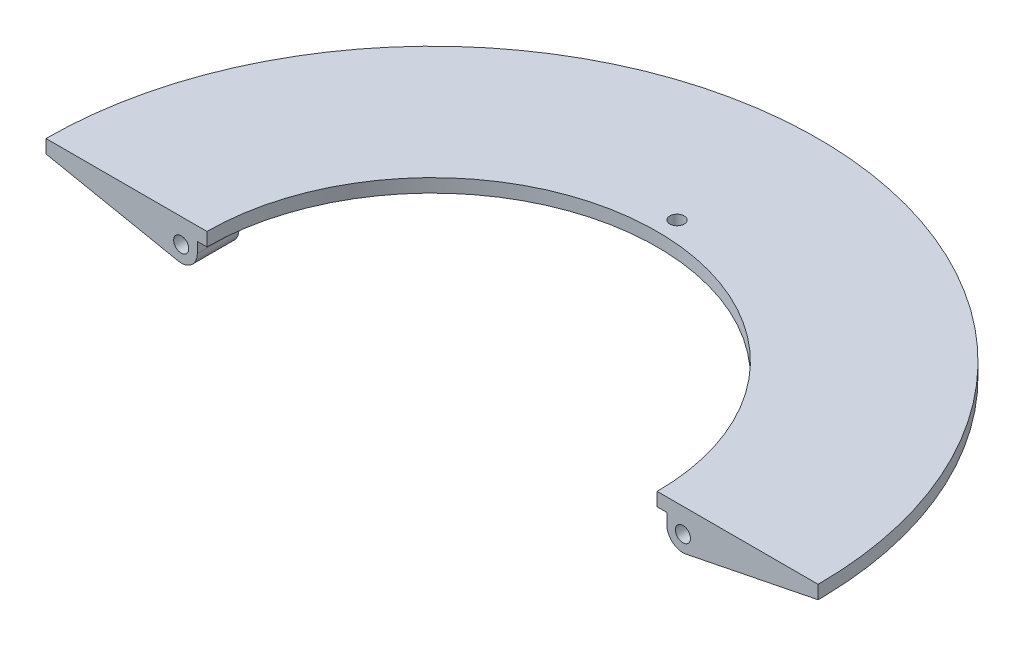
ISO-10303-21;
HEADER;
FILE_DESCRIPTION(('STEP AP214'),'2;1');
FILE_NAME('part.step','',(''),(''),'','','');
FILE_SCHEMA(('AUTOMOTIVE_DESIGN { 1 0 10303 214 1 1 1 1 }'));
ENDSEC;
DATA;
#1=APPLICATION_CONTEXT('core data for automotive mechanical design processes');
#2=APPLICATION_PROTOCOL_DEFINITION('international standard','automotive_design',2000,#1);
#3=PRODUCT_CONTEXT('',#1,'mechanical');
#4=PRODUCT('Part','Part','',(#3));
#5=PRODUCT_RELATED_PRODUCT_CATEGORY('part','',(#4));
#6=PRODUCT_DEFINITION_FORMATION('','',#4);
#7=PRODUCT_DEFINITION_CONTEXT('part definition',#1,'design');
#8=PRODUCT_DEFINITION('design','',#6,#7);
#9=PRODUCT_DEFINITION_SHAPE('','',#8);
#10=(LENGTH_UNIT() NAMED_UNIT(*) SI_UNIT(.MILLI.,.METRE.));
#11=(NAMED_UNIT(*) PLANE_ANGLE_UNIT() SI_UNIT($,.RADIAN.));
#12=(NAMED_UNIT(*) SI_UNIT($,.STERADIAN.) SOLID_ANGLE_UNIT());
#13=UNCERTAINTY_MEASURE_WITH_UNIT(LENGTH_MEASURE(1.E-05),#10,'distance_accuracy_value','');
#14=(GEOMETRIC_REPRESENTATION_CONTEXT(3) GLOBAL_UNCERTAINTY_ASSIGNED_CONTEXT((#13)) GLOBAL_UNIT_ASSIGNED_CONTEXT((#10,
#11,#12)) REPRESENTATION_CONTEXT('',''));
#15=CARTESIAN_POINT('',(0.,0.,0.));
#16=DIRECTION('',(0.,0.,1.));
#17=DIRECTION('',(1.,0.,0.));
#18=AXIS2_PLACEMENT_3D('',#15,#16,#17);
#19=CARTESIAN_POINT('',(-105.254491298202,98.1368286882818,-56.0874251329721));
#20=DIRECTION('',(0.,-1.,0.));
#21=DIRECTION('',(0.,0.,-1.));
#22=AXIS2_PLACEMENT_3D('',#19,#20,#21);
#23=CYLINDRICAL_SURFACE('',#22,6.35);
#24=DIRECTION('',(0.,1.,0.));
#25=VECTOR('',#24,1.);
#26=CARTESIAN_POINT('',(-103.018665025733,-5.08,-50.1440606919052));
#27=LINE('',#26,#25);
#28=CARTESIAN_POINT('',(-103.018665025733,-6.35,-50.1440606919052));
#29=VERTEX_POINT('',#28);
#30=CARTESIAN_POINT('',(-103.018665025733,-3.81000000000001,-50.1440606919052));
#31=VERTEX_POINT('',#30);
#32=EDGE_CURVE('E59',#29,#31,#27,.T.);
#33=ORIENTED_EDGE('',*,*,#32,.F.);
#34=CARTESIAN_POINT('',(-105.254491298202,-6.35,-56.0874251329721));
#35=DIRECTION('',(0.,-1.,0.));
#36=DIRECTION('',(0.382683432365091,0.,-0.923879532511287));
#37=AXIS2_PLACEMENT_3D('',#34,#35,#36);
#38=CIRCLE('',#37,6.35);
#39=CARTESIAN_POINT('',(-107.938117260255,-6.35,-50.3323706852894));
#40=VERTEX_POINT('',#39);
#41=EDGE_CURVE('E1097',#29,#40,#38,.T.);
#42=ORIENTED_EDGE('',*,*,#41,.T.);
#43=DIRECTION('',(0.,-1.,0.));
#44=VECTOR('',#43,1.);
#45=CARTESIAN_POINT('',(-107.938117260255,98.1368286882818,-50.3323706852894));
#46=LINE('',#45,#44);
#47=CARTESIAN_POINT('',(-107.938117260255,-3.81000000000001,-50.3323706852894));
#48=VERTEX_POINT('',#47);
#49=EDGE_CURVE('E1101',#48,#40,#46,.T.);
#50=ORIENTED_EDGE('',*,*,#49,.F.);
#51=CARTESIAN_POINT('',(-105.254491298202,-3.81000000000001,-56.0874251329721));
#52=DIRECTION('',(0.,1.,0.));
#53=DIRECTION('',(0.,0.,1.));
#54=AXIS2_PLACEMENT_3D('',#51,#52,#53);
#55=CIRCLE('',#54,6.35);
#56=EDGE_CURVE('E1081',#31,#48,#55,.F.);
#57=ORIENTED_EDGE('',*,*,#56,.F.);
#58=EDGE_LOOP('',(#33,#42,#50,#57));
#59=FACE_BOUND('',#58,.T.);
#60=ADVANCED_FACE('F37',(#59),#23,.F.);
#61=CARTESIAN_POINT('',(0.,98.1368286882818,0.));
#62=DIRECTION('',(0.,-1.,0.));
#63=DIRECTION('',(0.,0.,-1.));
#64=AXIS2_PLACEMENT_3D('',#61,#62,#63);
#65=CYLINDRICAL_SURFACE('',#64,112.9157);
#66=DIRECTION('',(0.,1.,0.));
#67=VECTOR('',#66,1.);
#68=CARTESIAN_POINT('',(-93.7851311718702,-5.08,-62.8832607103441));
#69=LINE('',#68,#67);
#70=CARTESIAN_POINT('',(-93.7851311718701,-3.81000000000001,-62.883260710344));
#71=VERTEX_POINT('',#70);
#72=CARTESIAN_POINT('',(-93.7851311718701,-6.35,-62.883260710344));
#73=VERTEX_POINT('',#72);
#74=EDGE_CURVE('E12',#71,#73,#69,.F.);
#75=ORIENTED_EDGE('',*,*,#74,.F.);
#76=CARTESIAN_POINT('',(0.,-3.81000000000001,0.));
#77=DIRECTION('',(0.,1.,0.));
#78=DIRECTION('',(0.,0.,1.));
#79=AXIS2_PLACEMENT_3D('',#76,#77,#78);
#80=CIRCLE('',#79,112.9157);
#81=CARTESIAN_POINT('',(-87.1936934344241,-3.81000000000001,-71.7440947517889));
#82=VERTEX_POINT('',#81);
#83=EDGE_CURVE('E1102',#82,#71,#80,.T.);
#84=ORIENTED_EDGE('',*,*,#83,.F.);
#85=DIRECTION('',(0.,-1.,0.));
#86=VECTOR('',#85,1.);
#87=CARTESIAN_POINT('',(-87.1936934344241,98.1368286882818,-71.7440947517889));
#88=LINE('',#87,#86);
#89=CARTESIAN_POINT('',(-87.1936934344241,-6.34999999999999,-71.7440947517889));
#90=VERTEX_POINT('',#89);
#91=EDGE_CURVE('E1105',#82,#90,#88,.T.);
#92=ORIENTED_EDGE('',*,*,#91,.T.);
#93=CARTESIAN_POINT('',(0.,-6.35,0.));
#94=DIRECTION('',(0.,1.,0.));
#95=DIRECTION('',(0.382683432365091,0.,-0.923879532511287));
#96=AXIS2_PLACEMENT_3D('',#93,#94,#95);
#97=CIRCLE('',#96,112.9157);
#98=EDGE_CURVE('E1078',#90,#73,#97,.T.);
#99=ORIENTED_EDGE('',*,*,#98,.T.);
#100=EDGE_LOOP('',(#75,#84,#92,#99));
#101=FACE_BOUND('',#100,.T.);
#102=ADVANCED_FACE('F1349',(#101),#65,.T.);
#103=CARTESIAN_POINT('',(105.254491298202,98.1368286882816,-56.0874251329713));
#104=DIRECTION('',(0.,-1.,0.));
#105=DIRECTION('',(0.,0.,-1.));
#106=AXIS2_PLACEMENT_3D('',#103,#104,#105);
#107=CYLINDRICAL_SURFACE('',#106,6.34999999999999);
#108=DIRECTION('',(0.,1.,0.));
#109=VECTOR('',#108,1.);
#110=CARTESIAN_POINT('',(103.018665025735,-5.08000000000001,-50.144060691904));
#111=LINE('',#110,#109);
#112=CARTESIAN_POINT('',(103.018665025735,-3.81000000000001,-50.144060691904));
#113=VERTEX_POINT('',#112);
#114=CARTESIAN_POINT('',(103.018665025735,-6.35,-50.144060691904));
#115=VERTEX_POINT('',#114);
#116=EDGE_CURVE('E595',#113,#115,#111,.F.);
#117=ORIENTED_EDGE('',*,*,#116,.F.);
#118=CARTESIAN_POINT('',(105.254491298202,-3.81000000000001,-56.0874251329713));
#119=DIRECTION('',(0.,1.,0.));
#120=DIRECTION('',(0.,0.,1.));
#121=AXIS2_PLACEMENT_3D('',#118,#119,#120);
#122=CIRCLE('',#121,6.34999999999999);
#123=CARTESIAN_POINT('',(107.938117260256,-3.81000000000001,-50.3323706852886));
#124=VERTEX_POINT('',#123);
#125=EDGE_CURVE('E800',#124,#113,#122,.F.);
#126=ORIENTED_EDGE('',*,*,#125,.F.);
#127=DIRECTION('',(0.,-1.,0.));
#128=VECTOR('',#127,1.);
#129=CARTESIAN_POINT('',(107.938117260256,98.1368286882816,-50.3323706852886));
#130=LINE('',#129,#128);
#131=CARTESIAN_POINT('',(107.938117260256,-6.35,-50.3323706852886));
#132=VERTEX_POINT('',#131);
#133=EDGE_CURVE('E803',#124,#132,#130,.T.);
#134=ORIENTED_EDGE('',*,*,#133,.T.);
#135=CARTESIAN_POINT('',(105.254491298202,-6.35,-56.0874251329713));
#136=DIRECTION('',(0.,-1.,0.));
#137=DIRECTION('',(0.707106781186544,0.,0.707106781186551));
#138=AXIS2_PLACEMENT_3D('',#135,#136,#137);
#139=CIRCLE('',#138,6.34999999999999);
#140=EDGE_CURVE('E776',#132,#115,#139,.T.);
#141=ORIENTED_EDGE('',*,*,#140,.T.);
#142=EDGE_LOOP('',(#117,#126,#134,#141));
#143=FACE_BOUND('',#142,.T.);
#144=ADVANCED_FACE('F1354',(#143),#107,.F.);
#145=CARTESIAN_POINT('',(0.,98.1368286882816,0.));
#146=DIRECTION('',(0.,-1.,0.));
#147=DIRECTION('',(0.,0.,-1.));
#148=AXIS2_PLACEMENT_3D('',#145,#146,#147);
#149=CYLINDRICAL_SURFACE('',#148,112.9157);
#150=DIRECTION('',(0.,1.,0.));
#151=VECTOR('',#150,1.);
#152=CARTESIAN_POINT('',(93.785131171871,-5.08000000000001,-62.8832607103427));
#153=LINE('',#152,#151);
#154=CARTESIAN_POINT('',(93.785131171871,-6.35,-62.8832607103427));
#155=VERTEX_POINT('',#154);
#156=CARTESIAN_POINT('',(93.785131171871,-3.81000000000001,-62.8832607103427));
#157=VERTEX_POINT('',#156);
#158=EDGE_CURVE('E45',#155,#157,#153,.T.);
#159=ORIENTED_EDGE('',*,*,#158,.F.);
#160=CARTESIAN_POINT('',(0.,-6.35,0.));
#161=DIRECTION('',(0.,1.,0.));
#162=DIRECTION('',(0.707106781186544,0.,0.707106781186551));
#163=AXIS2_PLACEMENT_3D('',#160,#161,#162);
#164=CIRCLE('',#163,112.9157);
#165=CARTESIAN_POINT('',(87.1936934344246,-6.35,-71.7440947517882));
#166=VERTEX_POINT('',#165);
#167=EDGE_CURVE('E571',#155,#166,#164,.T.);
#168=ORIENTED_EDGE('',*,*,#167,.T.);
#169=DIRECTION('',(0.,-1.,0.));
#170=VECTOR('',#169,1.);
#171=CARTESIAN_POINT('',(87.1936934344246,98.1368286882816,-71.7440947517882));
#172=LINE('',#171,#170);
#173=CARTESIAN_POINT('',(87.1936934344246,-3.81000000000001,-71.7440947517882));
#174=VERTEX_POINT('',#173);
#175=EDGE_CURVE('E799',#174,#166,#172,.T.);
#176=ORIENTED_EDGE('',*,*,#175,.F.);
#177=CARTESIAN_POINT('',(0.,-3.81000000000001,0.));
#178=DIRECTION('',(0.,1.,0.));
#179=DIRECTION('',(0.,0.,1.));
#180=AXIS2_PLACEMENT_3D('',#177,#178,#179);
#181=CIRCLE('',#180,112.9157);
#182=EDGE_CURVE('E589',#157,#174,#181,.T.);
#183=ORIENTED_EDGE('',*,*,#182,.F.);
#184=EDGE_LOOP('',(#159,#168,#176,#183));
#185=FACE_BOUND('',#184,.T.);
#186=ADVANCED_FACE('F588',(#185),#149,.T.);
#187=CARTESIAN_POINT('',(182.7657,-6.35,1.2762460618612E-12));
#188=DIRECTION('',(0.,-1.,0.));
#189=DIRECTION('',(0.,0.,-1.));
#190=AXIS2_PLACEMENT_3D('',#187,#188,#189);
#191=PLANE('',#190);
#192=CARTESIAN_POINT('',(0.,-6.35,-115.9637));
#193=DIRECTION('',(0.,-1.,0.));
#194=DIRECTION('',(0.,0.,-1.));
#195=AXIS2_PLACEMENT_3D('',#192,#193,#194);
#196=CIRCLE('',#195,3.373501);
#197=CARTESIAN_POINT('',(0.,-6.35,-119.337201));
#198=VERTEX_POINT('',#197);
#199=EDGE_CURVE('E650',#198,#198,#196,.T.);
#200=ORIENTED_EDGE('',*,*,#199,.F.);
#201=EDGE_LOOP('',(#200));
#202=FACE_BOUND('',#201,.T.);
#203=CARTESIAN_POINT('',(0.,-6.35,-115.9637));
#204=DIRECTION('',(0.,-1.,0.));
#205=DIRECTION('',(0.,0.,-1.));
#206=AXIS2_PLACEMENT_3D('',#203,#204,#205);
#207=CIRCLE('',#206,8.255);
#208=CARTESIAN_POINT('',(5.33801204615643,-6.35,-122.260576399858));
#209=VERTEX_POINT('',#208);
#210=CARTESIAN_POINT('',(7.8831652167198,-6.35,-113.514061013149));
#211=VERTEX_POINT('',#210);
#212=EDGE_CURVE('E661',#209,#211,#207,.T.);
#213=ORIENTED_EDGE('',*,*,#212,.T.);
#214=CARTESIAN_POINT('',(11.538874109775,-6.35,-118.706198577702));
#215=DIRECTION('',(0.,-1.,0.));
#216=DIRECTION('',(1.,0.,0.));
#217=AXIS2_PLACEMENT_3D('',#214,#215,#216);
#218=CIRCLE('',#217,6.35);
#219=CARTESIAN_POINT('',(10.9245159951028,-6.35,-112.385987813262));
#220=VERTEX_POINT('',#219);
#221=EDGE_CURVE('E912',#220,#211,#218,.T.);
#222=ORIENTED_EDGE('',*,*,#221,.F.);
#223=CARTESIAN_POINT('',(0.,-6.35,0.));
#224=DIRECTION('',(0.,1.,0.));
#225=DIRECTION('',(1.,0.,0.));
#226=AXIS2_PLACEMENT_3D('',#223,#224,#225);
#227=CIRCLE('',#226,112.9157);
#228=CARTESIAN_POINT('',(32.9153188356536,-6.34999999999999,-108.011745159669));
#229=VERTEX_POINT('',#228);
#230=EDGE_CURVE('E894',#229,#220,#227,.T.);
#231=ORIENTED_EDGE('',*,*,#230,.F.);
#232=CARTESIAN_POINT('',(34.7663658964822,-6.35,-114.085963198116));
#233=DIRECTION('',(0.,-1.,0.));
#234=DIRECTION('',(1.,0.,0.));
#235=AXIS2_PLACEMENT_3D('',#232,#233,#234);
#236=CIRCLE('',#235,6.34999999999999);
#237=CARTESIAN_POINT('',(40.7334140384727,-6.35,-111.914135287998));
#238=VERTEX_POINT('',#237);
#239=EDGE_CURVE('E895',#238,#229,#236,.T.);
#240=ORIENTED_EDGE('',*,*,#239,.F.);
#241=DIRECTION('',(-0.342020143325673,0.,0.939692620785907));
#242=VECTOR('',#241,1.);
#243=CARTESIAN_POINT('',(40.7334140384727,-6.35,-111.914135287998));
#244=LINE('',#243,#242);
#245=CARTESIAN_POINT('',(58.1253345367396,-6.35,-159.698044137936));
#246=VERTEX_POINT('',#245);
#247=EDGE_CURVE('E898',#246,#238,#244,.T.);
#248=ORIENTED_EDGE('',*,*,#247,.F.);
#249=CARTESIAN_POINT('',(52.1582863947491,-6.35,-161.869872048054));
#250=DIRECTION('',(0.,-1.,0.));
#251=DIRECTION('',(-1.,0.,0.));
#252=AXIS2_PLACEMENT_3D('',#249,#250,#251);
#253=CIRCLE('',#252,6.34999999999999);
#254=CARTESIAN_POINT('',(54.1057991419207,-6.35,-167.913852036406));
#255=VERTEX_POINT('',#254);
#256=EDGE_CURVE('E901',#255,#246,#253,.T.);
#257=ORIENTED_EDGE('',*,*,#256,.F.);
#258=CARTESIAN_POINT('',(0.,-6.35,0.));
#259=DIRECTION('',(0.,-1.,0.));
#260=DIRECTION('',(1.,0.,0.));
#261=AXIS2_PLACEMENT_3D('',#258,#259,#260);
#262=CIRCLE('',#261,176.4157);
#263=CARTESIAN_POINT('',(14.2706088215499,-6.35,-175.837564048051));
#264=VERTEX_POINT('',#263);
#265=EDGE_CURVE('E904',#264,#255,#262,.T.);
#266=ORIENTED_EDGE('',*,*,#265,.F.);
#267=CARTESIAN_POINT('',(13.7569449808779,-6.35,-169.508373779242));
#268=DIRECTION('',(0.,-1.,0.));
#269=DIRECTION('',(1.,0.,0.));
#270=AXIS2_PLACEMENT_3D('',#267,#268,#269);
#271=CIRCLE('',#270,6.35000000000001);
#272=CARTESIAN_POINT('',(7.4129887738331,-6.35,-169.785356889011));
#273=VERTEX_POINT('',#272);
#274=EDGE_CURVE('E907',#273,#264,#271,.T.);
#275=ORIENTED_EDGE('',*,*,#274,.F.);
#276=DIRECTION('',(0.0436193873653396,0.,-0.999048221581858));
#277=VECTOR('',#276,1.);
#278=CARTESIAN_POINT('',(5.19491790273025,-6.35,-118.983181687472));
#279=LINE('',#278,#277);
#280=EDGE_CURVE('E910',#209,#273,#279,.T.);
#281=ORIENTED_EDGE('',*,*,#280,.F.);
#282=EDGE_LOOP('',(#213,#222,#231,#240,#248,#257,#266,#275,#281));
#283=FACE_BOUND('',#282,.T.);
#284=ORIENTED_EDGE('',*,*,#167,.F.);
#285=CARTESIAN_POINT('',(100.427510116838,-6.35,-57.9818499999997));
#286=DIRECTION('',(0.,-1.,0.));
#287=DIRECTION('',(0.,0.,-1.));
#288=AXIS2_PLACEMENT_3D('',#285,#286,#287);
#289=CIRCLE('',#288,8.255);
#290=EDGE_CURVE('E577',#155,#115,#289,.T.);
#291=ORIENTED_EDGE('',*,*,#290,.T.);
#292=ORIENTED_EDGE('',*,*,#140,.F.);
#293=DIRECTION('',(-0.906307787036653,0.,0.422618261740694));
#294=VECTOR('',#293,1.);
#295=CARTESIAN_POINT('',(107.938117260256,-6.35,-50.3323706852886));
#296=LINE('',#295,#294);
#297=CARTESIAN_POINT('',(154.024388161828,-6.35,-71.8227517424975));
#298=VERTEX_POINT('',#297);
#299=EDGE_CURVE('E779',#298,#132,#296,.T.);
#300=ORIENTED_EDGE('',*,*,#299,.F.);
#301=CARTESIAN_POINT('',(151.340762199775,-6.35,-77.5778061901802));
#302=DIRECTION('',(0.,-1.,0.));
#303=DIRECTION('',(-0.707106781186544,0.,-0.707106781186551));
#304=AXIS2_PLACEMENT_3D('',#301,#302,#303);
#305=CIRCLE('',#304,6.34999999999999);
#306=CARTESIAN_POINT('',(156.991600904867,-6.35,-80.4744459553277));
#307=VERTEX_POINT('',#306);
#308=EDGE_CURVE('E782',#307,#298,#305,.T.);
#309=ORIENTED_EDGE('',*,*,#308,.F.);
#310=CARTESIAN_POINT('',(0.,-6.35,0.));
#311=DIRECTION('',(0.,-1.,0.));
#312=DIRECTION('',(0.707106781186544,0.,0.707106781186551));
#313=AXIS2_PLACEMENT_3D('',#310,#311,#312);
#314=CIRCLE('',#313,176.4157);
#315=CARTESIAN_POINT('',(134.426778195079,-6.35,-114.245089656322));
#316=VERTEX_POINT('',#315);
#317=EDGE_CURVE('E785',#316,#307,#314,.T.);
#318=ORIENTED_EDGE('',*,*,#317,.F.);
#319=CARTESIAN_POINT('',(129.588149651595,-6.35,-110.132891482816));
#320=DIRECTION('',(0.,-1.,0.));
#321=DIRECTION('',(0.707106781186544,0.,0.707106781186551));
#322=AXIS2_PLACEMENT_3D('',#319,#320,#321);
#323=CIRCLE('',#322,6.35000000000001);
#324=CARTESIAN_POINT('',(125.298151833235,-6.35,-114.814602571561));
#325=VERTEX_POINT('',#324);
#326=EDGE_CURVE('E788',#325,#316,#323,.T.);
#327=ORIENTED_EDGE('',*,*,#326,.F.);
#328=DIRECTION('',(0.737277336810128,0.,-0.675590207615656));
#329=VECTOR('',#328,1.);
#330=CARTESIAN_POINT('',(87.8071762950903,-6.35,-80.4604529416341));
#331=LINE('',#330,#329);
#332=CARTESIAN_POINT('',(87.8071762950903,-6.35,-80.4604529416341));
#333=VERTEX_POINT('',#332);
#334=EDGE_CURVE('E791',#333,#325,#331,.T.);
#335=ORIENTED_EDGE('',*,*,#334,.F.);
#336=CARTESIAN_POINT('',(92.0971741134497,-6.35,-75.7787418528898));
#337=DIRECTION('',(0.,-1.,0.));
#338=DIRECTION('',(0.707106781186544,0.,0.707106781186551));
#339=AXIS2_PLACEMENT_3D('',#336,#337,#338);
#340=CIRCLE('',#339,6.35);
#341=EDGE_CURVE('E580',#166,#333,#340,.T.);
#342=ORIENTED_EDGE('',*,*,#341,.F.);
#343=EDGE_LOOP('',(#284,#291,#292,#300,#309,#318,#327,#335,#342));
#344=FACE_BOUND('',#343,.T.);
#345=CARTESIAN_POINT('',(-11.5388741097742,-6.35,-118.706198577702));
#346=DIRECTION('',(0.,-1.,0.));
#347=DIRECTION('',(0.923879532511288,0.,-0.382683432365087));
#348=AXIS2_PLACEMENT_3D('',#345,#346,#347);
#349=CIRCLE('',#348,6.34999999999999);
#350=CARTESIAN_POINT('',(-7.88316521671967,-6.35,-113.514061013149));
#351=VERTEX_POINT('',#350);
#352=CARTESIAN_POINT('',(-10.9245159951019,-6.34999999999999,-112.385987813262));
#353=VERTEX_POINT('',#352);
#354=EDGE_CURVE('E955',#351,#353,#349,.T.);
#355=ORIENTED_EDGE('',*,*,#354,.F.);
#356=CARTESIAN_POINT('',(-5.33801204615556,-6.35,-122.260576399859));
#357=VERTEX_POINT('',#356);
#358=EDGE_CURVE('E660',#351,#357,#207,.T.);
#359=ORIENTED_EDGE('',*,*,#358,.T.);
#360=DIRECTION('',(0.0436193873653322,0.,0.999048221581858));
#361=VECTOR('',#360,1.);
#362=CARTESIAN_POINT('',(-5.19491790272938,-6.35,-118.983181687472));
#363=LINE('',#362,#361);
#364=CARTESIAN_POINT('',(-7.41298877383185,-6.35,-169.785356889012));
#365=VERTEX_POINT('',#364);
#366=EDGE_CURVE('E958',#365,#357,#363,.T.);
#367=ORIENTED_EDGE('',*,*,#366,.F.);
#368=CARTESIAN_POINT('',(-13.7569449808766,-6.35,-169.508373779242));
#369=DIRECTION('',(0.,-1.,0.));
#370=DIRECTION('',(-0.923879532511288,0.,0.382683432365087));
#371=AXIS2_PLACEMENT_3D('',#368,#369,#370);
#372=CIRCLE('',#371,6.34999999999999);
#373=CARTESIAN_POINT('',(-14.2706088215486,-6.35,-175.837564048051));
#374=VERTEX_POINT('',#373);
#375=EDGE_CURVE('E960',#374,#365,#372,.T.);
#376=ORIENTED_EDGE('',*,*,#375,.F.);
#377=CARTESIAN_POINT('',(0.,-6.35,0.));
#378=DIRECTION('',(0.,-1.,0.));
#379=DIRECTION('',(0.923879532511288,0.,-0.382683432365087));
#380=AXIS2_PLACEMENT_3D('',#377,#378,#379);
#381=CIRCLE('',#380,176.4157);
#382=CARTESIAN_POINT('',(-54.1057991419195,-6.35,-167.913852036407));
#383=VERTEX_POINT('',#382);
#384=EDGE_CURVE('E963',#383,#374,#381,.T.);
#385=ORIENTED_EDGE('',*,*,#384,.F.);
#386=CARTESIAN_POINT('',(-52.1582863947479,-6.35,-161.869872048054));
#387=DIRECTION('',(0.,-1.,0.));
#388=DIRECTION('',(0.923879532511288,0.,-0.382683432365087));
#389=AXIS2_PLACEMENT_3D('',#386,#387,#388);
#390=CIRCLE('',#389,6.35000000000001);
#391=CARTESIAN_POINT('',(-58.1253345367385,-6.35,-159.698044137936));
#392=VERTEX_POINT('',#391);
#393=EDGE_CURVE('E966',#392,#383,#390,.T.);
#394=ORIENTED_EDGE('',*,*,#393,.F.);
#395=DIRECTION('',(-0.342020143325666,0.,-0.939692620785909));
#396=VECTOR('',#395,1.);
#397=CARTESIAN_POINT('',(-40.7334140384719,-6.35,-111.914135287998));
#398=LINE('',#397,#396);
#399=CARTESIAN_POINT('',(-40.7334140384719,-6.35,-111.914135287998));
#400=VERTEX_POINT('',#399);
#401=EDGE_CURVE('E969',#400,#392,#398,.T.);
#402=ORIENTED_EDGE('',*,*,#401,.F.);
#403=CARTESIAN_POINT('',(-34.7663658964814,-6.35,-114.085963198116));
#404=DIRECTION('',(0.,-1.,0.));
#405=DIRECTION('',(0.923879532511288,0.,-0.382683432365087));
#406=AXIS2_PLACEMENT_3D('',#403,#404,#405);
#407=CIRCLE('',#406,6.35);
#408=CARTESIAN_POINT('',(-32.9153188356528,-6.35,-108.011745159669));
#409=VERTEX_POINT('',#408);
#410=EDGE_CURVE('E972',#409,#400,#407,.T.);
#411=ORIENTED_EDGE('',*,*,#410,.F.);
#412=CARTESIAN_POINT('',(0.,-6.35,0.));
#413=DIRECTION('',(0.,1.,0.));
#414=DIRECTION('',(0.923879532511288,0.,-0.382683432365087));
#415=AXIS2_PLACEMENT_3D('',#412,#413,#414);
#416=CIRCLE('',#415,112.9157);
#417=EDGE_CURVE('E954',#353,#409,#416,.T.);
#418=ORIENTED_EDGE('',*,*,#417,.F.);
#419=EDGE_LOOP('',(#355,#359,#367,#376,#385,#394,#402,#411,#418));
#420=FACE_BOUND('',#419,.T.);
#421=CARTESIAN_POINT('',(-75.7787418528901,-6.35,-92.0971741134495));
#422=DIRECTION('',(0.,-1.,0.));
#423=DIRECTION('',(0.707106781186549,0.,-0.707106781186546));
#424=AXIS2_PLACEMENT_3D('',#421,#422,#423);
#425=CIRCLE('',#424,6.35);
#426=CARTESIAN_POINT('',(-71.7440947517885,-6.35,-87.1936934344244));
#427=VERTEX_POINT('',#426);
#428=CARTESIAN_POINT('',(-80.4604529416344,-6.35,-87.80717629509));
#429=VERTEX_POINT('',#428);
#430=EDGE_CURVE('E1033',#427,#429,#425,.T.);
#431=ORIENTED_EDGE('',*,*,#430,.F.);
#432=CARTESIAN_POINT('',(0.,-6.35,0.));
#433=DIRECTION('',(0.,1.,0.));
#434=DIRECTION('',(0.707106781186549,0.,-0.707106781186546));
#435=AXIS2_PLACEMENT_3D('',#432,#433,#434);
#436=CIRCLE('',#435,112.9157);
#437=CARTESIAN_POINT('',(-53.1011922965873,-6.34999999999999,-99.650482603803));
#438=VERTEX_POINT('',#437);
#439=EDGE_CURVE('E1014',#438,#427,#436,.T.);
#440=ORIENTED_EDGE('',*,*,#439,.F.);
#441=CARTESIAN_POINT('',(-56.0874251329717,-6.35,-105.254491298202));
#442=DIRECTION('',(0.,-1.,0.));
#443=DIRECTION('',(0.707106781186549,0.,-0.707106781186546));
#444=AXIS2_PLACEMENT_3D('',#441,#442,#443);
#445=CIRCLE('',#444,6.34999999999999);
#446=CARTESIAN_POINT('',(-50.332370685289,-6.35,-107.938117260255));
#447=VERTEX_POINT('',#446);
#448=EDGE_CURVE('E1015',#447,#438,#445,.T.);
#449=ORIENTED_EDGE('',*,*,#448,.F.);
#450=DIRECTION('',(0.422618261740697,0.,0.906307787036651));
#451=VECTOR('',#450,1.);
#452=CARTESIAN_POINT('',(-50.332370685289,-6.35,-107.938117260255));
#453=LINE('',#452,#451);
#454=CARTESIAN_POINT('',(-71.822751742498,-6.35,-154.024388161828));
#455=VERTEX_POINT('',#454);
#456=EDGE_CURVE('E1018',#455,#447,#453,.T.);
#457=ORIENTED_EDGE('',*,*,#456,.F.);
#458=CARTESIAN_POINT('',(-77.5778061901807,-6.35,-151.340762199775));
#459=DIRECTION('',(0.,-1.,0.));
#460=DIRECTION('',(-0.707106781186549,0.,0.707106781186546));
#461=AXIS2_PLACEMENT_3D('',#458,#459,#460);
#462=CIRCLE('',#461,6.34999999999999);
#463=CARTESIAN_POINT('',(-80.4744459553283,-6.35,-156.991600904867));
#464=VERTEX_POINT('',#463);
#465=EDGE_CURVE('E1021',#464,#455,#462,.T.);
#466=ORIENTED_EDGE('',*,*,#465,.F.);
#467=CARTESIAN_POINT('',(0.,-6.35,0.));
#468=DIRECTION('',(0.,-1.,0.));
#469=DIRECTION('',(0.707106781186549,0.,-0.707106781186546));
#470=AXIS2_PLACEMENT_3D('',#467,#468,#469);
#471=CIRCLE('',#470,176.4157);
#472=CARTESIAN_POINT('',(-114.245089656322,-6.35,-134.426778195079));
#473=VERTEX_POINT('',#472);
#474=EDGE_CURVE('E1024',#473,#464,#471,.T.);
#475=ORIENTED_EDGE('',*,*,#474,.F.);
#476=CARTESIAN_POINT('',(-110.132891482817,-6.35,-129.588149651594));
#477=DIRECTION('',(0.,-1.,0.));
#478=DIRECTION('',(0.707106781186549,0.,-0.707106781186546));
#479=AXIS2_PLACEMENT_3D('',#476,#477,#478);
#480=CIRCLE('',#479,6.35000000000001);
#481=CARTESIAN_POINT('',(-114.814602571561,-6.35,-125.298151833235));
#482=VERTEX_POINT('',#481);
#483=EDGE_CURVE('E1027',#482,#473,#480,.T.);
#484=ORIENTED_EDGE('',*,*,#483,.F.);
#485=DIRECTION('',(-0.675590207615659,0.,-0.737277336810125));
#486=VECTOR('',#485,1.);
#487=CARTESIAN_POINT('',(-80.4604529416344,-6.35,-87.80717629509));
#488=LINE('',#487,#486);
#489=EDGE_CURVE('E1030',#429,#482,#488,.T.);
#490=ORIENTED_EDGE('',*,*,#489,.F.);
#491=EDGE_LOOP('',(#431,#440,#449,#457,#466,#475,#484,#490));
#492=FACE_BOUND('',#491,.T.);
#493=ORIENTED_EDGE('',*,*,#41,.F.);
#494=CARTESIAN_POINT('',(-100.427510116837,-6.35,-57.9818500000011));
#495=DIRECTION('',(0.,-1.,0.));
#496=DIRECTION('',(0.,0.,-1.));
#497=AXIS2_PLACEMENT_3D('',#494,#495,#496);
#498=CIRCLE('',#497,8.255);
#499=EDGE_CURVE('E1617',#29,#73,#498,.T.);
#500=ORIENTED_EDGE('',*,*,#499,.T.);
#501=ORIENTED_EDGE('',*,*,#98,.F.);
#502=CARTESIAN_POINT('',(-92.0971741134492,-6.35,-75.7787418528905));
#503=DIRECTION('',(0.,-1.,0.));
#504=DIRECTION('',(0.382683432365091,0.,-0.923879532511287));
#505=AXIS2_PLACEMENT_3D('',#502,#503,#504);
#506=CIRCLE('',#505,6.34999999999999);
#507=CARTESIAN_POINT('',(-87.8071762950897,-6.35,-80.4604529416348));
#508=VERTEX_POINT('',#507);
#509=EDGE_CURVE('E1079',#508,#90,#506,.T.);
#510=ORIENTED_EDGE('',*,*,#509,.F.);
#511=DIRECTION('',(0.737277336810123,0.,0.675590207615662));
#512=VECTOR('',#511,1.);
#513=CARTESIAN_POINT('',(-87.8071762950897,-6.35,-80.4604529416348));
#514=LINE('',#513,#512);
#515=CARTESIAN_POINT('',(-125.298151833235,-6.35,-114.814602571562));
#516=VERTEX_POINT('',#515);
#517=EDGE_CURVE('E1082',#516,#508,#514,.T.);
#518=ORIENTED_EDGE('',*,*,#517,.F.);
#519=CARTESIAN_POINT('',(-129.588149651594,-6.35,-110.132891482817));
#520=DIRECTION('',(0.,-1.,0.));
#521=DIRECTION('',(-0.382683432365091,0.,0.923879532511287));
#522=AXIS2_PLACEMENT_3D('',#519,#520,#521);
#523=CIRCLE('',#522,6.34999999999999);
#524=CARTESIAN_POINT('',(-134.426778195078,-6.35,-114.245089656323));
#525=VERTEX_POINT('',#524);
#526=EDGE_CURVE('E1085',#525,#516,#523,.T.);
#527=ORIENTED_EDGE('',*,*,#526,.F.);
#528=CARTESIAN_POINT('',(0.,-6.35,0.));
#529=DIRECTION('',(0.,-1.,0.));
#530=DIRECTION('',(0.382683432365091,0.,-0.923879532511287));
#531=AXIS2_PLACEMENT_3D('',#528,#529,#530);
#532=CIRCLE('',#531,176.4157);
#533=CARTESIAN_POINT('',(-156.991600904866,-6.35,-80.4744459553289));
#534=VERTEX_POINT('',#533);
#535=EDGE_CURVE('E1088',#534,#525,#532,.T.);
#536=ORIENTED_EDGE('',*,*,#535,.F.);
#537=CARTESIAN_POINT('',(-151.340762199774,-6.35,-77.5778061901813));
#538=DIRECTION('',(0.,-1.,0.));
#539=DIRECTION('',(0.382683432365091,0.,-0.923879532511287));
#540=AXIS2_PLACEMENT_3D('',#537,#538,#539);
#541=CIRCLE('',#540,6.35000000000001);
#542=CARTESIAN_POINT('',(-154.024388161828,-6.35,-71.8227517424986));
#543=VERTEX_POINT('',#542);
#544=EDGE_CURVE('E1091',#543,#534,#541,.T.);
#545=ORIENTED_EDGE('',*,*,#544,.F.);
#546=DIRECTION('',(-0.90630778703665,0.,-0.4226182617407));
#547=VECTOR('',#546,1.);
#548=CARTESIAN_POINT('',(-107.938117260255,-6.35,-50.3323706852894));
#549=LINE('',#548,#547);
#550=EDGE_CURVE('E1094',#40,#543,#549,.T.);
#551=ORIENTED_EDGE('',*,*,#550,.F.);
#552=EDGE_LOOP('',(#493,#500,#501,#510,#518,#527,#536,#545,#551));
#553=FACE_BOUND('',#552,.T.);
#554=CARTESIAN_POINT('',(56.0874251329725,-6.35,-105.254491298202));
#555=DIRECTION('',(0.,-1.,0.));
#556=DIRECTION('',(0.923879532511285,0.,0.382683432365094));
#557=AXIS2_PLACEMENT_3D('',#554,#555,#556);
#558=CIRCLE('',#557,6.35);
#559=CARTESIAN_POINT('',(53.1011922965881,-6.35,-99.6504826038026));
#560=VERTEX_POINT('',#559);
#561=CARTESIAN_POINT('',(50.3323706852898,-6.35,-107.938117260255));
#562=VERTEX_POINT('',#561);
#563=EDGE_CURVE('E849',#560,#562,#558,.T.);
#564=ORIENTED_EDGE('',*,*,#563,.F.);
#565=CARTESIAN_POINT('',(0.,-6.35,0.));
#566=DIRECTION('',(0.,1.,0.));
#567=DIRECTION('',(0.923879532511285,0.,0.382683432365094));
#568=AXIS2_PLACEMENT_3D('',#565,#566,#567);
#569=CIRCLE('',#568,112.9157);
#570=CARTESIAN_POINT('',(71.7440947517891,-6.34999999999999,-87.1936934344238));
#571=VERTEX_POINT('',#570);
#572=EDGE_CURVE('E830',#571,#560,#569,.T.);
#573=ORIENTED_EDGE('',*,*,#572,.F.);
#574=CARTESIAN_POINT('',(75.7787418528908,-6.35,-92.0971741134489));
#575=DIRECTION('',(0.,-1.,0.));
#576=DIRECTION('',(0.923879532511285,0.,0.382683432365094));
#577=AXIS2_PLACEMENT_3D('',#574,#575,#576);
#578=CIRCLE('',#577,6.34999999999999);
#579=CARTESIAN_POINT('',(80.4604529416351,-6.35,-87.8071762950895));
#580=VERTEX_POINT('',#579);
#581=EDGE_CURVE('E831',#580,#571,#578,.T.);
#582=ORIENTED_EDGE('',*,*,#581,.F.);
#583=DIRECTION('',(-0.675590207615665,0.,0.73727733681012));
#584=VECTOR('',#583,1.);
#585=CARTESIAN_POINT('',(80.4604529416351,-6.35,-87.8071762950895));
#586=LINE('',#585,#584);
#587=CARTESIAN_POINT('',(114.814602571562,-6.35,-125.298151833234));
#588=VERTEX_POINT('',#587);
#589=EDGE_CURVE('E834',#588,#580,#586,.T.);
#590=ORIENTED_EDGE('',*,*,#589,.F.);
#591=CARTESIAN_POINT('',(110.132891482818,-6.35,-129.588149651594));
#592=DIRECTION('',(0.,-1.,0.));
#593=DIRECTION('',(-0.923879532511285,0.,-0.382683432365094));
#594=AXIS2_PLACEMENT_3D('',#591,#592,#593);
#595=CIRCLE('',#594,6.34999999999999);
#596=CARTESIAN_POINT('',(114.245089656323,-6.35,-134.426778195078));
#597=VERTEX_POINT('',#596);
#598=EDGE_CURVE('E837',#597,#588,#595,.T.);
#599=ORIENTED_EDGE('',*,*,#598,.F.);
#600=CARTESIAN_POINT('',(0.,-6.35,0.));
#601=DIRECTION('',(0.,-1.,0.));
#602=DIRECTION('',(0.923879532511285,0.,0.382683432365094));
#603=AXIS2_PLACEMENT_3D('',#600,#601,#602);
#604=CIRCLE('',#603,176.4157);
#605=CARTESIAN_POINT('',(80.4744459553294,-6.35,-156.991600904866));
#606=VERTEX_POINT('',#605);
#607=EDGE_CURVE('E840',#606,#597,#604,.T.);
#608=ORIENTED_EDGE('',*,*,#607,.F.);
#609=CARTESIAN_POINT('',(77.5778061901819,-6.35,-151.340762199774));
#610=DIRECTION('',(0.,-1.,0.));
#611=DIRECTION('',(0.923879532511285,0.,0.382683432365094));
#612=AXIS2_PLACEMENT_3D('',#609,#610,#611);
#613=CIRCLE('',#612,6.35000000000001);
#614=CARTESIAN_POINT('',(71.8227517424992,-6.35,-154.024388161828));
#615=VERTEX_POINT('',#614);
#616=EDGE_CURVE('E843',#615,#606,#613,.T.);
#617=ORIENTED_EDGE('',*,*,#616,.F.);
#618=DIRECTION('',(0.422618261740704,0.,-0.906307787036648));
#619=VECTOR('',#618,1.);
#620=CARTESIAN_POINT('',(50.3323706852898,-6.35,-107.938117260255));
#621=LINE('',#620,#619);
#622=EDGE_CURVE('E846',#562,#615,#621,.T.);
#623=ORIENTED_EDGE('',*,*,#622,.F.);
#624=EDGE_LOOP('',(#564,#573,#582,#590,#599,#608,#617,#623));
#625=FACE_BOUND('',#624,.T.);
#626=DIRECTION('',(1.,0.,0.));
#627=VECTOR('',#626,1.);
#628=CARTESIAN_POINT('',(182.7657,-6.35,-3.81));
#629=LINE('',#628,#627);
#630=CARTESIAN_POINT('',(126.441848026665,-6.35,-3.81));
#631=VERTEX_POINT('',#630);
#632=CARTESIAN_POINT('',(182.725983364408,-6.35,-3.81));
#633=VERTEX_POINT('',#632);
#634=EDGE_CURVE('E603',#631,#633,#629,.T.);
#635=ORIENTED_EDGE('',*,*,#634,.F.);
#636=DIRECTION('',(0.,0.,1.));
#637=VECTOR('',#636,1.);
#638=CARTESIAN_POINT('',(126.441848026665,-6.35,-3.81));
#639=LINE('',#638,#637);
#640=CARTESIAN_POINT('',(126.441848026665,-6.35,-5.52057030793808));
#641=VERTEX_POINT('',#640);
#642=EDGE_CURVE('E1243',#631,#641,#639,.F.);
#643=ORIENTED_EDGE('',*,*,#642,.T.);
#644=DIRECTION('',(-0.999048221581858,0.,0.0436193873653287));
#645=VECTOR('',#644,1.);
#646=CARTESIAN_POINT('',(118.983181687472,-6.35,-5.19491790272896));
#647=LINE('',#646,#645);
#648=CARTESIAN_POINT('',(169.785356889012,-6.35,-7.41298877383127));
#649=VERTEX_POINT('',#648);
#650=EDGE_CURVE('E725',#649,#641,#647,.T.);
#651=ORIENTED_EDGE('',*,*,#650,.F.);
#652=CARTESIAN_POINT('',(169.508373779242,-6.35,-13.7569449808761));
#653=DIRECTION('',(0.,-1.,0.));
#654=DIRECTION('',(-0.382683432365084,0.,-0.923879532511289));
#655=AXIS2_PLACEMENT_3D('',#652,#653,#654);
#656=CIRCLE('',#655,6.34999999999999);
#657=CARTESIAN_POINT('',(175.837564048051,-6.35,-14.270608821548));
#658=VERTEX_POINT('',#657);
#659=EDGE_CURVE('E729',#658,#649,#656,.T.);
#660=ORIENTED_EDGE('',*,*,#659,.F.);
#661=CARTESIAN_POINT('',(0.,-6.35,0.));
#662=DIRECTION('',(0.,-1.,0.));
#663=DIRECTION('',(0.382683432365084,0.,0.923879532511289));
#664=AXIS2_PLACEMENT_3D('',#661,#662,#663);
#665=CIRCLE('',#664,176.4157);
#666=CARTESIAN_POINT('',(167.913852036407,-6.35,-54.1057991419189));
#667=VERTEX_POINT('',#666);
#668=EDGE_CURVE('E732',#667,#658,#665,.T.);
#669=ORIENTED_EDGE('',*,*,#668,.F.);
#670=CARTESIAN_POINT('',(161.869872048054,-6.35,-52.1582863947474));
#671=DIRECTION('',(0.,-1.,0.));
#672=DIRECTION('',(0.382683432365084,0.,0.923879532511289));
#673=AXIS2_PLACEMENT_3D('',#670,#671,#672);
#674=CIRCLE('',#673,6.35000000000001);
#675=CARTESIAN_POINT('',(159.698044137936,-6.35,-58.1253345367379));
#676=VERTEX_POINT('',#675);
#677=EDGE_CURVE('E735',#676,#667,#674,.T.);
#678=ORIENTED_EDGE('',*,*,#677,.F.);
#679=DIRECTION('',(0.93969262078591,0.,-0.342020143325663));
#680=VECTOR('',#679,1.);
#681=CARTESIAN_POINT('',(111.914135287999,-6.35,-40.7334140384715));
#682=LINE('',#681,#680);
#683=CARTESIAN_POINT('',(111.914135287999,-6.35,-40.7334140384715));
#684=VERTEX_POINT('',#683);
#685=EDGE_CURVE('E738',#684,#676,#682,.T.);
#686=ORIENTED_EDGE('',*,*,#685,.F.);
#687=CARTESIAN_POINT('',(114.085963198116,-6.35,-34.766365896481));
#688=DIRECTION('',(0.,-1.,0.));
#689=DIRECTION('',(0.382683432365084,0.,0.923879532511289));
#690=AXIS2_PLACEMENT_3D('',#687,#688,#689);
#691=CIRCLE('',#690,6.35);
#692=CARTESIAN_POINT('',(108.011745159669,-6.35,-32.9153188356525));
#693=VERTEX_POINT('',#692);
#694=EDGE_CURVE('E741',#693,#684,#691,.T.);
#695=ORIENTED_EDGE('',*,*,#694,.F.);
#696=CARTESIAN_POINT('',(0.,-6.35,0.));
#697=DIRECTION('',(0.,1.,0.));
#698=DIRECTION('',(0.382683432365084,0.,0.923879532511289));
#699=AXIS2_PLACEMENT_3D('',#696,#697,#698);
#700=CIRCLE('',#699,112.9157);
#701=CARTESIAN_POINT('',(111.186582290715,-6.35,-19.685));
#702=VERTEX_POINT('',#701);
#703=EDGE_CURVE('E724',#702,#693,#700,.T.);
#704=ORIENTED_EDGE('',*,*,#703,.F.);
#705=DIRECTION('',(1.,0.,0.));
#706=VECTOR('',#705,1.);
#707=CARTESIAN_POINT('',(182.7657,-6.35,-19.685));
#708=LINE('',#707,#706);
#709=CARTESIAN_POINT('',(111.1377,-6.35,-19.685));
#710=VERTEX_POINT('',#709);
#711=EDGE_CURVE('E646',#710,#702,#708,.T.);
#712=ORIENTED_EDGE('',*,*,#711,.F.);
#713=DIRECTION('',(0.,0.,-1.));
#714=VECTOR('',#713,1.);
#715=CARTESIAN_POINT('',(111.1377,-6.35,1.2762460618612E-12));
#716=LINE('',#715,#714);
#717=CARTESIAN_POINT('',(111.1377,-6.35,0.));
#718=VERTEX_POINT('',#717);
#719=EDGE_CURVE('E648',#718,#710,#716,.T.);
#720=ORIENTED_EDGE('',*,*,#719,.F.);
#721=DIRECTION('',(-1.,0.,0.));
#722=VECTOR('',#721,1.);
#723=CARTESIAN_POINT('',(182.7657,-6.35,1.2762460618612E-12));
#724=LINE('',#723,#722);
#725=CARTESIAN_POINT('',(106.5657,-6.35,7.44144305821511E-13));
#726=VERTEX_POINT('',#725);
#727=EDGE_CURVE('E1210',#718,#726,#724,.T.);
#728=ORIENTED_EDGE('',*,*,#727,.T.);
#729=CARTESIAN_POINT('',(0.,-6.35,0.));
#730=DIRECTION('',(0.,1.,0.));
#731=DIRECTION('',(0.,0.,1.));
#732=AXIS2_PLACEMENT_3D('',#729,#730,#731);
#733=CIRCLE('',#732,106.5657);
#734=CARTESIAN_POINT('',(-106.5657,-6.35,0.));
#735=VERTEX_POINT('',#734);
#736=EDGE_CURVE('E1212',#726,#735,#733,.T.);
#737=ORIENTED_EDGE('',*,*,#736,.T.);
#738=DIRECTION('',(1.,0.,0.));
#739=VECTOR('',#738,1.);
#740=CARTESIAN_POINT('',(-182.7657,-6.35,0.));
#741=LINE('',#740,#739);
#742=CARTESIAN_POINT('',(-111.1377,-6.35,0.));
#743=VERTEX_POINT('',#742);
#744=EDGE_CURVE('E1199',#743,#735,#741,.T.);
#745=ORIENTED_EDGE('',*,*,#744,.F.);
#746=DIRECTION('',(0.,0.,-1.));
#747=VECTOR('',#746,1.);
#748=CARTESIAN_POINT('',(-111.1377,-6.35,1.2762460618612E-12));
#749=LINE('',#748,#747);
#750=CARTESIAN_POINT('',(-111.1377,-6.35,-19.685));
#751=VERTEX_POINT('',#750);
#752=EDGE_CURVE('E721',#743,#751,#749,.T.);
#753=ORIENTED_EDGE('',*,*,#752,.T.);
#754=DIRECTION('',(1.,0.,0.));
#755=VECTOR('',#754,1.);
#756=CARTESIAN_POINT('',(182.7657,-6.35,-19.685));
#757=LINE('',#756,#755);
#758=CARTESIAN_POINT('',(-111.186582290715,-6.34999999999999,-19.685));
#759=VERTEX_POINT('',#758);
#760=EDGE_CURVE('E719',#759,#751,#757,.T.);
#761=ORIENTED_EDGE('',*,*,#760,.F.);
#762=CARTESIAN_POINT('',(0.,-6.35,0.));
#763=DIRECTION('',(0.,1.,0.));
#764=DIRECTION('',(0.,0.,-1.));
#765=AXIS2_PLACEMENT_3D('',#762,#763,#764);
#766=CIRCLE('',#765,112.9157);
#767=CARTESIAN_POINT('',(-108.011745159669,-6.34999999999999,-32.9153188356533));
#768=VERTEX_POINT('',#767);
#769=EDGE_CURVE('E1104',#768,#759,#766,.T.);
#770=ORIENTED_EDGE('',*,*,#769,.F.);
#771=CARTESIAN_POINT('',(-114.085963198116,-6.35,-34.7663658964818));
#772=DIRECTION('',(0.,-1.,0.));
#773=DIRECTION('',(0.,0.,-1.));
#774=AXIS2_PLACEMENT_3D('',#771,#772,#773);
#775=CIRCLE('',#774,6.34999999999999);
#776=CARTESIAN_POINT('',(-111.914135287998,-6.35,-40.7334140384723));
#777=VERTEX_POINT('',#776);
#778=EDGE_CURVE('E1138',#777,#768,#775,.T.);
#779=ORIENTED_EDGE('',*,*,#778,.F.);
#780=DIRECTION('',(0.939692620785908,0.,0.34202014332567));
#781=VECTOR('',#780,1.);
#782=CARTESIAN_POINT('',(-111.914135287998,-6.35,-40.7334140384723));
#783=LINE('',#782,#781);
#784=CARTESIAN_POINT('',(-159.698044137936,-6.35,-58.1253345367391));
#785=VERTEX_POINT('',#784);
#786=EDGE_CURVE('E1141',#785,#777,#783,.T.);
#787=ORIENTED_EDGE('',*,*,#786,.F.);
#788=CARTESIAN_POINT('',(-161.869872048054,-6.35,-52.1582863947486));
#789=DIRECTION('',(0.,-1.,0.));
#790=DIRECTION('',(0.,0.,1.));
#791=AXIS2_PLACEMENT_3D('',#788,#789,#790);
#792=CIRCLE('',#791,6.34999999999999);
#793=CARTESIAN_POINT('',(-167.913852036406,-6.35,-54.1057991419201));
#794=VERTEX_POINT('',#793);
#795=EDGE_CURVE('E1144',#794,#785,#792,.T.);
#796=ORIENTED_EDGE('',*,*,#795,.F.);
#797=CARTESIAN_POINT('',(0.,-6.35,0.));
#798=DIRECTION('',(0.,-1.,0.));
#799=DIRECTION('',(0.,0.,-1.));
#800=AXIS2_PLACEMENT_3D('',#797,#798,#799);
#801=CIRCLE('',#800,176.4157);
#802=CARTESIAN_POINT('',(-175.837564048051,-6.35,-14.2706088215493));
#803=VERTEX_POINT('',#802);
#804=EDGE_CURVE('E1147',#803,#794,#801,.T.);
#805=ORIENTED_EDGE('',*,*,#804,.F.);
#806=CARTESIAN_POINT('',(-169.508373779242,-6.35,-13.7569449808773));
#807=DIRECTION('',(0.,-1.,0.));
#808=DIRECTION('',(0.,0.,-1.));
#809=AXIS2_PLACEMENT_3D('',#806,#807,#808);
#810=CIRCLE('',#809,6.35000000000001);
#811=CARTESIAN_POINT('',(-169.785356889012,-6.35,-7.41298877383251));
#812=VERTEX_POINT('',#811);
#813=EDGE_CURVE('E1150',#812,#803,#810,.T.);
#814=ORIENTED_EDGE('',*,*,#813,.F.);
#815=DIRECTION('',(-0.999048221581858,0.,-0.0436193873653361));
#816=VECTOR('',#815,1.);
#817=CARTESIAN_POINT('',(-118.983181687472,-6.35,-5.19491790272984));
#818=LINE('',#817,#816);
#819=CARTESIAN_POINT('',(-126.441848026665,-6.35,-5.52057030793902));
#820=VERTEX_POINT('',#819);
#821=EDGE_CURVE('E1153',#820,#812,#818,.T.);
#822=ORIENTED_EDGE('',*,*,#821,.F.);
#823=DIRECTION('',(0.,0.,-1.));
#824=VECTOR('',#823,1.);
#825=CARTESIAN_POINT('',(-126.441848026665,-6.35,-5.52057030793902));
#826=LINE('',#825,#824);
#827=CARTESIAN_POINT('',(-126.441848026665,-6.35,-3.81));
#828=VERTEX_POINT('',#827);
#829=EDGE_CURVE('E1241',#820,#828,#826,.F.);
#830=ORIENTED_EDGE('',*,*,#829,.T.);
#831=DIRECTION('',(-1.,0.,0.));
#832=VECTOR('',#831,1.);
#833=CARTESIAN_POINT('',(-182.7657,-6.35,-3.81));
#834=LINE('',#833,#832);
#835=CARTESIAN_POINT('',(-182.725983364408,-6.35,-3.81));
#836=VERTEX_POINT('',#835);
#837=EDGE_CURVE('E674',#828,#836,#834,.T.);
#838=ORIENTED_EDGE('',*,*,#837,.T.);
#839=CARTESIAN_POINT('',(0.,-6.35,0.));
#840=DIRECTION('',(0.,1.,0.));
#841=DIRECTION('',(0.,0.,1.));
#842=AXIS2_PLACEMENT_3D('',#839,#840,#841);
#843=CIRCLE('',#842,182.7657);
#844=EDGE_CURVE('E1215',#633,#836,#843,.T.);
#845=ORIENTED_EDGE('',*,*,#844,.F.);
#846=EDGE_LOOP('',(#635,#643,#651,#660,#669,#678,#686,#695,#704,#712,#720,#728,#737,#745,#753,
#761,#770,#779,#787,#796,#805,#814,#822,#830,#838,#845));
#847=FACE_BOUND('',#846,.T.);
#848=ADVANCED_FACE('F573',(#202,#283,#344,#420,#492,#553,#625,#847),#191,.T.);
#849=CARTESIAN_POINT('',(126.3777,-11.43,-19.685));
#850=DIRECTION('',(1.,0.,0.));
#851=DIRECTION('',(0.,0.,-1.));
#852=AXIS2_PLACEMENT_3D('',#849,#850,#851);
#853=PLANE('',#852);
#854=DIRECTION('',(0.,1.,0.));
#855=VECTOR('',#854,1.);
#856=CARTESIAN_POINT('',(126.3777,-11.43,-19.685));
#857=LINE('',#856,#855);
#858=CARTESIAN_POINT('',(126.3777,-11.43,-19.685));
#859=VERTEX_POINT('',#858);
#860=CARTESIAN_POINT('',(126.3777,-6.985,-19.685));
#861=VERTEX_POINT('',#860);
#862=EDGE_CURVE('E630',#859,#861,#857,.T.);
#863=ORIENTED_EDGE('',*,*,#862,.T.);
#864=DIRECTION('',(0.,0.,1.));
#865=VECTOR('',#864,1.);
#866=CARTESIAN_POINT('',(126.3777,-6.985,-19.685));
#867=LINE('',#866,#865);
#868=CARTESIAN_POINT('',(126.3777,-6.985,-3.81));
#869=VERTEX_POINT('',#868);
#870=EDGE_CURVE('E1234',#861,#869,#867,.T.);
#871=ORIENTED_EDGE('',*,*,#870,.T.);
#872=DIRECTION('',(0.,1.,0.));
#873=VECTOR('',#872,1.);
#874=CARTESIAN_POINT('',(126.3777,-6.35,-3.81));
#875=LINE('',#874,#873);
#876=CARTESIAN_POINT('',(126.3777,-11.43,-3.81));
#877=VERTEX_POINT('',#876);
#878=EDGE_CURVE('E605',#877,#869,#875,.T.);
#879=ORIENTED_EDGE('',*,*,#878,.F.);
#880=DIRECTION('',(0.,0.,1.));
#881=VECTOR('',#880,1.);
#882=CARTESIAN_POINT('',(126.3777,-11.43,-19.685));
#883=LINE('',#882,#881);
#884=EDGE_CURVE('E643',#859,#877,#883,.T.);
#885=ORIENTED_EDGE('',*,*,#884,.F.);
#886=EDGE_LOOP('',(#863,#871,#879,#885));
#887=FACE_BOUND('',#886,.T.);
#888=ADVANCED_FACE('F1394',(#887),#853,.T.);
#889=CARTESIAN_POINT('',(-5.19491790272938,86.5079334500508,-118.983181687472));
#890=DIRECTION('',(0.999048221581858,0.,-0.0436193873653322));
#891=DIRECTION('',(-0.0436193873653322,0.,-0.999048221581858));
#892=AXIS2_PLACEMENT_3D('',#889,#890,#891);
#893=PLANE('',#892);
#894=DIRECTION('',(0.,1.,0.));
#895=VECTOR('',#894,1.);
#896=CARTESIAN_POINT('',(-5.33801204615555,-29.6986659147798,-122.260576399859));
#897=LINE('',#896,#895);
#898=CARTESIAN_POINT('',(-5.33801204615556,-3.81000000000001,-122.260576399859));
#899=VERTEX_POINT('',#898);
#900=EDGE_CURVE('E670',#899,#357,#897,.F.);
#901=ORIENTED_EDGE('',*,*,#900,.F.);
#902=DIRECTION('',(0.0436193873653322,0.,0.999048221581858));
#903=VECTOR('',#902,1.);
#904=CARTESIAN_POINT('',(-5.19491790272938,-3.81000000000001,-118.983181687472));
#905=LINE('',#904,#903);
#906=CARTESIAN_POINT('',(-7.41298877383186,-3.81000000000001,-169.785356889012));
#907=VERTEX_POINT('',#906);
#908=EDGE_CURVE('E987',#907,#899,#905,.T.);
#909=ORIENTED_EDGE('',*,*,#908,.F.);
#910=DIRECTION('',(0.,-1.,0.));
#911=VECTOR('',#910,1.);
#912=CARTESIAN_POINT('',(-7.41298877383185,86.5079334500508,-169.785356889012));
#913=LINE('',#912,#911);
#914=EDGE_CURVE('E990',#907,#365,#913,.T.);
#915=ORIENTED_EDGE('',*,*,#914,.T.);
#916=ORIENTED_EDGE('',*,*,#366,.T.);
#917=EDGE_LOOP('',(#901,#909,#915,#916));
#918=FACE_BOUND('',#917,.T.);
#919=ADVANCED_FACE('F1521',(#918),#893,.F.);
#920=CARTESIAN_POINT('',(-11.5388741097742,86.5079334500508,-118.706198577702));
#921=DIRECTION('',(0.,-1.,0.));
#922=DIRECTION('',(0.,0.,-1.));
#923=AXIS2_PLACEMENT_3D('',#920,#921,#922);
#924=CYLINDRICAL_SURFACE('',#923,6.34999999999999);
#925=DIRECTION('',(0.,1.,0.));
#926=VECTOR('',#925,1.);
#927=CARTESIAN_POINT('',(-7.88316521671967,-5.08,-113.514061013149));
#928=LINE('',#927,#926);
#929=CARTESIAN_POINT('',(-7.88316521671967,-3.81000000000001,-113.514061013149));
#930=VERTEX_POINT('',#929);
#931=EDGE_CURVE('E667',#351,#930,#928,.T.);
#932=ORIENTED_EDGE('',*,*,#931,.F.);
#933=ORIENTED_EDGE('',*,*,#354,.T.);
#934=DIRECTION('',(0.,-1.,0.));
#935=VECTOR('',#934,1.);
#936=CARTESIAN_POINT('',(-10.9245159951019,86.5079334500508,-112.385987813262));
#937=LINE('',#936,#935);
#938=CARTESIAN_POINT('',(-10.9245159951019,-3.81000000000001,-112.385987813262));
#939=VERTEX_POINT('',#938);
#940=EDGE_CURVE('E984',#939,#353,#937,.T.);
#941=ORIENTED_EDGE('',*,*,#940,.F.);
#942=CARTESIAN_POINT('',(-11.5388741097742,-3.81000000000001,-118.706198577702));
#943=DIRECTION('',(0.,1.,0.));
#944=DIRECTION('',(0.,0.,1.));
#945=AXIS2_PLACEMENT_3D('',#942,#943,#944);
#946=CIRCLE('',#945,6.34999999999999);
#947=EDGE_CURVE('E985',#930,#939,#946,.F.);
#948=ORIENTED_EDGE('',*,*,#947,.F.);
#949=EDGE_LOOP('',(#932,#933,#941,#948));
#950=FACE_BOUND('',#949,.T.);
#951=ADVANCED_FACE('F1493',(#950),#924,.F.);
#952=CARTESIAN_POINT('',(11.538874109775,86.5079334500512,-118.706198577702));
#953=DIRECTION('',(0.,-1.,0.));
#954=DIRECTION('',(0.,0.,-1.));
#955=AXIS2_PLACEMENT_3D('',#952,#953,#954);
#956=CYLINDRICAL_SURFACE('',#955,6.35);
#957=DIRECTION('',(0.,1.,0.));
#958=VECTOR('',#957,1.);
#959=CARTESIAN_POINT('',(7.88316521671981,-5.08,-113.514061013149));
#960=LINE('',#959,#958);
#961=CARTESIAN_POINT('',(7.8831652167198,-3.81000000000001,-113.514061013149));
#962=VERTEX_POINT('',#961);
#963=EDGE_CURVE('E664',#962,#211,#960,.F.);
#964=ORIENTED_EDGE('',*,*,#963,.F.);
#965=CARTESIAN_POINT('',(11.538874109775,-3.81000000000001,-118.706198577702));
#966=DIRECTION('',(0.,1.,0.));
#967=DIRECTION('',(0.,0.,1.));
#968=AXIS2_PLACEMENT_3D('',#965,#966,#967);
#969=CIRCLE('',#968,6.35);
#970=CARTESIAN_POINT('',(10.9245159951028,-3.81000000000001,-112.385987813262));
#971=VERTEX_POINT('',#970);
#972=EDGE_CURVE('E897',#971,#962,#969,.F.);
#973=ORIENTED_EDGE('',*,*,#972,.F.);
#974=DIRECTION('',(0.,-1.,0.));
#975=VECTOR('',#974,1.);
#976=CARTESIAN_POINT('',(10.9245159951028,86.5079334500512,-112.385987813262));
#977=LINE('',#976,#975);
#978=EDGE_CURVE('E922',#971,#220,#977,.T.);
#979=ORIENTED_EDGE('',*,*,#978,.T.);
#980=ORIENTED_EDGE('',*,*,#221,.T.);
#981=EDGE_LOOP('',(#964,#973,#979,#980));
#982=FACE_BOUND('',#981,.T.);
#983=ADVANCED_FACE('F1528',(#982),#956,.F.);
#984=CARTESIAN_POINT('',(5.19491790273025,86.5079334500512,-118.983181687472));
#985=DIRECTION('',(-0.999048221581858,0.,-0.0436193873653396));
#986=DIRECTION('',(-0.0436193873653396,0.,0.999048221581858));
#987=AXIS2_PLACEMENT_3D('',#984,#985,#986);
#988=PLANE('',#987);
#989=DIRECTION('',(0.,1.,0.));
#990=VECTOR('',#989,1.);
#991=CARTESIAN_POINT('',(5.33801204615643,-29.6986659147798,-122.260576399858));
#992=LINE('',#991,#990);
#993=CARTESIAN_POINT('',(5.33801204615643,-3.81000000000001,-122.260576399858));
#994=VERTEX_POINT('',#993);
#995=EDGE_CURVE('E1226',#209,#994,#992,.T.);
#996=ORIENTED_EDGE('',*,*,#995,.F.);
#997=ORIENTED_EDGE('',*,*,#280,.T.);
#998=DIRECTION('',(0.,-1.,0.));
#999=VECTOR('',#998,1.);
#1000=CARTESIAN_POINT('',(7.4129887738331,86.5079334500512,-169.785356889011));
#1001=LINE('',#1000,#999);
#1002=CARTESIAN_POINT('',(7.4129887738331,-3.81000000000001,-169.785356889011));
#1003=VERTEX_POINT('',#1002);
#1004=EDGE_CURVE('E943',#1003,#273,#1001,.T.);
#1005=ORIENTED_EDGE('',*,*,#1004,.F.);
#1006=DIRECTION('',(0.0436193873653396,0.,-0.999048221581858));
#1007=VECTOR('',#1006,1.);
#1008=CARTESIAN_POINT('',(5.19491790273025,-3.81000000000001,-118.983181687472));
#1009=LINE('',#1008,#1007);
#1010=EDGE_CURVE('E918',#994,#1003,#1009,.T.);
#1011=ORIENTED_EDGE('',*,*,#1010,.F.);
#1012=EDGE_LOOP('',(#996,#997,#1005,#1011));
#1013=FACE_BOUND('',#1012,.T.);
#1014=ADVANCED_FACE('F1908',(#1013),#988,.F.);
#1015=CARTESIAN_POINT('',(-118.7577,-11.43,-19.685));
#1016=DIRECTION('',(0.,0.,1.));
#1017=DIRECTION('',(1.,0.,0.));
#1018=AXIS2_PLACEMENT_3D('',#1015,#1016,#1017);
#1019=CYLINDRICAL_SURFACE('',#1018,7.61999999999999);
#1020=DIRECTION('',(0.,0.,1.));
#1021=VECTOR('',#1020,1.);
#1022=CARTESIAN_POINT('',(-120.257770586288,-18.9008893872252,-3.81));
#1023=LINE('',#1022,#1021);
#1024=CARTESIAN_POINT('',(-120.257770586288,-18.9008893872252,-3.81));
#1025=VERTEX_POINT('',#1024);
#1026=CARTESIAN_POINT('',(-120.257770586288,-18.9008893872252,0.));
#1027=VERTEX_POINT('',#1026);
#1028=EDGE_CURVE('E688',#1025,#1027,#1023,.T.);
#1029=ORIENTED_EDGE('',*,*,#1028,.F.);
#1030=CARTESIAN_POINT('',(-118.7577,-11.43,-3.81));
#1031=DIRECTION('',(0.,0.,-1.));
#1032=DIRECTION('',(1.,0.,0.));
#1033=AXIS2_PLACEMENT_3D('',#1030,#1031,#1032);
#1034=CIRCLE('',#1033,7.61999999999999);
#1035=CARTESIAN_POINT('',(-126.3777,-11.43,-3.81));
#1036=VERTEX_POINT('',#1035);
#1037=EDGE_CURVE('E680',#1025,#1036,#1034,.T.);
#1038=ORIENTED_EDGE('',*,*,#1037,.T.);
#1039=DIRECTION('',(0.,0.,1.));
#1040=VECTOR('',#1039,1.);
#1041=CARTESIAN_POINT('',(-126.3777,-11.43,-19.685));
#1042=LINE('',#1041,#1040);
#1043=CARTESIAN_POINT('',(-126.3777,-11.43,-19.685));
#1044=VERTEX_POINT('',#1043);
#1045=EDGE_CURVE('E710',#1044,#1036,#1042,.T.);
#1046=ORIENTED_EDGE('',*,*,#1045,.F.);
#1047=CARTESIAN_POINT('',(-118.7577,-11.43,-19.685));
#1048=DIRECTION('',(0.,0.,-1.));
#1049=DIRECTION('',(-1.,0.,0.));
#1050=AXIS2_PLACEMENT_3D('',#1047,#1048,#1049);
#1051=CIRCLE('',#1050,7.61999999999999);
#1052=CARTESIAN_POINT('',(-111.1377,-11.43,-19.685));
#1053=VERTEX_POINT('',#1052);
#1054=EDGE_CURVE('E702',#1053,#1044,#1051,.T.);
#1055=ORIENTED_EDGE('',*,*,#1054,.F.);
#1056=DIRECTION('',(0.,0.,1.));
#1057=VECTOR('',#1056,1.);
#1058=CARTESIAN_POINT('',(-111.1377,-11.43,-19.685));
#1059=LINE('',#1058,#1057);
#1060=CARTESIAN_POINT('',(-111.1377,-11.43,0.));
#1061=VERTEX_POINT('',#1060);
#1062=EDGE_CURVE('E716',#1053,#1061,#1059,.T.);
#1063=ORIENTED_EDGE('',*,*,#1062,.T.);
#1064=CARTESIAN_POINT('',(-118.7577,-11.43,0.));
#1065=DIRECTION('',(0.,0.,-1.));
#1066=DIRECTION('',(-1.,0.,0.));
#1067=AXIS2_PLACEMENT_3D('',#1064,#1065,#1066);
#1068=CIRCLE('',#1067,7.61999999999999);
#1069=EDGE_CURVE('E703',#1061,#1027,#1068,.T.);
#1070=ORIENTED_EDGE('',*,*,#1069,.T.);
#1071=EDGE_LOOP('',(#1029,#1038,#1046,#1055,#1063,#1070));
#1072=FACE_BOUND('',#1071,.T.);
#1073=ADVANCED_FACE('F1316',(#1072),#1019,.T.);
#1074=CARTESIAN_POINT('',(-126.3777,-11.43,-19.685));
#1075=DIRECTION('',(1.,0.,0.));
#1076=DIRECTION('',(0.,0.,-1.));
#1077=AXIS2_PLACEMENT_3D('',#1074,#1075,#1076);
#1078=PLANE('',#1077);
#1079=DIRECTION('',(0.,1.,0.));
#1080=VECTOR('',#1079,1.);
#1081=CARTESIAN_POINT('',(-126.3777,-6.35,-3.81));
#1082=LINE('',#1081,#1080);
#1083=CARTESIAN_POINT('',(-126.3777,-6.985,-3.81));
#1084=VERTEX_POINT('',#1083);
#1085=EDGE_CURVE('E682',#1036,#1084,#1082,.T.);
#1086=ORIENTED_EDGE('',*,*,#1085,.T.);
#1087=DIRECTION('',(0.,0.,1.));
#1088=VECTOR('',#1087,1.);
#1089=CARTESIAN_POINT('',(-126.3777,-6.985,-19.685));
#1090=LINE('',#1089,#1088);
#1091=CARTESIAN_POINT('',(-126.3777,-6.985,-19.685));
#1092=VERTEX_POINT('',#1091);
#1093=EDGE_CURVE('E1257',#1084,#1092,#1090,.F.);
#1094=ORIENTED_EDGE('',*,*,#1093,.T.);
#1095=DIRECTION('',(0.,1.,0.));
#1096=VECTOR('',#1095,1.);
#1097=CARTESIAN_POINT('',(-126.3777,-11.43,-19.685));
#1098=LINE('',#1097,#1096);
#1099=EDGE_CURVE('E705',#1044,#1092,#1098,.T.);
#1100=ORIENTED_EDGE('',*,*,#1099,.F.);
#1101=ORIENTED_EDGE('',*,*,#1045,.T.);
#1102=EDGE_LOOP('',(#1086,#1094,#1100,#1101));
#1103=FACE_BOUND('',#1102,.T.);
#1104=ADVANCED_FACE('F1321',(#1103),#1078,.F.);
#1105=CARTESIAN_POINT('',(106.5657,-3.81,7.44144305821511E-13));
#1106=DIRECTION('',(0.,1.,0.));
#1107=DIRECTION('',(0.,0.,1.));
#1108=AXIS2_PLACEMENT_3D('',#1105,#1106,#1107);
#1109=PLANE('',#1108);
#1110=DIRECTION('',(1.,0.,0.));
#1111=VECTOR('',#1110,1.);
#1112=CARTESIAN_POINT('',(-126.3777,-3.81000000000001,-19.685));
#1113=LINE('',#1112,#1111);
#1114=CARTESIAN_POINT('',(-129.5527,-3.81000000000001,-19.685));
#1115=VERTEX_POINT('',#1114);
#1116=CARTESIAN_POINT('',(-111.186582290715,-3.81000000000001,-19.685));
#1117=VERTEX_POINT('',#1116);
#1118=EDGE_CURVE('E708',#1115,#1117,#1113,.T.);
#1119=ORIENTED_EDGE('',*,*,#1118,.F.);
#1120=DIRECTION('',(0.,0.,1.));
#1121=VECTOR('',#1120,1.);
#1122=CARTESIAN_POINT('',(-129.5527,-3.81,-5.51776954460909));
#1123=LINE('',#1122,#1121);
#1124=CARTESIAN_POINT('',(-129.5527,-3.81000000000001,-5.65639303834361));
#1125=VERTEX_POINT('',#1124);
#1126=EDGE_CURVE('E1250',#1115,#1125,#1123,.T.);
#1127=ORIENTED_EDGE('',*,*,#1126,.T.);
#1128=DIRECTION('',(-0.999048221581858,0.,-0.0436193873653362));
#1129=VECTOR('',#1128,1.);
#1130=CARTESIAN_POINT('',(-118.983181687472,-3.81000000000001,-5.19491790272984));
#1131=LINE('',#1130,#1129);
#1132=CARTESIAN_POINT('',(-169.785356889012,-3.81000000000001,-7.41298877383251));
#1133=VERTEX_POINT('',#1132);
#1134=EDGE_CURVE('E1140',#1125,#1133,#1131,.T.);
#1135=ORIENTED_EDGE('',*,*,#1134,.T.);
#1136=CARTESIAN_POINT('',(-169.508373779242,-3.81000000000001,-13.7569449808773));
#1137=DIRECTION('',(0.,1.,0.));
#1138=DIRECTION('',(0.,0.,1.));
#1139=AXIS2_PLACEMENT_3D('',#1136,#1137,#1138);
#1140=CIRCLE('',#1139,6.35000000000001);
#1141=CARTESIAN_POINT('',(-175.837564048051,-3.81000000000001,-14.2706088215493));
#1142=VERTEX_POINT('',#1141);
#1143=EDGE_CURVE('E1178',#1133,#1142,#1140,.F.);
#1144=ORIENTED_EDGE('',*,*,#1143,.T.);
#1145=CARTESIAN_POINT('',(0.,-3.81000000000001,0.));
#1146=DIRECTION('',(0.,1.,0.));
#1147=DIRECTION('',(0.,0.,1.));
#1148=AXIS2_PLACEMENT_3D('',#1145,#1146,#1147);
#1149=CIRCLE('',#1148,176.4157);
#1150=CARTESIAN_POINT('',(-167.913852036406,-3.81000000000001,-54.1057991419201));
#1151=VERTEX_POINT('',#1150);
#1152=EDGE_CURVE('E1174',#1142,#1151,#1149,.F.);
#1153=ORIENTED_EDGE('',*,*,#1152,.T.);
#1154=CARTESIAN_POINT('',(-161.869872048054,-3.81000000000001,-52.1582863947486));
#1155=DIRECTION('',(0.,1.,0.));
#1156=DIRECTION('',(0.,0.,1.));
#1157=AXIS2_PLACEMENT_3D('',#1154,#1155,#1156);
#1158=CIRCLE('',#1157,6.34999999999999);
#1159=CARTESIAN_POINT('',(-159.698044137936,-3.81000000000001,-58.1253345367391));
#1160=VERTEX_POINT('',#1159);
#1161=EDGE_CURVE('E1170',#1151,#1160,#1158,.F.);
#1162=ORIENTED_EDGE('',*,*,#1161,.T.);
#1163=DIRECTION('',(0.939692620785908,0.,0.34202014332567));
#1164=VECTOR('',#1163,1.);
#1165=CARTESIAN_POINT('',(-111.914135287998,-3.81000000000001,-40.7334140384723));
#1166=LINE('',#1165,#1164);
#1167=CARTESIAN_POINT('',(-111.914135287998,-3.81000000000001,-40.7334140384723));
#1168=VERTEX_POINT('',#1167);
#1169=EDGE_CURVE('E1166',#1160,#1168,#1166,.T.);
#1170=ORIENTED_EDGE('',*,*,#1169,.T.);
#1171=CARTESIAN_POINT('',(-114.085963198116,-3.81000000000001,-34.7663658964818));
#1172=DIRECTION('',(0.,1.,0.));
#1173=DIRECTION('',(0.,0.,1.));
#1174=AXIS2_PLACEMENT_3D('',#1171,#1172,#1173);
#1175=CIRCLE('',#1174,6.34999999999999);
#1176=CARTESIAN_POINT('',(-108.011745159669,-3.81000000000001,-32.9153188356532));
#1177=VERTEX_POINT('',#1176);
#1178=EDGE_CURVE('E1162',#1168,#1177,#1175,.F.);
#1179=ORIENTED_EDGE('',*,*,#1178,.T.);
#1180=CARTESIAN_POINT('',(0.,-3.81000000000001,0.));
#1181=DIRECTION('',(0.,1.,0.));
#1182=DIRECTION('',(0.,0.,1.));
#1183=AXIS2_PLACEMENT_3D('',#1180,#1181,#1182);
#1184=CIRCLE('',#1183,112.9157);
#1185=EDGE_CURVE('E1157',#1177,#1117,#1184,.T.);
#1186=ORIENTED_EDGE('',*,*,#1185,.T.);
#1187=EDGE_LOOP('',(#1119,#1127,#1135,#1144,#1153,#1162,#1170,#1179,#1186));
#1188=FACE_BOUND('',#1187,.T.);
#1189=ADVANCED_FACE('F1272',(#1188),#1109,.F.);
#1190=CARTESIAN_POINT('',(-118.983181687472,86.507933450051,-5.19491790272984));
#1191=DIRECTION('',(-0.0436193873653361,0.,0.999048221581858));
#1192=DIRECTION('',(0.999048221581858,0.,0.0436193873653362));
#1193=AXIS2_PLACEMENT_3D('',#1190,#1191,#1192);
#1194=PLANE('',#1193);
#1195=ORIENTED_EDGE('',*,*,#1134,.F.);
#1196=CARTESIAN_POINT('',(-129.5527,-6.985,-5.65639303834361));
#1197=DIRECTION('',(-0.0436193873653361,0.,0.999048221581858));
#1198=DIRECTION('',(-0.999048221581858,0.,-0.0436193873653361));
#1199=AXIS2_PLACEMENT_3D('',#1196,#1197,#1198);
#1200=ELLIPSE('',#1199,3.17802477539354,3.175);
#1201=EDGE_CURVE('E1253',#1125,#820,#1200,.F.);
#1202=ORIENTED_EDGE('',*,*,#1201,.T.);
#1203=ORIENTED_EDGE('',*,*,#821,.T.);
#1204=DIRECTION('',(0.,-1.,0.));
#1205=VECTOR('',#1204,1.);
#1206=CARTESIAN_POINT('',(-169.785356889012,86.507933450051,-7.41298877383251));
#1207=LINE('',#1206,#1205);
#1208=EDGE_CURVE('E1181',#1133,#812,#1207,.T.);
#1209=ORIENTED_EDGE('',*,*,#1208,.F.);
#1210=EDGE_LOOP('',(#1195,#1202,#1203,#1209));
#1211=FACE_BOUND('',#1210,.T.);
#1212=ADVANCED_FACE('F1276',(#1211),#1194,.F.);
#1213=CARTESIAN_POINT('',(0.,0.,0.));
#1214=DIRECTION('',(0.,1.,0.));
#1215=DIRECTION('',(0.,0.,1.));
#1216=AXIS2_PLACEMENT_3D('',#1213,#1214,#1215);
#1217=CYLINDRICAL_SURFACE('',#1216,106.5657);
#1218=CARTESIAN_POINT('',(0.,0.,0.));
#1219=DIRECTION('',(0.,1.,0.));
#1220=DIRECTION('',(0.,0.,1.));
#1221=AXIS2_PLACEMENT_3D('',#1218,#1219,#1220);
#1222=CIRCLE('',#1221,106.5657);
#1223=CARTESIAN_POINT('',(106.5657,0.,7.44144305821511E-13));
#1224=VERTEX_POINT('',#1223);
#1225=CARTESIAN_POINT('',(-106.5657,0.,0.));
#1226=VERTEX_POINT('',#1225);
#1227=EDGE_CURVE('E1221',#1224,#1226,#1222,.T.);
#1228=ORIENTED_EDGE('',*,*,#1227,.T.);
#1229=DIRECTION('',(0.,1.,0.));
#1230=VECTOR('',#1229,1.);
#1231=CARTESIAN_POINT('',(-106.5657,-6.35,0.));
#1232=LINE('',#1231,#1230);
#1233=EDGE_CURVE('E1160',#735,#1226,#1232,.T.);
#1234=ORIENTED_EDGE('',*,*,#1233,.F.);
#1235=ORIENTED_EDGE('',*,*,#736,.F.);
#1236=DIRECTION('',(0.,1.,0.));
#1237=VECTOR('',#1236,1.);
#1238=CARTESIAN_POINT('',(106.5657,-6.35,7.44144305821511E-13));
#1239=LINE('',#1238,#1237);
#1240=EDGE_CURVE('E1201',#726,#1224,#1239,.T.);
#1241=ORIENTED_EDGE('',*,*,#1240,.T.);
#1242=EDGE_LOOP('',(#1228,#1234,#1235,#1241));
#1243=FACE_BOUND('',#1242,.T.);
#1244=ADVANCED_FACE('F1378',(#1243),#1217,.F.);
#1245=CARTESIAN_POINT('',(106.5657,0.,7.44144305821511E-13));
#1246=DIRECTION('',(0.,1.,0.));
#1247=DIRECTION('',(0.,0.,1.));
#1248=AXIS2_PLACEMENT_3D('',#1245,#1246,#1247);
#1249=PLANE('',#1248);
#1250=CARTESIAN_POINT('',(0.,0.,-115.9637));
#1251=DIRECTION('',(0.,-1.,0.));
#1252=DIRECTION('',(0.,0.,-1.));
#1253=AXIS2_PLACEMENT_3D('',#1250,#1251,#1252);
#1254=CIRCLE('',#1253,3.373501);
#1255=CARTESIAN_POINT('',(0.,0.,-119.337201));
#1256=VERTEX_POINT('',#1255);
#1257=EDGE_CURVE('E653',#1256,#1256,#1254,.T.);
#1258=ORIENTED_EDGE('',*,*,#1257,.T.);
#1259=EDGE_LOOP('',(#1258));
#1260=FACE_BOUND('',#1259,.T.);
#1261=CARTESIAN_POINT('',(0.,0.,0.));
#1262=DIRECTION('',(0.,1.,0.));
#1263=DIRECTION('',(0.,0.,1.));
#1264=AXIS2_PLACEMENT_3D('',#1261,#1262,#1263);
#1265=CIRCLE('',#1264,182.7657);
#1266=CARTESIAN_POINT('',(182.7657,0.,1.2762460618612E-12));
#1267=VERTEX_POINT('',#1266);
#1268=CARTESIAN_POINT('',(-182.7657,0.,0.));
#1269=VERTEX_POINT('',#1268);
#1270=EDGE_CURVE('E1219',#1267,#1269,#1265,.T.);
#1271=ORIENTED_EDGE('',*,*,#1270,.T.);
#1272=DIRECTION('',(-1.,0.,0.));
#1273=VECTOR('',#1272,1.);
#1274=CARTESIAN_POINT('',(-106.5657,0.,0.));
#1275=LINE('',#1274,#1273);
#1276=EDGE_CURVE('E1193',#1226,#1269,#1275,.T.);
#1277=ORIENTED_EDGE('',*,*,#1276,.F.);
#1278=ORIENTED_EDGE('',*,*,#1227,.F.);
#1279=DIRECTION('',(1.,0.,0.));
#1280=VECTOR('',#1279,1.);
#1281=CARTESIAN_POINT('',(106.5657,0.,7.44144305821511E-13));
#1282=LINE('',#1281,#1280);
#1283=EDGE_CURVE('E1204',#1224,#1267,#1282,.T.);
#1284=ORIENTED_EDGE('',*,*,#1283,.T.);
#1285=EDGE_LOOP('',(#1271,#1277,#1278,#1284));
#1286=FACE_BOUND('',#1285,.T.);
#1287=ADVANCED_FACE('F1390',(#1260,#1286),#1249,.T.);
#1288=CARTESIAN_POINT('',(0.,0.,0.));
#1289=DIRECTION('',(0.,1.,0.));
#1290=DIRECTION('',(0.,0.,1.));
#1291=AXIS2_PLACEMENT_3D('',#1288,#1289,#1290);
#1292=CYLINDRICAL_SURFACE('',#1291,182.7657);
#1293=CARTESIAN_POINT('',(182.7657,-6.35,0.));
#1294=VERTEX_POINT('',#1293);
#1295=EDGE_CURVE('E1216',#1294,#633,#843,.T.);
#1296=ORIENTED_EDGE('',*,*,#1295,.T.);
#1297=ORIENTED_EDGE('',*,*,#844,.T.);
#1298=CARTESIAN_POINT('',(0.,-6.35,0.));
#1299=DIRECTION('',(0.,1.,0.));
#1300=DIRECTION('',(0.,0.,1.));
#1301=AXIS2_PLACEMENT_3D('',#1298,#1299,#1300);
#1302=CIRCLE('',#1301,182.7657);
#1303=CARTESIAN_POINT('',(-182.7657,-6.35,0.));
#1304=VERTEX_POINT('',#1303);
#1305=EDGE_CURVE('E691',#1304,#836,#1302,.F.);
#1306=ORIENTED_EDGE('',*,*,#1305,.F.);
#1307=DIRECTION('',(0.,-1.,0.));
#1308=VECTOR('',#1307,1.);
#1309=CARTESIAN_POINT('',(-182.7657,0.,0.));
#1310=LINE('',#1309,#1308);
#1311=EDGE_CURVE('E1196',#1269,#1304,#1310,.T.);
#1312=ORIENTED_EDGE('',*,*,#1311,.F.);
#1313=ORIENTED_EDGE('',*,*,#1270,.F.);
#1314=DIRECTION('',(0.,-1.,0.));
#1315=VECTOR('',#1314,1.);
#1316=CARTESIAN_POINT('',(182.7657,0.,1.2762460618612E-12));
#1317=LINE('',#1316,#1315);
#1318=EDGE_CURVE('E1207',#1267,#1294,#1317,.T.);
#1319=ORIENTED_EDGE('',*,*,#1318,.T.);
#1320=EDGE_LOOP('',(#1296,#1297,#1306,#1312,#1313,#1319));
#1321=FACE_BOUND('',#1320,.T.);
#1322=ADVANCED_FACE('F1331',(#1321),#1292,.T.);
#1323=CARTESIAN_POINT('',(0.,0.,0.));
#1324=DIRECTION('',(0.,0.,-1.));
#1325=DIRECTION('',(-1.,0.,0.));
#1326=AXIS2_PLACEMENT_3D('',#1323,#1324,#1325);
#1327=PLANE('',#1326);
#1328=DIRECTION('',(-0.980431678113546,-0.196859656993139,0.));
#1329=VECTOR('',#1328,1.);
#1330=CARTESIAN_POINT('',(182.7657,-6.35,0.));
#1331=LINE('',#1330,#1329);
#1332=CARTESIAN_POINT('',(120.257770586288,-18.9008893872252,0.));
#1333=VERTEX_POINT('',#1332);
#1334=EDGE_CURVE('E598',#1294,#1333,#1331,.T.);
#1335=ORIENTED_EDGE('',*,*,#1334,.F.);
#1336=ORIENTED_EDGE('',*,*,#1318,.F.);
#1337=ORIENTED_EDGE('',*,*,#1283,.F.);
#1338=ORIENTED_EDGE('',*,*,#1240,.F.);
#1339=ORIENTED_EDGE('',*,*,#727,.F.);
#1340=DIRECTION('',(0.,-1.,0.));
#1341=VECTOR('',#1340,1.);
#1342=CARTESIAN_POINT('',(111.1377,-3.81000000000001,0.));
#1343=LINE('',#1342,#1341);
#1344=CARTESIAN_POINT('',(111.1377,-11.43,0.));
#1345=VERTEX_POINT('',#1344);
#1346=EDGE_CURVE('E637',#718,#1345,#1343,.T.);
#1347=ORIENTED_EDGE('',*,*,#1346,.T.);
#1348=CARTESIAN_POINT('',(118.7577,-11.43,0.));
#1349=DIRECTION('',(0.,0.,1.));
#1350=DIRECTION('',(1.,0.,0.));
#1351=AXIS2_PLACEMENT_3D('',#1348,#1349,#1350);
#1352=CIRCLE('',#1351,7.61999999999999);
#1353=EDGE_CURVE('E627',#1345,#1333,#1352,.T.);
#1354=ORIENTED_EDGE('',*,*,#1353,.T.);
#1355=EDGE_LOOP('',(#1335,#1336,#1337,#1338,#1339,#1347,#1354));
#1356=FACE_BOUND('',#1355,.T.);
#1357=CARTESIAN_POINT('',(118.7577,-11.43,0.));
#1358=DIRECTION('',(0.,0.,1.));
#1359=DIRECTION('',(1.,0.,0.));
#1360=AXIS2_PLACEMENT_3D('',#1357,#1358,#1359);
#1361=CIRCLE('',#1360,3.571875);
#1362=CARTESIAN_POINT('',(122.329575,-11.43,0.));
#1363=VERTEX_POINT('',#1362);
#1364=EDGE_CURVE('E618',#1363,#1363,#1361,.T.);
#1365=ORIENTED_EDGE('',*,*,#1364,.F.);
#1366=EDGE_LOOP('',(#1365));
#1367=FACE_BOUND('',#1366,.T.);
#1368=ADVANCED_FACE('F1383',(#1356,#1367),#1327,.F.);
#1369=CARTESIAN_POINT('',(0.,0.,0.));
#1370=DIRECTION('',(0.,0.,1.));
#1371=DIRECTION('',(1.,0.,0.));
#1372=AXIS2_PLACEMENT_3D('',#1369,#1370,#1371);
#1373=PLANE('',#1372);
#1374=CARTESIAN_POINT('',(-118.7577,-11.43,0.));
#1375=DIRECTION('',(0.,0.,1.));
#1376=DIRECTION('',(1.,0.,0.));
#1377=AXIS2_PLACEMENT_3D('',#1374,#1375,#1376);
#1378=CIRCLE('',#1377,3.571875);
#1379=CARTESIAN_POINT('',(-115.185825,-11.43,0.));
#1380=VERTEX_POINT('',#1379);
#1381=EDGE_CURVE('E696',#1380,#1380,#1378,.T.);
#1382=ORIENTED_EDGE('',*,*,#1381,.F.);
#1383=EDGE_LOOP('',(#1382));
#1384=FACE_BOUND('',#1383,.T.);
#1385=ORIENTED_EDGE('',*,*,#1311,.T.);
#1386=DIRECTION('',(0.980431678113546,-0.196859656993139,0.));
#1387=VECTOR('',#1386,1.);
#1388=CARTESIAN_POINT('',(-182.7657,-6.35,0.));
#1389=LINE('',#1388,#1387);
#1390=EDGE_CURVE('E673',#1304,#1027,#1389,.T.);
#1391=ORIENTED_EDGE('',*,*,#1390,.T.);
#1392=ORIENTED_EDGE('',*,*,#1069,.F.);
#1393=DIRECTION('',(0.,-1.,0.));
#1394=VECTOR('',#1393,1.);
#1395=CARTESIAN_POINT('',(-111.1377,-3.81000000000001,0.));
#1396=LINE('',#1395,#1394);
#1397=EDGE_CURVE('E711',#743,#1061,#1396,.T.);
#1398=ORIENTED_EDGE('',*,*,#1397,.F.);
#1399=ORIENTED_EDGE('',*,*,#744,.T.);
#1400=ORIENTED_EDGE('',*,*,#1233,.T.);
#1401=ORIENTED_EDGE('',*,*,#1276,.T.);
#1402=EDGE_LOOP('',(#1385,#1391,#1392,#1398,#1399,#1400,#1401));
#1403=FACE_BOUND('',#1402,.T.);
#1404=ADVANCED_FACE('F1312',(#1384,#1403),#1373,.T.);
#1405=CARTESIAN_POINT('',(-169.508373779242,86.507933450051,-13.7569449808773));
#1406=DIRECTION('',(0.,-1.,0.));
#1407=DIRECTION('',(0.,0.,-1.));
#1408=AXIS2_PLACEMENT_3D('',#1405,#1406,#1407);
#1409=CYLINDRICAL_SURFACE('',#1408,6.35000000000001);
#1410=ORIENTED_EDGE('',*,*,#1208,.T.);
#1411=ORIENTED_EDGE('',*,*,#813,.T.);
#1412=DIRECTION('',(0.,-1.,0.));
#1413=VECTOR('',#1412,1.);
#1414=CARTESIAN_POINT('',(-175.837564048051,86.507933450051,-14.2706088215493));
#1415=LINE('',#1414,#1413);
#1416=EDGE_CURVE('E1177',#1142,#803,#1415,.T.);
#1417=ORIENTED_EDGE('',*,*,#1416,.F.);
#1418=ORIENTED_EDGE('',*,*,#1143,.F.);
#1419=EDGE_LOOP('',(#1410,#1411,#1417,#1418));
#1420=FACE_BOUND('',#1419,.T.);
#1421=ADVANCED_FACE('F1280',(#1420),#1409,.F.);
#1422=CARTESIAN_POINT('',(0.,86.507933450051,0.));
#1423=DIRECTION('',(0.,-1.,0.));
#1424=DIRECTION('',(0.,0.,-1.));
#1425=AXIS2_PLACEMENT_3D('',#1422,#1423,#1424);
#1426=CYLINDRICAL_SURFACE('',#1425,176.4157);
#1427=ORIENTED_EDGE('',*,*,#1416,.T.);
#1428=ORIENTED_EDGE('',*,*,#804,.T.);
#1429=DIRECTION('',(0.,-1.,0.));
#1430=VECTOR('',#1429,1.);
#1431=CARTESIAN_POINT('',(-167.913852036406,86.507933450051,-54.1057991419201));
#1432=LINE('',#1431,#1430);
#1433=EDGE_CURVE('E1173',#1151,#794,#1432,.T.);
#1434=ORIENTED_EDGE('',*,*,#1433,.F.);
#1435=ORIENTED_EDGE('',*,*,#1152,.F.);
#1436=EDGE_LOOP('',(#1427,#1428,#1434,#1435));
#1437=FACE_BOUND('',#1436,.T.);
#1438=ADVANCED_FACE('F1289',(#1437),#1426,.F.);
#1439=CARTESIAN_POINT('',(-161.869872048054,86.507933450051,-52.1582863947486));
#1440=DIRECTION('',(0.,-1.,0.));
#1441=DIRECTION('',(0.,0.,-1.));
#1442=AXIS2_PLACEMENT_3D('',#1439,#1440,#1441);
#1443=CYLINDRICAL_SURFACE('',#1442,6.34999999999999);
#1444=ORIENTED_EDGE('',*,*,#1433,.T.);
#1445=ORIENTED_EDGE('',*,*,#795,.T.);
#1446=DIRECTION('',(0.,-1.,0.));
#1447=VECTOR('',#1446,1.);
#1448=CARTESIAN_POINT('',(-159.698044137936,86.507933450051,-58.1253345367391));
#1449=LINE('',#1448,#1447);
#1450=EDGE_CURVE('E1169',#1160,#785,#1449,.T.);
#1451=ORIENTED_EDGE('',*,*,#1450,.F.);
#1452=ORIENTED_EDGE('',*,*,#1161,.F.);
#1453=EDGE_LOOP('',(#1444,#1445,#1451,#1452));
#1454=FACE_BOUND('',#1453,.T.);
#1455=ADVANCED_FACE('F1292',(#1454),#1443,.F.);
#1456=CARTESIAN_POINT('',(-111.914135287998,86.507933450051,-40.7334140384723));
#1457=DIRECTION('',(0.34202014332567,0.,-0.939692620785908));
#1458=DIRECTION('',(-0.939692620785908,0.,-0.34202014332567));
#1459=AXIS2_PLACEMENT_3D('',#1456,#1457,#1458);
#1460=PLANE('',#1459);
#1461=ORIENTED_EDGE('',*,*,#1450,.T.);
#1462=ORIENTED_EDGE('',*,*,#786,.T.);
#1463=DIRECTION('',(0.,-1.,0.));
#1464=VECTOR('',#1463,1.);
#1465=CARTESIAN_POINT('',(-111.914135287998,86.507933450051,-40.7334140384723));
#1466=LINE('',#1465,#1464);
#1467=EDGE_CURVE('E1165',#1168,#777,#1466,.T.);
#1468=ORIENTED_EDGE('',*,*,#1467,.F.);
#1469=ORIENTED_EDGE('',*,*,#1169,.F.);
#1470=EDGE_LOOP('',(#1461,#1462,#1468,#1469));
#1471=FACE_BOUND('',#1470,.T.);
#1472=ADVANCED_FACE('F1294',(#1471),#1460,.F.);
#1473=CARTESIAN_POINT('',(-114.085963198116,86.507933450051,-34.7663658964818));
#1474=DIRECTION('',(0.,-1.,0.));
#1475=DIRECTION('',(0.,0.,-1.));
#1476=AXIS2_PLACEMENT_3D('',#1473,#1474,#1475);
#1477=CYLINDRICAL_SURFACE('',#1476,6.34999999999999);
#1478=ORIENTED_EDGE('',*,*,#1467,.T.);
#1479=ORIENTED_EDGE('',*,*,#778,.T.);
#1480=DIRECTION('',(0.,-1.,0.));
#1481=VECTOR('',#1480,1.);
#1482=CARTESIAN_POINT('',(-108.011745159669,86.507933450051,-32.9153188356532));
#1483=LINE('',#1482,#1481);
#1484=EDGE_CURVE('E1161',#1177,#768,#1483,.T.);
#1485=ORIENTED_EDGE('',*,*,#1484,.F.);
#1486=ORIENTED_EDGE('',*,*,#1178,.F.);
#1487=EDGE_LOOP('',(#1478,#1479,#1485,#1486));
#1488=FACE_BOUND('',#1487,.T.);
#1489=ADVANCED_FACE('F1298',(#1488),#1477,.F.);
#1490=CARTESIAN_POINT('',(0.,86.507933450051,0.));
#1491=DIRECTION('',(0.,-1.,0.));
#1492=DIRECTION('',(0.,0.,-1.));
#1493=AXIS2_PLACEMENT_3D('',#1490,#1491,#1492);
#1494=CYLINDRICAL_SURFACE('',#1493,112.9157);
#1495=ORIENTED_EDGE('',*,*,#769,.T.);
#1496=DIRECTION('',(0.,-1.,0.));
#1497=VECTOR('',#1496,1.);
#1498=CARTESIAN_POINT('',(-111.186582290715,86.507933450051,-19.685));
#1499=LINE('',#1498,#1497);
#1500=EDGE_CURVE('E1223',#759,#1117,#1499,.F.);
#1501=ORIENTED_EDGE('',*,*,#1500,.T.);
#1502=ORIENTED_EDGE('',*,*,#1185,.F.);
#1503=ORIENTED_EDGE('',*,*,#1484,.T.);
#1504=EDGE_LOOP('',(#1495,#1501,#1502,#1503));
#1505=FACE_BOUND('',#1504,.T.);
#1506=ADVANCED_FACE('F1301',(#1505),#1494,.T.);
#1507=CARTESIAN_POINT('',(106.5657,-3.81,7.44144305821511E-13));
#1508=DIRECTION('',(0.,1.,0.));
#1509=DIRECTION('',(0.,0.,1.));
#1510=AXIS2_PLACEMENT_3D('',#1507,#1508,#1509);
#1511=PLANE('',#1510);
#1512=CARTESIAN_POINT('',(-100.427510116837,-3.81,-57.9818500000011));
#1513=DIRECTION('',(0.,-1.,0.));
#1514=DIRECTION('',(-0.866025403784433,0.,-0.50000000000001));
#1515=AXIS2_PLACEMENT_3D('',#1512,#1513,#1514);
#1516=CIRCLE('',#1515,8.255);
#1517=EDGE_CURVE('E52',#31,#71,#1516,.T.);
#1518=ORIENTED_EDGE('',*,*,#1517,.F.);
#1519=ORIENTED_EDGE('',*,*,#56,.T.);
#1520=DIRECTION('',(-0.90630778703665,0.,-0.4226182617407));
#1521=VECTOR('',#1520,1.);
#1522=CARTESIAN_POINT('',(-107.938117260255,-3.81000000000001,-50.3323706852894));
#1523=LINE('',#1522,#1521);
#1524=CARTESIAN_POINT('',(-154.024388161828,-3.81000000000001,-71.8227517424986));
#1525=VERTEX_POINT('',#1524);
#1526=EDGE_CURVE('E1126',#48,#1525,#1523,.T.);
#1527=ORIENTED_EDGE('',*,*,#1526,.T.);
#1528=CARTESIAN_POINT('',(-151.340762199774,-3.81000000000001,-77.5778061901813));
#1529=DIRECTION('',(0.,1.,0.));
#1530=DIRECTION('',(0.,0.,1.));
#1531=AXIS2_PLACEMENT_3D('',#1528,#1529,#1530);
#1532=CIRCLE('',#1531,6.35000000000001);
#1533=CARTESIAN_POINT('',(-156.991600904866,-3.81000000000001,-80.4744459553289));
#1534=VERTEX_POINT('',#1533);
#1535=EDGE_CURVE('E1122',#1525,#1534,#1532,.F.);
#1536=ORIENTED_EDGE('',*,*,#1535,.T.);
#1537=CARTESIAN_POINT('',(0.,-3.81000000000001,0.));
#1538=DIRECTION('',(0.,1.,0.));
#1539=DIRECTION('',(0.,0.,1.));
#1540=AXIS2_PLACEMENT_3D('',#1537,#1538,#1539);
#1541=CIRCLE('',#1540,176.4157);
#1542=CARTESIAN_POINT('',(-134.426778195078,-3.81000000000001,-114.245089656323));
#1543=VERTEX_POINT('',#1542);
#1544=EDGE_CURVE('E1118',#1534,#1543,#1541,.F.);
#1545=ORIENTED_EDGE('',*,*,#1544,.T.);
#1546=CARTESIAN_POINT('',(-129.588149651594,-3.81000000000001,-110.132891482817));
#1547=DIRECTION('',(0.,1.,0.));
#1548=DIRECTION('',(0.,0.,1.));
#1549=AXIS2_PLACEMENT_3D('',#1546,#1547,#1548);
#1550=CIRCLE('',#1549,6.34999999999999);
#1551=CARTESIAN_POINT('',(-125.298151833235,-3.81000000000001,-114.814602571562));
#1552=VERTEX_POINT('',#1551);
#1553=EDGE_CURVE('E1114',#1543,#1552,#1550,.F.);
#1554=ORIENTED_EDGE('',*,*,#1553,.T.);
#1555=DIRECTION('',(0.737277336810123,0.,0.675590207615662));
#1556=VECTOR('',#1555,1.);
#1557=CARTESIAN_POINT('',(-87.8071762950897,-3.81000000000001,-80.4604529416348));
#1558=LINE('',#1557,#1556);
#1559=CARTESIAN_POINT('',(-87.8071762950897,-3.81000000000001,-80.4604529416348));
#1560=VERTEX_POINT('',#1559);
#1561=EDGE_CURVE('E1110',#1552,#1560,#1558,.T.);
#1562=ORIENTED_EDGE('',*,*,#1561,.T.);
#1563=CARTESIAN_POINT('',(-92.0971741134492,-3.81000000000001,-75.7787418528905));
#1564=DIRECTION('',(0.,1.,0.));
#1565=DIRECTION('',(0.,0.,1.));
#1566=AXIS2_PLACEMENT_3D('',#1563,#1564,#1565);
#1567=CIRCLE('',#1566,6.34999999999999);
#1568=EDGE_CURVE('E1106',#1560,#82,#1567,.F.);
#1569=ORIENTED_EDGE('',*,*,#1568,.T.);
#1570=ORIENTED_EDGE('',*,*,#83,.T.);
#1571=EDGE_LOOP('',(#1518,#1519,#1527,#1536,#1545,#1554,#1562,#1569,#1570));
#1572=FACE_BOUND('',#1571,.T.);
#1573=ADVANCED_FACE('F1361',(#1572),#1511,.F.);
#1574=CARTESIAN_POINT('',(-107.938117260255,98.1368286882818,-50.3323706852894));
#1575=DIRECTION('',(-0.4226182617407,0.,0.906307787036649));
#1576=DIRECTION('',(0.90630778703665,0.,0.4226182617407));
#1577=AXIS2_PLACEMENT_3D('',#1574,#1575,#1576);
#1578=PLANE('',#1577);
#1579=ORIENTED_EDGE('',*,*,#49,.T.);
#1580=ORIENTED_EDGE('',*,*,#550,.T.);
#1581=DIRECTION('',(0.,-1.,0.));
#1582=VECTOR('',#1581,1.);
#1583=CARTESIAN_POINT('',(-154.024388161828,98.1368286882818,-71.8227517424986));
#1584=LINE('',#1583,#1582);
#1585=EDGE_CURVE('E1125',#1525,#543,#1584,.T.);
#1586=ORIENTED_EDGE('',*,*,#1585,.F.);
#1587=ORIENTED_EDGE('',*,*,#1526,.F.);
#1588=EDGE_LOOP('',(#1579,#1580,#1586,#1587));
#1589=FACE_BOUND('',#1588,.T.);
#1590=ADVANCED_FACE('F1359',(#1589),#1578,.F.);
#1591=CARTESIAN_POINT('',(-151.340762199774,98.1368286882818,-77.5778061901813));
#1592=DIRECTION('',(0.,-1.,0.));
#1593=DIRECTION('',(0.,0.,-1.));
#1594=AXIS2_PLACEMENT_3D('',#1591,#1592,#1593);
#1595=CYLINDRICAL_SURFACE('',#1594,6.35000000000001);
#1596=ORIENTED_EDGE('',*,*,#1585,.T.);
#1597=ORIENTED_EDGE('',*,*,#544,.T.);
#1598=DIRECTION('',(0.,-1.,0.));
#1599=VECTOR('',#1598,1.);
#1600=CARTESIAN_POINT('',(-156.991600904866,98.1368286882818,-80.4744459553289));
#1601=LINE('',#1600,#1599);
#1602=EDGE_CURVE('E1121',#1534,#534,#1601,.T.);
#1603=ORIENTED_EDGE('',*,*,#1602,.F.);
#1604=ORIENTED_EDGE('',*,*,#1535,.F.);
#1605=EDGE_LOOP('',(#1596,#1597,#1603,#1604));
#1606=FACE_BOUND('',#1605,.T.);
#1607=ADVANCED_FACE('F1594',(#1606),#1595,.F.);
#1608=CARTESIAN_POINT('',(0.,98.1368286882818,0.));
#1609=DIRECTION('',(0.,-1.,0.));
#1610=DIRECTION('',(0.,0.,-1.));
#1611=AXIS2_PLACEMENT_3D('',#1608,#1609,#1610);
#1612=CYLINDRICAL_SURFACE('',#1611,176.4157);
#1613=ORIENTED_EDGE('',*,*,#1602,.T.);
#1614=ORIENTED_EDGE('',*,*,#535,.T.);
#1615=DIRECTION('',(0.,-1.,0.));
#1616=VECTOR('',#1615,1.);
#1617=CARTESIAN_POINT('',(-134.426778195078,98.1368286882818,-114.245089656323));
#1618=LINE('',#1617,#1616);
#1619=EDGE_CURVE('E1117',#1543,#525,#1618,.T.);
#1620=ORIENTED_EDGE('',*,*,#1619,.F.);
#1621=ORIENTED_EDGE('',*,*,#1544,.F.);
#1622=EDGE_LOOP('',(#1613,#1614,#1620,#1621));
#1623=FACE_BOUND('',#1622,.T.);
#1624=ADVANCED_FACE('F1591',(#1623),#1612,.F.);
#1625=CARTESIAN_POINT('',(-129.588149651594,98.1368286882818,-110.132891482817));
#1626=DIRECTION('',(0.,-1.,0.));
#1627=DIRECTION('',(0.,0.,-1.));
#1628=AXIS2_PLACEMENT_3D('',#1625,#1626,#1627);
#1629=CYLINDRICAL_SURFACE('',#1628,6.34999999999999);
#1630=ORIENTED_EDGE('',*,*,#1619,.T.);
#1631=ORIENTED_EDGE('',*,*,#526,.T.);
#1632=DIRECTION('',(0.,-1.,0.));
#1633=VECTOR('',#1632,1.);
#1634=CARTESIAN_POINT('',(-125.298151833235,98.1368286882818,-114.814602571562));
#1635=LINE('',#1634,#1633);
#1636=EDGE_CURVE('E1113',#1552,#516,#1635,.T.);
#1637=ORIENTED_EDGE('',*,*,#1636,.F.);
#1638=ORIENTED_EDGE('',*,*,#1553,.F.);
#1639=EDGE_LOOP('',(#1630,#1631,#1637,#1638));
#1640=FACE_BOUND('',#1639,.T.);
#1641=ADVANCED_FACE('F1587',(#1640),#1629,.F.);
#1642=CARTESIAN_POINT('',(-87.8071762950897,98.1368286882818,-80.4604529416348));
#1643=DIRECTION('',(0.675590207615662,0.,-0.737277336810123));
#1644=DIRECTION('',(-0.737277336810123,0.,-0.675590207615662));
#1645=AXIS2_PLACEMENT_3D('',#1642,#1643,#1644);
#1646=PLANE('',#1645);
#1647=ORIENTED_EDGE('',*,*,#1636,.T.);
#1648=ORIENTED_EDGE('',*,*,#517,.T.);
#1649=DIRECTION('',(0.,-1.,0.));
#1650=VECTOR('',#1649,1.);
#1651=CARTESIAN_POINT('',(-87.8071762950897,98.1368286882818,-80.4604529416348));
#1652=LINE('',#1651,#1650);
#1653=EDGE_CURVE('E1109',#1560,#508,#1652,.T.);
#1654=ORIENTED_EDGE('',*,*,#1653,.F.);
#1655=ORIENTED_EDGE('',*,*,#1561,.F.);
#1656=EDGE_LOOP('',(#1647,#1648,#1654,#1655));
#1657=FACE_BOUND('',#1656,.T.);
#1658=ADVANCED_FACE('F1583',(#1657),#1646,.F.);
#1659=CARTESIAN_POINT('',(-92.0971741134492,98.1368286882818,-75.7787418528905));
#1660=DIRECTION('',(0.,-1.,0.));
#1661=DIRECTION('',(0.,0.,-1.));
#1662=AXIS2_PLACEMENT_3D('',#1659,#1660,#1661);
#1663=CYLINDRICAL_SURFACE('',#1662,6.34999999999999);
#1664=ORIENTED_EDGE('',*,*,#1653,.T.);
#1665=ORIENTED_EDGE('',*,*,#509,.T.);
#1666=ORIENTED_EDGE('',*,*,#91,.F.);
#1667=ORIENTED_EDGE('',*,*,#1568,.F.);
#1668=EDGE_LOOP('',(#1664,#1665,#1666,#1667));
#1669=FACE_BOUND('',#1668,.T.);
#1670=ADVANCED_FACE('F1578',(#1669),#1663,.F.);
#1671=CARTESIAN_POINT('',(106.5657,-3.81,7.44144305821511E-13));
#1672=DIRECTION('',(0.,1.,0.));
#1673=DIRECTION('',(0.,0.,1.));
#1674=AXIS2_PLACEMENT_3D('',#1671,#1672,#1673);
#1675=PLANE('',#1674);
#1676=CARTESIAN_POINT('',(0.,-3.81000000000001,0.));
#1677=DIRECTION('',(0.,1.,0.));
#1678=DIRECTION('',(0.,0.,1.));
#1679=AXIS2_PLACEMENT_3D('',#1676,#1677,#1678);
#1680=CIRCLE('',#1679,112.9157);
#1681=CARTESIAN_POINT('',(-53.1011922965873,-3.81000000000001,-99.650482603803));
#1682=VERTEX_POINT('',#1681);
#1683=CARTESIAN_POINT('',(-71.7440947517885,-3.81000000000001,-87.1936934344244));
#1684=VERTEX_POINT('',#1683);
#1685=EDGE_CURVE('E1041',#1682,#1684,#1680,.T.);
#1686=ORIENTED_EDGE('',*,*,#1685,.T.);
#1687=CARTESIAN_POINT('',(-75.7787418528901,-3.81000000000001,-92.0971741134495));
#1688=DIRECTION('',(0.,1.,0.));
#1689=DIRECTION('',(0.,0.,1.));
#1690=AXIS2_PLACEMENT_3D('',#1687,#1688,#1689);
#1691=CIRCLE('',#1690,6.35);
#1692=CARTESIAN_POINT('',(-80.4604529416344,-3.80999999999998,-87.80717629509));
#1693=VERTEX_POINT('',#1692);
#1694=EDGE_CURVE('E1017',#1684,#1693,#1691,.F.);
#1695=ORIENTED_EDGE('',*,*,#1694,.T.);
#1696=DIRECTION('',(-0.675590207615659,0.,-0.737277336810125));
#1697=VECTOR('',#1696,1.);
#1698=CARTESIAN_POINT('',(-80.4604529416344,-3.81000000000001,-87.80717629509));
#1699=LINE('',#1698,#1697);
#1700=CARTESIAN_POINT('',(-114.814602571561,-3.81000000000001,-125.298151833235));
#1701=VERTEX_POINT('',#1700);
#1702=EDGE_CURVE('E1066',#1693,#1701,#1699,.T.);
#1703=ORIENTED_EDGE('',*,*,#1702,.T.);
#1704=CARTESIAN_POINT('',(-110.132891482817,-3.81000000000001,-129.588149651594));
#1705=DIRECTION('',(0.,1.,0.));
#1706=DIRECTION('',(0.,0.,1.));
#1707=AXIS2_PLACEMENT_3D('',#1704,#1705,#1706);
#1708=CIRCLE('',#1707,6.35000000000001);
#1709=CARTESIAN_POINT('',(-114.245089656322,-3.81000000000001,-134.426778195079));
#1710=VERTEX_POINT('',#1709);
#1711=EDGE_CURVE('E1062',#1701,#1710,#1708,.F.);
#1712=ORIENTED_EDGE('',*,*,#1711,.T.);
#1713=CARTESIAN_POINT('',(0.,-3.81000000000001,0.));
#1714=DIRECTION('',(0.,1.,0.));
#1715=DIRECTION('',(0.,0.,1.));
#1716=AXIS2_PLACEMENT_3D('',#1713,#1714,#1715);
#1717=CIRCLE('',#1716,176.4157);
#1718=CARTESIAN_POINT('',(-80.4744459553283,-3.81000000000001,-156.991600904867));
#1719=VERTEX_POINT('',#1718);
#1720=EDGE_CURVE('E1058',#1710,#1719,#1717,.F.);
#1721=ORIENTED_EDGE('',*,*,#1720,.T.);
#1722=CARTESIAN_POINT('',(-77.5778061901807,-3.81000000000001,-151.340762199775));
#1723=DIRECTION('',(0.,1.,0.));
#1724=DIRECTION('',(0.,0.,1.));
#1725=AXIS2_PLACEMENT_3D('',#1722,#1723,#1724);
#1726=CIRCLE('',#1725,6.34999999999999);
#1727=CARTESIAN_POINT('',(-71.822751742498,-3.81000000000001,-154.024388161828));
#1728=VERTEX_POINT('',#1727);
#1729=EDGE_CURVE('E1054',#1719,#1728,#1726,.F.);
#1730=ORIENTED_EDGE('',*,*,#1729,.T.);
#1731=DIRECTION('',(0.422618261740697,0.,0.906307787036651));
#1732=VECTOR('',#1731,1.);
#1733=CARTESIAN_POINT('',(-50.332370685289,-3.81000000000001,-107.938117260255));
#1734=LINE('',#1733,#1732);
#1735=CARTESIAN_POINT('',(-50.332370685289,-3.81000000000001,-107.938117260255));
#1736=VERTEX_POINT('',#1735);
#1737=EDGE_CURVE('E1050',#1728,#1736,#1734,.T.);
#1738=ORIENTED_EDGE('',*,*,#1737,.T.);
#1739=CARTESIAN_POINT('',(-56.0874251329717,-3.81000000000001,-105.254491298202));
#1740=DIRECTION('',(0.,1.,0.));
#1741=DIRECTION('',(0.,0.,1.));
#1742=AXIS2_PLACEMENT_3D('',#1739,#1740,#1741);
#1743=CIRCLE('',#1742,6.34999999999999);
#1744=EDGE_CURVE('E1046',#1736,#1682,#1743,.F.);
#1745=ORIENTED_EDGE('',*,*,#1744,.T.);
#1746=EDGE_LOOP('',(#1686,#1695,#1703,#1712,#1721,#1730,#1738,#1745));
#1747=FACE_BOUND('',#1746,.T.);
#1748=ADVANCED_FACE('F1575',(#1747),#1675,.F.);
#1749=CARTESIAN_POINT('',(-75.7787418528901,98.1368286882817,-92.0971741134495));
#1750=DIRECTION('',(0.,-1.,0.));
#1751=DIRECTION('',(0.,0.,-1.));
#1752=AXIS2_PLACEMENT_3D('',#1749,#1750,#1751);
#1753=CYLINDRICAL_SURFACE('',#1752,6.35);
#1754=DIRECTION('',(0.,-1.,0.));
#1755=VECTOR('',#1754,1.);
#1756=CARTESIAN_POINT('',(-71.7440947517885,98.1368286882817,-87.1936934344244));
#1757=LINE('',#1756,#1755);
#1758=EDGE_CURVE('E1044',#1684,#427,#1757,.T.);
#1759=ORIENTED_EDGE('',*,*,#1758,.T.);
#1760=ORIENTED_EDGE('',*,*,#430,.T.);
#1761=DIRECTION('',(0.,-1.,0.));
#1762=VECTOR('',#1761,1.);
#1763=CARTESIAN_POINT('',(-80.4604529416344,98.1368286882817,-87.80717629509));
#1764=LINE('',#1763,#1762);
#1765=EDGE_CURVE('E1040',#1693,#429,#1764,.T.);
#1766=ORIENTED_EDGE('',*,*,#1765,.F.);
#1767=ORIENTED_EDGE('',*,*,#1694,.F.);
#1768=EDGE_LOOP('',(#1759,#1760,#1766,#1767));
#1769=FACE_BOUND('',#1768,.T.);
#1770=ADVANCED_FACE('F1571',(#1769),#1753,.F.);
#1771=CARTESIAN_POINT('',(-80.4604529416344,98.1368286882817,-87.80717629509));
#1772=DIRECTION('',(-0.737277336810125,0.,0.675590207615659));
#1773=DIRECTION('',(0.675590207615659,0.,0.737277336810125));
#1774=AXIS2_PLACEMENT_3D('',#1771,#1772,#1773);
#1775=PLANE('',#1774);
#1776=ORIENTED_EDGE('',*,*,#1765,.T.);
#1777=ORIENTED_EDGE('',*,*,#489,.T.);
#1778=DIRECTION('',(0.,-1.,0.));
#1779=VECTOR('',#1778,1.);
#1780=CARTESIAN_POINT('',(-114.814602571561,98.1368286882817,-125.298151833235));
#1781=LINE('',#1780,#1779);
#1782=EDGE_CURVE('E1065',#1701,#482,#1781,.T.);
#1783=ORIENTED_EDGE('',*,*,#1782,.F.);
#1784=ORIENTED_EDGE('',*,*,#1702,.F.);
#1785=EDGE_LOOP('',(#1776,#1777,#1783,#1784));
#1786=FACE_BOUND('',#1785,.T.);
#1787=ADVANCED_FACE('F1567',(#1786),#1775,.F.);
#1788=CARTESIAN_POINT('',(-110.132891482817,98.1368286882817,-129.588149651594));
#1789=DIRECTION('',(0.,-1.,0.));
#1790=DIRECTION('',(0.,0.,-1.));
#1791=AXIS2_PLACEMENT_3D('',#1788,#1789,#1790);
#1792=CYLINDRICAL_SURFACE('',#1791,6.35000000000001);
#1793=ORIENTED_EDGE('',*,*,#1782,.T.);
#1794=ORIENTED_EDGE('',*,*,#483,.T.);
#1795=DIRECTION('',(0.,-1.,0.));
#1796=VECTOR('',#1795,1.);
#1797=CARTESIAN_POINT('',(-114.245089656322,98.1368286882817,-134.426778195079));
#1798=LINE('',#1797,#1796);
#1799=EDGE_CURVE('E1061',#1710,#473,#1798,.T.);
#1800=ORIENTED_EDGE('',*,*,#1799,.F.);
#1801=ORIENTED_EDGE('',*,*,#1711,.F.);
#1802=EDGE_LOOP('',(#1793,#1794,#1800,#1801));
#1803=FACE_BOUND('',#1802,.T.);
#1804=ADVANCED_FACE('F1563',(#1803),#1792,.F.);
#1805=CARTESIAN_POINT('',(0.,98.1368286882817,0.));
#1806=DIRECTION('',(0.,-1.,0.));
#1807=DIRECTION('',(0.,0.,-1.));
#1808=AXIS2_PLACEMENT_3D('',#1805,#1806,#1807);
#1809=CYLINDRICAL_SURFACE('',#1808,176.4157);
#1810=ORIENTED_EDGE('',*,*,#1799,.T.);
#1811=ORIENTED_EDGE('',*,*,#474,.T.);
#1812=DIRECTION('',(0.,-1.,0.));
#1813=VECTOR('',#1812,1.);
#1814=CARTESIAN_POINT('',(-80.4744459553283,98.1368286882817,-156.991600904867));
#1815=LINE('',#1814,#1813);
#1816=EDGE_CURVE('E1057',#1719,#464,#1815,.T.);
#1817=ORIENTED_EDGE('',*,*,#1816,.F.);
#1818=ORIENTED_EDGE('',*,*,#1720,.F.);
#1819=EDGE_LOOP('',(#1810,#1811,#1817,#1818));
#1820=FACE_BOUND('',#1819,.T.);
#1821=ADVANCED_FACE('F1559',(#1820),#1809,.F.);
#1822=CARTESIAN_POINT('',(-77.5778061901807,98.1368286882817,-151.340762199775));
#1823=DIRECTION('',(0.,-1.,0.));
#1824=DIRECTION('',(0.,0.,-1.));
#1825=AXIS2_PLACEMENT_3D('',#1822,#1823,#1824);
#1826=CYLINDRICAL_SURFACE('',#1825,6.34999999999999);
#1827=ORIENTED_EDGE('',*,*,#1816,.T.);
#1828=ORIENTED_EDGE('',*,*,#465,.T.);
#1829=DIRECTION('',(0.,-1.,0.));
#1830=VECTOR('',#1829,1.);
#1831=CARTESIAN_POINT('',(-71.822751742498,98.1368286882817,-154.024388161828));
#1832=LINE('',#1831,#1830);
#1833=EDGE_CURVE('E1053',#1728,#455,#1832,.T.);
#1834=ORIENTED_EDGE('',*,*,#1833,.F.);
#1835=ORIENTED_EDGE('',*,*,#1729,.F.);
#1836=EDGE_LOOP('',(#1827,#1828,#1834,#1835));
#1837=FACE_BOUND('',#1836,.T.);
#1838=ADVANCED_FACE('F1555',(#1837),#1826,.F.);
#1839=CARTESIAN_POINT('',(-50.332370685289,98.1368286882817,-107.938117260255));
#1840=DIRECTION('',(0.906307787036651,0.,-0.422618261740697));
#1841=DIRECTION('',(-0.422618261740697,0.,-0.906307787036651));
#1842=AXIS2_PLACEMENT_3D('',#1839,#1840,#1841);
#1843=PLANE('',#1842);
#1844=ORIENTED_EDGE('',*,*,#1833,.T.);
#1845=ORIENTED_EDGE('',*,*,#456,.T.);
#1846=DIRECTION('',(0.,-1.,0.));
#1847=VECTOR('',#1846,1.);
#1848=CARTESIAN_POINT('',(-50.332370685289,98.1368286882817,-107.938117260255));
#1849=LINE('',#1848,#1847);
#1850=EDGE_CURVE('E1049',#1736,#447,#1849,.T.);
#1851=ORIENTED_EDGE('',*,*,#1850,.F.);
#1852=ORIENTED_EDGE('',*,*,#1737,.F.);
#1853=EDGE_LOOP('',(#1844,#1845,#1851,#1852));
#1854=FACE_BOUND('',#1853,.T.);
#1855=ADVANCED_FACE('F1551',(#1854),#1843,.F.);
#1856=CARTESIAN_POINT('',(-56.0874251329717,98.1368286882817,-105.254491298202));
#1857=DIRECTION('',(0.,-1.,0.));
#1858=DIRECTION('',(0.,0.,-1.));
#1859=AXIS2_PLACEMENT_3D('',#1856,#1857,#1858);
#1860=CYLINDRICAL_SURFACE('',#1859,6.34999999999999);
#1861=ORIENTED_EDGE('',*,*,#1850,.T.);
#1862=ORIENTED_EDGE('',*,*,#448,.T.);
#1863=DIRECTION('',(0.,-1.,0.));
#1864=VECTOR('',#1863,1.);
#1865=CARTESIAN_POINT('',(-53.1011922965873,98.1368286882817,-99.650482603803));
#1866=LINE('',#1865,#1864);
#1867=EDGE_CURVE('E1045',#1682,#438,#1866,.T.);
#1868=ORIENTED_EDGE('',*,*,#1867,.F.);
#1869=ORIENTED_EDGE('',*,*,#1744,.F.);
#1870=EDGE_LOOP('',(#1861,#1862,#1868,#1869));
#1871=FACE_BOUND('',#1870,.T.);
#1872=ADVANCED_FACE('F1547',(#1871),#1860,.F.);
#1873=CARTESIAN_POINT('',(0.,98.1368286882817,0.));
#1874=DIRECTION('',(0.,-1.,0.));
#1875=DIRECTION('',(0.,0.,-1.));
#1876=AXIS2_PLACEMENT_3D('',#1873,#1874,#1875);
#1877=CYLINDRICAL_SURFACE('',#1876,112.9157);
#1878=ORIENTED_EDGE('',*,*,#1867,.T.);
#1879=ORIENTED_EDGE('',*,*,#439,.T.);
#1880=ORIENTED_EDGE('',*,*,#1758,.F.);
#1881=ORIENTED_EDGE('',*,*,#1685,.F.);
#1882=EDGE_LOOP('',(#1878,#1879,#1880,#1881));
#1883=FACE_BOUND('',#1882,.T.);
#1884=ADVANCED_FACE('F1544',(#1883),#1877,.T.);
#1885=CARTESIAN_POINT('',(106.5657,-3.81,7.44144305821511E-13));
#1886=DIRECTION('',(0.,1.,0.));
#1887=DIRECTION('',(0.,0.,1.));
#1888=AXIS2_PLACEMENT_3D('',#1885,#1886,#1887);
#1889=PLANE('',#1888);
#1890=CARTESIAN_POINT('',(0.,-3.81,-115.9637));
#1891=DIRECTION('',(0.,-1.,0.));
#1892=DIRECTION('',(0.,0.,-1.));
#1893=AXIS2_PLACEMENT_3D('',#1890,#1891,#1892);
#1894=CIRCLE('',#1893,8.255);
#1895=EDGE_CURVE('E656',#930,#899,#1894,.T.);
#1896=ORIENTED_EDGE('',*,*,#1895,.F.);
#1897=ORIENTED_EDGE('',*,*,#947,.T.);
#1898=CARTESIAN_POINT('',(0.,-3.81000000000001,0.));
#1899=DIRECTION('',(0.,1.,0.));
#1900=DIRECTION('',(0.,0.,1.));
#1901=AXIS2_PLACEMENT_3D('',#1898,#1899,#1900);
#1902=CIRCLE('',#1901,112.9157);
#1903=CARTESIAN_POINT('',(-32.9153188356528,-3.81000000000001,-108.011745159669));
#1904=VERTEX_POINT('',#1903);
#1905=EDGE_CURVE('E980',#939,#1904,#1902,.T.);
#1906=ORIENTED_EDGE('',*,*,#1905,.T.);
#1907=CARTESIAN_POINT('',(-34.7663658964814,-3.81000000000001,-114.085963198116));
#1908=DIRECTION('',(0.,1.,0.));
#1909=DIRECTION('',(0.,0.,1.));
#1910=AXIS2_PLACEMENT_3D('',#1907,#1908,#1909);
#1911=CIRCLE('',#1910,6.35);
#1912=CARTESIAN_POINT('',(-40.7334140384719,-3.80999999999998,-111.914135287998));
#1913=VERTEX_POINT('',#1912);
#1914=EDGE_CURVE('E957',#1904,#1913,#1911,.F.);
#1915=ORIENTED_EDGE('',*,*,#1914,.T.);
#1916=DIRECTION('',(-0.342020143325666,0.,-0.93969262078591));
#1917=VECTOR('',#1916,1.);
#1918=CARTESIAN_POINT('',(-40.7334140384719,-3.81000000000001,-111.914135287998));
#1919=LINE('',#1918,#1917);
#1920=CARTESIAN_POINT('',(-58.1253345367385,-3.81000000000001,-159.698044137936));
#1921=VERTEX_POINT('',#1920);
#1922=EDGE_CURVE('E1003',#1913,#1921,#1919,.T.);
#1923=ORIENTED_EDGE('',*,*,#1922,.T.);
#1924=CARTESIAN_POINT('',(-52.1582863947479,-3.81000000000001,-161.869872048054));
#1925=DIRECTION('',(0.,1.,0.));
#1926=DIRECTION('',(0.,0.,1.));
#1927=AXIS2_PLACEMENT_3D('',#1924,#1925,#1926);
#1928=CIRCLE('',#1927,6.35000000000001);
#1929=CARTESIAN_POINT('',(-54.1057991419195,-3.81000000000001,-167.913852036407));
#1930=VERTEX_POINT('',#1929);
#1931=EDGE_CURVE('E999',#1921,#1930,#1928,.F.);
#1932=ORIENTED_EDGE('',*,*,#1931,.T.);
#1933=CARTESIAN_POINT('',(0.,-3.81000000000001,0.));
#1934=DIRECTION('',(0.,1.,0.));
#1935=DIRECTION('',(0.,0.,1.));
#1936=AXIS2_PLACEMENT_3D('',#1933,#1934,#1935);
#1937=CIRCLE('',#1936,176.4157);
#1938=CARTESIAN_POINT('',(-14.2706088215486,-3.81000000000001,-175.837564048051));
#1939=VERTEX_POINT('',#1938);
#1940=EDGE_CURVE('E995',#1930,#1939,#1937,.F.);
#1941=ORIENTED_EDGE('',*,*,#1940,.T.);
#1942=CARTESIAN_POINT('',(-13.7569449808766,-3.81000000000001,-169.508373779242));
#1943=DIRECTION('',(0.,1.,0.));
#1944=DIRECTION('',(0.,0.,1.));
#1945=AXIS2_PLACEMENT_3D('',#1942,#1943,#1944);
#1946=CIRCLE('',#1945,6.34999999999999);
#1947=EDGE_CURVE('E991',#1939,#907,#1946,.F.);
#1948=ORIENTED_EDGE('',*,*,#1947,.T.);
#1949=ORIENTED_EDGE('',*,*,#908,.T.);
#1950=EDGE_LOOP('',(#1896,#1897,#1906,#1915,#1923,#1932,#1941,#1948,#1949));
#1951=FACE_BOUND('',#1950,.T.);
#1952=ADVANCED_FACE('F1489',(#1951),#1889,.F.);
#1953=CARTESIAN_POINT('',(-34.7663658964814,86.5079334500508,-114.085963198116));
#1954=DIRECTION('',(0.,-1.,0.));
#1955=DIRECTION('',(0.,0.,-1.));
#1956=AXIS2_PLACEMENT_3D('',#1953,#1954,#1955);
#1957=CYLINDRICAL_SURFACE('',#1956,6.35);
#1958=DIRECTION('',(0.,-1.,0.));
#1959=VECTOR('',#1958,1.);
#1960=CARTESIAN_POINT('',(-32.9153188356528,86.5079334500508,-108.011745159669));
#1961=LINE('',#1960,#1959);
#1962=EDGE_CURVE('E983',#1904,#409,#1961,.T.);
#1963=ORIENTED_EDGE('',*,*,#1962,.T.);
#1964=ORIENTED_EDGE('',*,*,#410,.T.);
#1965=DIRECTION('',(0.,-1.,0.));
#1966=VECTOR('',#1965,1.);
#1967=CARTESIAN_POINT('',(-40.7334140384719,86.5079334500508,-111.914135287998));
#1968=LINE('',#1967,#1966);
#1969=EDGE_CURVE('E979',#1913,#400,#1968,.T.);
#1970=ORIENTED_EDGE('',*,*,#1969,.F.);
#1971=ORIENTED_EDGE('',*,*,#1914,.F.);
#1972=EDGE_LOOP('',(#1963,#1964,#1970,#1971));
#1973=FACE_BOUND('',#1972,.T.);
#1974=ADVANCED_FACE('F1504',(#1973),#1957,.F.);
#1975=CARTESIAN_POINT('',(-40.7334140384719,86.5079334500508,-111.914135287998));
#1976=DIRECTION('',(-0.939692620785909,0.,0.342020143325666));
#1977=DIRECTION('',(0.342020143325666,0.,0.93969262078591));
#1978=AXIS2_PLACEMENT_3D('',#1975,#1976,#1977);
#1979=PLANE('',#1978);
#1980=ORIENTED_EDGE('',*,*,#1969,.T.);
#1981=ORIENTED_EDGE('',*,*,#401,.T.);
#1982=DIRECTION('',(0.,-1.,0.));
#1983=VECTOR('',#1982,1.);
#1984=CARTESIAN_POINT('',(-58.1253345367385,86.5079334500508,-159.698044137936));
#1985=LINE('',#1984,#1983);
#1986=EDGE_CURVE('E1002',#1921,#392,#1985,.T.);
#1987=ORIENTED_EDGE('',*,*,#1986,.F.);
#1988=ORIENTED_EDGE('',*,*,#1922,.F.);
#1989=EDGE_LOOP('',(#1980,#1981,#1987,#1988));
#1990=FACE_BOUND('',#1989,.T.);
#1991=ADVANCED_FACE('F1507',(#1990),#1979,.F.);
#1992=CARTESIAN_POINT('',(-52.1582863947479,86.5079334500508,-161.869872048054));
#1993=DIRECTION('',(0.,-1.,0.));
#1994=DIRECTION('',(0.,0.,-1.));
#1995=AXIS2_PLACEMENT_3D('',#1992,#1993,#1994);
#1996=CYLINDRICAL_SURFACE('',#1995,6.35000000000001);
#1997=ORIENTED_EDGE('',*,*,#1986,.T.);
#1998=ORIENTED_EDGE('',*,*,#393,.T.);
#1999=DIRECTION('',(0.,-1.,0.));
#2000=VECTOR('',#1999,1.);
#2001=CARTESIAN_POINT('',(-54.1057991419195,86.5079334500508,-167.913852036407));
#2002=LINE('',#2001,#2000);
#2003=EDGE_CURVE('E998',#1930,#383,#2002,.T.);
#2004=ORIENTED_EDGE('',*,*,#2003,.F.);
#2005=ORIENTED_EDGE('',*,*,#1931,.F.);
#2006=EDGE_LOOP('',(#1997,#1998,#2004,#2005));
#2007=FACE_BOUND('',#2006,.T.);
#2008=ADVANCED_FACE('F1509',(#2007),#1996,.F.);
#2009=CARTESIAN_POINT('',(0.,86.5079334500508,0.));
#2010=DIRECTION('',(0.,-1.,0.));
#2011=DIRECTION('',(0.,0.,-1.));
#2012=AXIS2_PLACEMENT_3D('',#2009,#2010,#2011);
#2013=CYLINDRICAL_SURFACE('',#2012,176.4157);
#2014=ORIENTED_EDGE('',*,*,#2003,.T.);
#2015=ORIENTED_EDGE('',*,*,#384,.T.);
#2016=DIRECTION('',(0.,-1.,0.));
#2017=VECTOR('',#2016,1.);
#2018=CARTESIAN_POINT('',(-14.2706088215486,86.5079334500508,-175.837564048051));
#2019=LINE('',#2018,#2017);
#2020=EDGE_CURVE('E994',#1939,#374,#2019,.T.);
#2021=ORIENTED_EDGE('',*,*,#2020,.F.);
#2022=ORIENTED_EDGE('',*,*,#1940,.F.);
#2023=EDGE_LOOP('',(#2014,#2015,#2021,#2022));
#2024=FACE_BOUND('',#2023,.T.);
#2025=ADVANCED_FACE('F1513',(#2024),#2013,.F.);
#2026=CARTESIAN_POINT('',(-13.7569449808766,86.5079334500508,-169.508373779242));
#2027=DIRECTION('',(0.,-1.,0.));
#2028=DIRECTION('',(0.,0.,-1.));
#2029=AXIS2_PLACEMENT_3D('',#2026,#2027,#2028);
#2030=CYLINDRICAL_SURFACE('',#2029,6.34999999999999);
#2031=ORIENTED_EDGE('',*,*,#2020,.T.);
#2032=ORIENTED_EDGE('',*,*,#375,.T.);
#2033=ORIENTED_EDGE('',*,*,#914,.F.);
#2034=ORIENTED_EDGE('',*,*,#1947,.F.);
#2035=EDGE_LOOP('',(#2031,#2032,#2033,#2034));
#2036=FACE_BOUND('',#2035,.T.);
#2037=ADVANCED_FACE('F1518',(#2036),#2030,.F.);
#2038=CARTESIAN_POINT('',(0.,86.5079334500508,0.));
#2039=DIRECTION('',(0.,-1.,0.));
#2040=DIRECTION('',(0.,0.,-1.));
#2041=AXIS2_PLACEMENT_3D('',#2038,#2039,#2040);
#2042=CYLINDRICAL_SURFACE('',#2041,112.9157);
#2043=ORIENTED_EDGE('',*,*,#940,.T.);
#2044=ORIENTED_EDGE('',*,*,#417,.T.);
#2045=ORIENTED_EDGE('',*,*,#1962,.F.);
#2046=ORIENTED_EDGE('',*,*,#1905,.F.);
#2047=EDGE_LOOP('',(#2043,#2044,#2045,#2046));
#2048=FACE_BOUND('',#2047,.T.);
#2049=ADVANCED_FACE('F1496',(#2048),#2042,.T.);
#2050=CARTESIAN_POINT('',(106.5657,-3.81,7.44144305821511E-13));
#2051=DIRECTION('',(0.,1.,0.));
#2052=DIRECTION('',(0.,0.,1.));
#2053=AXIS2_PLACEMENT_3D('',#2050,#2051,#2052);
#2054=PLANE('',#2053);
#2055=EDGE_CURVE('E657',#994,#962,#1894,.T.);
#2056=ORIENTED_EDGE('',*,*,#2055,.F.);
#2057=ORIENTED_EDGE('',*,*,#1010,.T.);
#2058=CARTESIAN_POINT('',(13.7569449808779,-3.81000000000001,-169.508373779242));
#2059=DIRECTION('',(0.,1.,0.));
#2060=DIRECTION('',(0.,0.,1.));
#2061=AXIS2_PLACEMENT_3D('',#2058,#2059,#2060);
#2062=CIRCLE('',#2061,6.35000000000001);
#2063=CARTESIAN_POINT('',(14.2706088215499,-3.81000000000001,-175.837564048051));
#2064=VERTEX_POINT('',#2063);
#2065=EDGE_CURVE('E940',#1003,#2064,#2062,.F.);
#2066=ORIENTED_EDGE('',*,*,#2065,.T.);
#2067=CARTESIAN_POINT('',(0.,-3.81000000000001,0.));
#2068=DIRECTION('',(0.,1.,0.));
#2069=DIRECTION('',(0.,0.,1.));
#2070=AXIS2_PLACEMENT_3D('',#2067,#2068,#2069);
#2071=CIRCLE('',#2070,176.4157);
#2072=CARTESIAN_POINT('',(54.1057991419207,-3.81000000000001,-167.913852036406));
#2073=VERTEX_POINT('',#2072);
#2074=EDGE_CURVE('E936',#2064,#2073,#2071,.F.);
#2075=ORIENTED_EDGE('',*,*,#2074,.T.);
#2076=CARTESIAN_POINT('',(52.1582863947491,-3.81000000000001,-161.869872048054));
#2077=DIRECTION('',(0.,1.,0.));
#2078=DIRECTION('',(0.,0.,1.));
#2079=AXIS2_PLACEMENT_3D('',#2076,#2077,#2078);
#2080=CIRCLE('',#2079,6.34999999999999);
#2081=CARTESIAN_POINT('',(58.1253345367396,-3.81000000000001,-159.698044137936));
#2082=VERTEX_POINT('',#2081);
#2083=EDGE_CURVE('E932',#2073,#2082,#2080,.F.);
#2084=ORIENTED_EDGE('',*,*,#2083,.T.);
#2085=DIRECTION('',(-0.342020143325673,0.,0.939692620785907));
#2086=VECTOR('',#2085,1.);
#2087=CARTESIAN_POINT('',(40.7334140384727,-3.81000000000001,-111.914135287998));
#2088=LINE('',#2087,#2086);
#2089=CARTESIAN_POINT('',(40.7334140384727,-3.81000000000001,-111.914135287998));
#2090=VERTEX_POINT('',#2089);
#2091=EDGE_CURVE('E928',#2082,#2090,#2088,.T.);
#2092=ORIENTED_EDGE('',*,*,#2091,.T.);
#2093=CARTESIAN_POINT('',(34.7663658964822,-3.81000000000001,-114.085963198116));
#2094=DIRECTION('',(0.,1.,0.));
#2095=DIRECTION('',(0.,0.,1.));
#2096=AXIS2_PLACEMENT_3D('',#2093,#2094,#2095);
#2097=CIRCLE('',#2096,6.34999999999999);
#2098=CARTESIAN_POINT('',(32.9153188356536,-3.81000000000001,-108.011745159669));
#2099=VERTEX_POINT('',#2098);
#2100=EDGE_CURVE('E924',#2090,#2099,#2097,.F.);
#2101=ORIENTED_EDGE('',*,*,#2100,.T.);
#2102=CARTESIAN_POINT('',(0.,-3.81000000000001,0.));
#2103=DIRECTION('',(0.,1.,0.));
#2104=DIRECTION('',(0.,0.,1.));
#2105=AXIS2_PLACEMENT_3D('',#2102,#2103,#2104);
#2106=CIRCLE('',#2105,112.9157);
#2107=EDGE_CURVE('E919',#2099,#971,#2106,.T.);
#2108=ORIENTED_EDGE('',*,*,#2107,.T.);
#2109=ORIENTED_EDGE('',*,*,#972,.T.);
#2110=EDGE_LOOP('',(#2056,#2057,#2066,#2075,#2084,#2092,#2101,#2108,#2109));
#2111=FACE_BOUND('',#2110,.T.);
#2112=ADVANCED_FACE('F1932',(#2111),#2054,.F.);
#2113=CARTESIAN_POINT('',(13.7569449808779,86.5079334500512,-169.508373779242));
#2114=DIRECTION('',(0.,-1.,0.));
#2115=DIRECTION('',(0.,0.,-1.));
#2116=AXIS2_PLACEMENT_3D('',#2113,#2114,#2115);
#2117=CYLINDRICAL_SURFACE('',#2116,6.35000000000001);
#2118=ORIENTED_EDGE('',*,*,#1004,.T.);
#2119=ORIENTED_EDGE('',*,*,#274,.T.);
#2120=DIRECTION('',(0.,-1.,0.));
#2121=VECTOR('',#2120,1.);
#2122=CARTESIAN_POINT('',(14.2706088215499,86.5079334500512,-175.837564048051));
#2123=LINE('',#2122,#2121);
#2124=EDGE_CURVE('E939',#2064,#264,#2123,.T.);
#2125=ORIENTED_EDGE('',*,*,#2124,.F.);
#2126=ORIENTED_EDGE('',*,*,#2065,.F.);
#2127=EDGE_LOOP('',(#2118,#2119,#2125,#2126));
#2128=FACE_BOUND('',#2127,.T.);
#2129=ADVANCED_FACE('F1937',(#2128),#2117,.F.);
#2130=CARTESIAN_POINT('',(0.,86.5079334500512,0.));
#2131=DIRECTION('',(0.,-1.,0.));
#2132=DIRECTION('',(0.,0.,-1.));
#2133=AXIS2_PLACEMENT_3D('',#2130,#2131,#2132);
#2134=CYLINDRICAL_SURFACE('',#2133,176.4157);
#2135=ORIENTED_EDGE('',*,*,#2124,.T.);
#2136=ORIENTED_EDGE('',*,*,#265,.T.);
#2137=DIRECTION('',(0.,-1.,0.));
#2138=VECTOR('',#2137,1.);
#2139=CARTESIAN_POINT('',(54.1057991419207,86.5079334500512,-167.913852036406));
#2140=LINE('',#2139,#2138);
#2141=EDGE_CURVE('E935',#2073,#255,#2140,.T.);
#2142=ORIENTED_EDGE('',*,*,#2141,.F.);
#2143=ORIENTED_EDGE('',*,*,#2074,.F.);
#2144=EDGE_LOOP('',(#2135,#2136,#2142,#2143));
#2145=FACE_BOUND('',#2144,.T.);
#2146=ADVANCED_FACE('F2158',(#2145),#2134,.F.);
#2147=CARTESIAN_POINT('',(52.1582863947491,86.5079334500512,-161.869872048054));
#2148=DIRECTION('',(0.,-1.,0.));
#2149=DIRECTION('',(0.,0.,-1.));
#2150=AXIS2_PLACEMENT_3D('',#2147,#2148,#2149);
#2151=CYLINDRICAL_SURFACE('',#2150,6.34999999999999);
#2152=ORIENTED_EDGE('',*,*,#2141,.T.);
#2153=ORIENTED_EDGE('',*,*,#256,.T.);
#2154=DIRECTION('',(0.,-1.,0.));
#2155=VECTOR('',#2154,1.);
#2156=CARTESIAN_POINT('',(58.1253345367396,86.5079334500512,-159.698044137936));
#2157=LINE('',#2156,#2155);
#2158=EDGE_CURVE('E931',#2082,#246,#2157,.T.);
#2159=ORIENTED_EDGE('',*,*,#2158,.F.);
#2160=ORIENTED_EDGE('',*,*,#2083,.F.);
#2161=EDGE_LOOP('',(#2152,#2153,#2159,#2160));
#2162=FACE_BOUND('',#2161,.T.);
#2163=ADVANCED_FACE('F2154',(#2162),#2151,.F.);
#2164=CARTESIAN_POINT('',(40.7334140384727,86.5079334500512,-111.914135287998));
#2165=DIRECTION('',(0.939692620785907,0.,0.342020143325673));
#2166=DIRECTION('',(0.342020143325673,0.,-0.939692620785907));
#2167=AXIS2_PLACEMENT_3D('',#2164,#2165,#2166);
#2168=PLANE('',#2167);
#2169=ORIENTED_EDGE('',*,*,#2158,.T.);
#2170=ORIENTED_EDGE('',*,*,#247,.T.);
#2171=DIRECTION('',(0.,-1.,0.));
#2172=VECTOR('',#2171,1.);
#2173=CARTESIAN_POINT('',(40.7334140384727,86.5079334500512,-111.914135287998));
#2174=LINE('',#2173,#2172);
#2175=EDGE_CURVE('E927',#2090,#238,#2174,.T.);
#2176=ORIENTED_EDGE('',*,*,#2175,.F.);
#2177=ORIENTED_EDGE('',*,*,#2091,.F.);
#2178=EDGE_LOOP('',(#2169,#2170,#2176,#2177));
#2179=FACE_BOUND('',#2178,.T.);
#2180=ADVANCED_FACE('F2150',(#2179),#2168,.F.);
#2181=CARTESIAN_POINT('',(34.7663658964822,86.5079334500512,-114.085963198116));
#2182=DIRECTION('',(0.,-1.,0.));
#2183=DIRECTION('',(0.,0.,-1.));
#2184=AXIS2_PLACEMENT_3D('',#2181,#2182,#2183);
#2185=CYLINDRICAL_SURFACE('',#2184,6.34999999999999);
#2186=ORIENTED_EDGE('',*,*,#2175,.T.);
#2187=ORIENTED_EDGE('',*,*,#239,.T.);
#2188=DIRECTION('',(0.,-1.,0.));
#2189=VECTOR('',#2188,1.);
#2190=CARTESIAN_POINT('',(32.9153188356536,86.5079334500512,-108.011745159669));
#2191=LINE('',#2190,#2189);
#2192=EDGE_CURVE('E923',#2099,#229,#2191,.T.);
#2193=ORIENTED_EDGE('',*,*,#2192,.F.);
#2194=ORIENTED_EDGE('',*,*,#2100,.F.);
#2195=EDGE_LOOP('',(#2186,#2187,#2193,#2194));
#2196=FACE_BOUND('',#2195,.T.);
#2197=ADVANCED_FACE('F2146',(#2196),#2185,.F.);
#2198=CARTESIAN_POINT('',(0.,86.5079334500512,0.));
#2199=DIRECTION('',(0.,-1.,0.));
#2200=DIRECTION('',(0.,0.,-1.));
#2201=AXIS2_PLACEMENT_3D('',#2198,#2199,#2200);
#2202=CYLINDRICAL_SURFACE('',#2201,112.9157);
#2203=ORIENTED_EDGE('',*,*,#2192,.T.);
#2204=ORIENTED_EDGE('',*,*,#230,.T.);
#2205=ORIENTED_EDGE('',*,*,#978,.F.);
#2206=ORIENTED_EDGE('',*,*,#2107,.F.);
#2207=EDGE_LOOP('',(#2203,#2204,#2205,#2206));
#2208=FACE_BOUND('',#2207,.T.);
#2209=ADVANCED_FACE('F2142',(#2208),#2202,.T.);
#2210=CARTESIAN_POINT('',(106.5657,-3.81,7.44144305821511E-13));
#2211=DIRECTION('',(0.,1.,0.));
#2212=DIRECTION('',(0.,0.,1.));
#2213=AXIS2_PLACEMENT_3D('',#2210,#2211,#2212);
#2214=PLANE('',#2213);
#2215=CARTESIAN_POINT('',(0.,-3.81000000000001,0.));
#2216=DIRECTION('',(0.,1.,0.));
#2217=DIRECTION('',(0.,0.,1.));
#2218=AXIS2_PLACEMENT_3D('',#2215,#2216,#2217);
#2219=CIRCLE('',#2218,112.9157);
#2220=CARTESIAN_POINT('',(71.7440947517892,-3.81000000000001,-87.1936934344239));
#2221=VERTEX_POINT('',#2220);
#2222=CARTESIAN_POINT('',(53.1011922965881,-3.81000000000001,-99.6504826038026));
#2223=VERTEX_POINT('',#2222);
#2224=EDGE_CURVE('E857',#2221,#2223,#2219,.T.);
#2225=ORIENTED_EDGE('',*,*,#2224,.T.);
#2226=CARTESIAN_POINT('',(56.0874251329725,-3.81000000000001,-105.254491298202));
#2227=DIRECTION('',(0.,1.,0.));
#2228=DIRECTION('',(0.,0.,1.));
#2229=AXIS2_PLACEMENT_3D('',#2226,#2227,#2228);
#2230=CIRCLE('',#2229,6.35);
#2231=CARTESIAN_POINT('',(50.3323706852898,-3.81000000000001,-107.938117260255));
#2232=VERTEX_POINT('',#2231);
#2233=EDGE_CURVE('E833',#2223,#2232,#2230,.F.);
#2234=ORIENTED_EDGE('',*,*,#2233,.T.);
#2235=DIRECTION('',(0.422618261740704,0.,-0.906307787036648));
#2236=VECTOR('',#2235,1.);
#2237=CARTESIAN_POINT('',(50.3323706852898,-3.81000000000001,-107.938117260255));
#2238=LINE('',#2237,#2236);
#2239=CARTESIAN_POINT('',(71.8227517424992,-3.81000000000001,-154.024388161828));
#2240=VERTEX_POINT('',#2239);
#2241=EDGE_CURVE('E882',#2232,#2240,#2238,.T.);
#2242=ORIENTED_EDGE('',*,*,#2241,.T.);
#2243=CARTESIAN_POINT('',(77.5778061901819,-3.81000000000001,-151.340762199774));
#2244=DIRECTION('',(0.,1.,0.));
#2245=DIRECTION('',(0.,0.,1.));
#2246=AXIS2_PLACEMENT_3D('',#2243,#2244,#2245);
#2247=CIRCLE('',#2246,6.35000000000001);
#2248=CARTESIAN_POINT('',(80.4744459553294,-3.81000000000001,-156.991600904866));
#2249=VERTEX_POINT('',#2248);
#2250=EDGE_CURVE('E878',#2240,#2249,#2247,.F.);
#2251=ORIENTED_EDGE('',*,*,#2250,.T.);
#2252=CARTESIAN_POINT('',(0.,-3.81000000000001,0.));
#2253=DIRECTION('',(0.,1.,0.));
#2254=DIRECTION('',(0.,0.,1.));
#2255=AXIS2_PLACEMENT_3D('',#2252,#2253,#2254);
#2256=CIRCLE('',#2255,176.4157);
#2257=CARTESIAN_POINT('',(114.245089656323,-3.81000000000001,-134.426778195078));
#2258=VERTEX_POINT('',#2257);
#2259=EDGE_CURVE('E874',#2249,#2258,#2256,.F.);
#2260=ORIENTED_EDGE('',*,*,#2259,.T.);
#2261=CARTESIAN_POINT('',(110.132891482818,-3.81000000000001,-129.588149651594));
#2262=DIRECTION('',(0.,1.,0.));
#2263=DIRECTION('',(0.,0.,1.));
#2264=AXIS2_PLACEMENT_3D('',#2261,#2262,#2263);
#2265=CIRCLE('',#2264,6.34999999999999);
#2266=CARTESIAN_POINT('',(114.814602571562,-3.81000000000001,-125.298151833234));
#2267=VERTEX_POINT('',#2266);
#2268=EDGE_CURVE('E870',#2258,#2267,#2265,.F.);
#2269=ORIENTED_EDGE('',*,*,#2268,.T.);
#2270=DIRECTION('',(-0.675590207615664,0.,0.73727733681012));
#2271=VECTOR('',#2270,1.);
#2272=CARTESIAN_POINT('',(80.4604529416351,-3.81000000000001,-87.8071762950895));
#2273=LINE('',#2272,#2271);
#2274=CARTESIAN_POINT('',(80.4604529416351,-3.81000000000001,-87.8071762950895));
#2275=VERTEX_POINT('',#2274);
#2276=EDGE_CURVE('E866',#2267,#2275,#2273,.T.);
#2277=ORIENTED_EDGE('',*,*,#2276,.T.);
#2278=CARTESIAN_POINT('',(75.7787418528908,-3.81000000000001,-92.0971741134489));
#2279=DIRECTION('',(0.,1.,0.));
#2280=DIRECTION('',(0.,0.,1.));
#2281=AXIS2_PLACEMENT_3D('',#2278,#2279,#2280);
#2282=CIRCLE('',#2281,6.34999999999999);
#2283=EDGE_CURVE('E862',#2275,#2221,#2282,.F.);
#2284=ORIENTED_EDGE('',*,*,#2283,.T.);
#2285=EDGE_LOOP('',(#2225,#2234,#2242,#2251,#2260,#2269,#2277,#2284));
#2286=FACE_BOUND('',#2285,.T.);
#2287=ADVANCED_FACE('F2138',(#2286),#2214,.F.);
#2288=CARTESIAN_POINT('',(56.0874251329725,98.1368286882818,-105.254491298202));
#2289=DIRECTION('',(0.,-1.,0.));
#2290=DIRECTION('',(0.,0.,-1.));
#2291=AXIS2_PLACEMENT_3D('',#2288,#2289,#2290);
#2292=CYLINDRICAL_SURFACE('',#2291,6.35);
#2293=DIRECTION('',(0.,-1.,0.));
#2294=VECTOR('',#2293,1.);
#2295=CARTESIAN_POINT('',(53.1011922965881,98.1368286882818,-99.6504826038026));
#2296=LINE('',#2295,#2294);
#2297=EDGE_CURVE('E860',#2223,#560,#2296,.T.);
#2298=ORIENTED_EDGE('',*,*,#2297,.T.);
#2299=ORIENTED_EDGE('',*,*,#563,.T.);
#2300=DIRECTION('',(0.,-1.,0.));
#2301=VECTOR('',#2300,1.);
#2302=CARTESIAN_POINT('',(50.3323706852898,98.1368286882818,-107.938117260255));
#2303=LINE('',#2302,#2301);
#2304=EDGE_CURVE('E856',#2232,#562,#2303,.T.);
#2305=ORIENTED_EDGE('',*,*,#2304,.F.);
#2306=ORIENTED_EDGE('',*,*,#2233,.F.);
#2307=EDGE_LOOP('',(#2298,#2299,#2305,#2306));
#2308=FACE_BOUND('',#2307,.T.);
#2309=ADVANCED_FACE('F2134',(#2308),#2292,.F.);
#2310=CARTESIAN_POINT('',(50.3323706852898,98.1368286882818,-107.938117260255));
#2311=DIRECTION('',(-0.906307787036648,0.,-0.422618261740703));
#2312=DIRECTION('',(-0.422618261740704,0.,0.906307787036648));
#2313=AXIS2_PLACEMENT_3D('',#2310,#2311,#2312);
#2314=PLANE('',#2313);
#2315=ORIENTED_EDGE('',*,*,#2304,.T.);
#2316=ORIENTED_EDGE('',*,*,#622,.T.);
#2317=DIRECTION('',(0.,-1.,0.));
#2318=VECTOR('',#2317,1.);
#2319=CARTESIAN_POINT('',(71.8227517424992,98.1368286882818,-154.024388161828));
#2320=LINE('',#2319,#2318);
#2321=EDGE_CURVE('E881',#2240,#615,#2320,.T.);
#2322=ORIENTED_EDGE('',*,*,#2321,.F.);
#2323=ORIENTED_EDGE('',*,*,#2241,.F.);
#2324=EDGE_LOOP('',(#2315,#2316,#2322,#2323));
#2325=FACE_BOUND('',#2324,.T.);
#2326=ADVANCED_FACE('F2130',(#2325),#2314,.F.);
#2327=CARTESIAN_POINT('',(77.5778061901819,98.1368286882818,-151.340762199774));
#2328=DIRECTION('',(0.,-1.,0.));
#2329=DIRECTION('',(0.,0.,-1.));
#2330=AXIS2_PLACEMENT_3D('',#2327,#2328,#2329);
#2331=CYLINDRICAL_SURFACE('',#2330,6.35000000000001);
#2332=ORIENTED_EDGE('',*,*,#2321,.T.);
#2333=ORIENTED_EDGE('',*,*,#616,.T.);
#2334=DIRECTION('',(0.,-1.,0.));
#2335=VECTOR('',#2334,1.);
#2336=CARTESIAN_POINT('',(80.4744459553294,98.1368286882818,-156.991600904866));
#2337=LINE('',#2336,#2335);
#2338=EDGE_CURVE('E877',#2249,#606,#2337,.T.);
#2339=ORIENTED_EDGE('',*,*,#2338,.F.);
#2340=ORIENTED_EDGE('',*,*,#2250,.F.);
#2341=EDGE_LOOP('',(#2332,#2333,#2339,#2340));
#2342=FACE_BOUND('',#2341,.T.);
#2343=ADVANCED_FACE('F2126',(#2342),#2331,.F.);
#2344=CARTESIAN_POINT('',(0.,98.1368286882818,0.));
#2345=DIRECTION('',(0.,-1.,0.));
#2346=DIRECTION('',(0.,0.,-1.));
#2347=AXIS2_PLACEMENT_3D('',#2344,#2345,#2346);
#2348=CYLINDRICAL_SURFACE('',#2347,176.4157);
#2349=ORIENTED_EDGE('',*,*,#2338,.T.);
#2350=ORIENTED_EDGE('',*,*,#607,.T.);
#2351=DIRECTION('',(0.,-1.,0.));
#2352=VECTOR('',#2351,1.);
#2353=CARTESIAN_POINT('',(114.245089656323,98.1368286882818,-134.426778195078));
#2354=LINE('',#2353,#2352);
#2355=EDGE_CURVE('E873',#2258,#597,#2354,.T.);
#2356=ORIENTED_EDGE('',*,*,#2355,.F.);
#2357=ORIENTED_EDGE('',*,*,#2259,.F.);
#2358=EDGE_LOOP('',(#2349,#2350,#2356,#2357));
#2359=FACE_BOUND('',#2358,.T.);
#2360=ADVANCED_FACE('F2122',(#2359),#2348,.F.);
#2361=CARTESIAN_POINT('',(110.132891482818,98.1368286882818,-129.588149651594));
#2362=DIRECTION('',(0.,-1.,0.));
#2363=DIRECTION('',(0.,0.,-1.));
#2364=AXIS2_PLACEMENT_3D('',#2361,#2362,#2363);
#2365=CYLINDRICAL_SURFACE('',#2364,6.34999999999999);
#2366=ORIENTED_EDGE('',*,*,#2355,.T.);
#2367=ORIENTED_EDGE('',*,*,#598,.T.);
#2368=DIRECTION('',(0.,-1.,0.));
#2369=VECTOR('',#2368,1.);
#2370=CARTESIAN_POINT('',(114.814602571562,98.1368286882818,-125.298151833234));
#2371=LINE('',#2370,#2369);
#2372=EDGE_CURVE('E869',#2267,#588,#2371,.T.);
#2373=ORIENTED_EDGE('',*,*,#2372,.F.);
#2374=ORIENTED_EDGE('',*,*,#2268,.F.);
#2375=EDGE_LOOP('',(#2366,#2367,#2373,#2374));
#2376=FACE_BOUND('',#2375,.T.);
#2377=ADVANCED_FACE('F2118',(#2376),#2365,.F.);
#2378=CARTESIAN_POINT('',(80.4604529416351,98.1368286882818,-87.8071762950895));
#2379=DIRECTION('',(0.73727733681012,0.,0.675590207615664));
#2380=DIRECTION('',(0.675590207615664,0.,-0.73727733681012));
#2381=AXIS2_PLACEMENT_3D('',#2378,#2379,#2380);
#2382=PLANE('',#2381);
#2383=ORIENTED_EDGE('',*,*,#2372,.T.);
#2384=ORIENTED_EDGE('',*,*,#589,.T.);
#2385=DIRECTION('',(0.,-1.,0.));
#2386=VECTOR('',#2385,1.);
#2387=CARTESIAN_POINT('',(80.4604529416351,98.1368286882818,-87.8071762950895));
#2388=LINE('',#2387,#2386);
#2389=EDGE_CURVE('E865',#2275,#580,#2388,.T.);
#2390=ORIENTED_EDGE('',*,*,#2389,.F.);
#2391=ORIENTED_EDGE('',*,*,#2276,.F.);
#2392=EDGE_LOOP('',(#2383,#2384,#2390,#2391));
#2393=FACE_BOUND('',#2392,.T.);
#2394=ADVANCED_FACE('F2114',(#2393),#2382,.F.);
#2395=CARTESIAN_POINT('',(75.7787418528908,98.1368286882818,-92.0971741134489));
#2396=DIRECTION('',(0.,-1.,0.));
#2397=DIRECTION('',(0.,0.,-1.));
#2398=AXIS2_PLACEMENT_3D('',#2395,#2396,#2397);
#2399=CYLINDRICAL_SURFACE('',#2398,6.34999999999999);
#2400=ORIENTED_EDGE('',*,*,#2389,.T.);
#2401=ORIENTED_EDGE('',*,*,#581,.T.);
#2402=DIRECTION('',(0.,-1.,0.));
#2403=VECTOR('',#2402,1.);
#2404=CARTESIAN_POINT('',(71.7440947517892,98.1368286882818,-87.1936934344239));
#2405=LINE('',#2404,#2403);
#2406=EDGE_CURVE('E861',#2221,#571,#2405,.T.);
#2407=ORIENTED_EDGE('',*,*,#2406,.F.);
#2408=ORIENTED_EDGE('',*,*,#2283,.F.);
#2409=EDGE_LOOP('',(#2400,#2401,#2407,#2408));
#2410=FACE_BOUND('',#2409,.T.);
#2411=ADVANCED_FACE('F2111',(#2410),#2399,.F.);
#2412=CARTESIAN_POINT('',(0.,98.1368286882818,0.));
#2413=DIRECTION('',(0.,-1.,0.));
#2414=DIRECTION('',(0.,0.,-1.));
#2415=AXIS2_PLACEMENT_3D('',#2412,#2413,#2414);
#2416=CYLINDRICAL_SURFACE('',#2415,112.9157);
#2417=ORIENTED_EDGE('',*,*,#2406,.T.);
#2418=ORIENTED_EDGE('',*,*,#572,.T.);
#2419=ORIENTED_EDGE('',*,*,#2297,.F.);
#2420=ORIENTED_EDGE('',*,*,#2224,.F.);
#2421=EDGE_LOOP('',(#2417,#2418,#2419,#2420));
#2422=FACE_BOUND('',#2421,.T.);
#2423=ADVANCED_FACE('F1734',(#2422),#2416,.T.);
#2424=CARTESIAN_POINT('',(106.5657,-3.81,7.44144305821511E-13));
#2425=DIRECTION('',(0.,1.,0.));
#2426=DIRECTION('',(0.,0.,1.));
#2427=AXIS2_PLACEMENT_3D('',#2424,#2425,#2426);
#2428=PLANE('',#2427);
#2429=CARTESIAN_POINT('',(100.427510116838,-3.81,-57.9818499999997));
#2430=DIRECTION('',(0.,-1.,0.));
#2431=DIRECTION('',(0.86602540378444,0.,-0.499999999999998));
#2432=AXIS2_PLACEMENT_3D('',#2429,#2430,#2431);
#2433=CIRCLE('',#2432,8.255);
#2434=EDGE_CURVE('E596',#157,#113,#2433,.T.);
#2435=ORIENTED_EDGE('',*,*,#2434,.F.);
#2436=ORIENTED_EDGE('',*,*,#182,.T.);
#2437=CARTESIAN_POINT('',(92.0971741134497,-3.81000000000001,-75.7787418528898));
#2438=DIRECTION('',(0.,1.,0.));
#2439=DIRECTION('',(0.,0.,1.));
#2440=AXIS2_PLACEMENT_3D('',#2437,#2438,#2439);
#2441=CIRCLE('',#2440,6.35);
#2442=CARTESIAN_POINT('',(87.8071762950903,-3.81000000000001,-80.4604529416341));
#2443=VERTEX_POINT('',#2442);
#2444=EDGE_CURVE('E778',#174,#2443,#2441,.F.);
#2445=ORIENTED_EDGE('',*,*,#2444,.T.);
#2446=DIRECTION('',(0.737277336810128,0.,-0.675590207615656));
#2447=VECTOR('',#2446,1.);
#2448=CARTESIAN_POINT('',(87.8071762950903,-3.81000000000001,-80.4604529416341));
#2449=LINE('',#2448,#2447);
#2450=CARTESIAN_POINT('',(125.298151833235,-3.81000000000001,-114.814602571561));
#2451=VERTEX_POINT('',#2450);
#2452=EDGE_CURVE('E820',#2443,#2451,#2449,.T.);
#2453=ORIENTED_EDGE('',*,*,#2452,.T.);
#2454=CARTESIAN_POINT('',(129.588149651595,-3.81000000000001,-110.132891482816));
#2455=DIRECTION('',(0.,1.,0.));
#2456=DIRECTION('',(0.,0.,1.));
#2457=AXIS2_PLACEMENT_3D('',#2454,#2455,#2456);
#2458=CIRCLE('',#2457,6.35000000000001);
#2459=CARTESIAN_POINT('',(134.426778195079,-3.81000000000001,-114.245089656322));
#2460=VERTEX_POINT('',#2459);
#2461=EDGE_CURVE('E816',#2451,#2460,#2458,.F.);
#2462=ORIENTED_EDGE('',*,*,#2461,.T.);
#2463=CARTESIAN_POINT('',(0.,-3.81000000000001,0.));
#2464=DIRECTION('',(0.,1.,0.));
#2465=DIRECTION('',(0.,0.,1.));
#2466=AXIS2_PLACEMENT_3D('',#2463,#2464,#2465);
#2467=CIRCLE('',#2466,176.4157);
#2468=CARTESIAN_POINT('',(156.991600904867,-3.81000000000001,-80.4744459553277));
#2469=VERTEX_POINT('',#2468);
#2470=EDGE_CURVE('E812',#2460,#2469,#2467,.F.);
#2471=ORIENTED_EDGE('',*,*,#2470,.T.);
#2472=CARTESIAN_POINT('',(151.340762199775,-3.81000000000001,-77.5778061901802));
#2473=DIRECTION('',(0.,1.,0.));
#2474=DIRECTION('',(0.,0.,1.));
#2475=AXIS2_PLACEMENT_3D('',#2472,#2473,#2474);
#2476=CIRCLE('',#2475,6.34999999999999);
#2477=CARTESIAN_POINT('',(154.024388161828,-3.81000000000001,-71.8227517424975));
#2478=VERTEX_POINT('',#2477);
#2479=EDGE_CURVE('E808',#2469,#2478,#2476,.F.);
#2480=ORIENTED_EDGE('',*,*,#2479,.T.);
#2481=DIRECTION('',(-0.906307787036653,0.,0.422618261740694));
#2482=VECTOR('',#2481,1.);
#2483=CARTESIAN_POINT('',(107.938117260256,-3.81000000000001,-50.3323706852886));
#2484=LINE('',#2483,#2482);
#2485=EDGE_CURVE('E804',#2478,#124,#2484,.T.);
#2486=ORIENTED_EDGE('',*,*,#2485,.T.);
#2487=ORIENTED_EDGE('',*,*,#125,.T.);
#2488=EDGE_LOOP('',(#2435,#2436,#2445,#2453,#2462,#2471,#2480,#2486,#2487));
#2489=FACE_BOUND('',#2488,.T.);
#2490=ADVANCED_FACE('F1728',(#2489),#2428,.F.);
#2491=CARTESIAN_POINT('',(92.0971741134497,98.1368286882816,-75.7787418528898));
#2492=DIRECTION('',(0.,-1.,0.));
#2493=DIRECTION('',(0.,0.,-1.));
#2494=AXIS2_PLACEMENT_3D('',#2491,#2492,#2493);
#2495=CYLINDRICAL_SURFACE('',#2494,6.35);
#2496=ORIENTED_EDGE('',*,*,#175,.T.);
#2497=ORIENTED_EDGE('',*,*,#341,.T.);
#2498=DIRECTION('',(0.,-1.,0.));
#2499=VECTOR('',#2498,1.);
#2500=CARTESIAN_POINT('',(87.8071762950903,98.1368286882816,-80.4604529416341));
#2501=LINE('',#2500,#2499);
#2502=EDGE_CURVE('E797',#2443,#333,#2501,.T.);
#2503=ORIENTED_EDGE('',*,*,#2502,.F.);
#2504=ORIENTED_EDGE('',*,*,#2444,.F.);
#2505=EDGE_LOOP('',(#2496,#2497,#2503,#2504));
#2506=FACE_BOUND('',#2505,.T.);
#2507=ADVANCED_FACE('F1733',(#2506),#2495,.F.);
#2508=CARTESIAN_POINT('',(87.8071762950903,98.1368286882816,-80.4604529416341));
#2509=DIRECTION('',(-0.675590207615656,0.,-0.737277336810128));
#2510=DIRECTION('',(-0.737277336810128,0.,0.675590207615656));
#2511=AXIS2_PLACEMENT_3D('',#2508,#2509,#2510);
#2512=PLANE('',#2511);
#2513=ORIENTED_EDGE('',*,*,#2502,.T.);
#2514=ORIENTED_EDGE('',*,*,#334,.T.);
#2515=DIRECTION('',(0.,-1.,0.));
#2516=VECTOR('',#2515,1.);
#2517=CARTESIAN_POINT('',(125.298151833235,98.1368286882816,-114.814602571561));
#2518=LINE('',#2517,#2516);
#2519=EDGE_CURVE('E819',#2451,#325,#2518,.T.);
#2520=ORIENTED_EDGE('',*,*,#2519,.F.);
#2521=ORIENTED_EDGE('',*,*,#2452,.F.);
#2522=EDGE_LOOP('',(#2513,#2514,#2520,#2521));
#2523=FACE_BOUND('',#2522,.T.);
#2524=ADVANCED_FACE('F1758',(#2523),#2512,.F.);
#2525=CARTESIAN_POINT('',(129.588149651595,98.1368286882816,-110.132891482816));
#2526=DIRECTION('',(0.,-1.,0.));
#2527=DIRECTION('',(0.,0.,-1.));
#2528=AXIS2_PLACEMENT_3D('',#2525,#2526,#2527);
#2529=CYLINDRICAL_SURFACE('',#2528,6.35000000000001);
#2530=ORIENTED_EDGE('',*,*,#2519,.T.);
#2531=ORIENTED_EDGE('',*,*,#326,.T.);
#2532=DIRECTION('',(0.,-1.,0.));
#2533=VECTOR('',#2532,1.);
#2534=CARTESIAN_POINT('',(134.426778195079,98.1368286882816,-114.245089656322));
#2535=LINE('',#2534,#2533);
#2536=EDGE_CURVE('E815',#2460,#316,#2535,.T.);
#2537=ORIENTED_EDGE('',*,*,#2536,.F.);
#2538=ORIENTED_EDGE('',*,*,#2461,.F.);
#2539=EDGE_LOOP('',(#2530,#2531,#2537,#2538));
#2540=FACE_BOUND('',#2539,.T.);
#2541=ADVANCED_FACE('F1765',(#2540),#2529,.F.);
#2542=CARTESIAN_POINT('',(0.,98.1368286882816,0.));
#2543=DIRECTION('',(0.,-1.,0.));
#2544=DIRECTION('',(0.,0.,-1.));
#2545=AXIS2_PLACEMENT_3D('',#2542,#2543,#2544);
#2546=CYLINDRICAL_SURFACE('',#2545,176.4157);
#2547=ORIENTED_EDGE('',*,*,#2536,.T.);
#2548=ORIENTED_EDGE('',*,*,#317,.T.);
#2549=DIRECTION('',(0.,-1.,0.));
#2550=VECTOR('',#2549,1.);
#2551=CARTESIAN_POINT('',(156.991600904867,98.1368286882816,-80.4744459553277));
#2552=LINE('',#2551,#2550);
#2553=EDGE_CURVE('E811',#2469,#307,#2552,.T.);
#2554=ORIENTED_EDGE('',*,*,#2553,.F.);
#2555=ORIENTED_EDGE('',*,*,#2470,.F.);
#2556=EDGE_LOOP('',(#2547,#2548,#2554,#2555));
#2557=FACE_BOUND('',#2556,.T.);
#2558=ADVANCED_FACE('F1773',(#2557),#2546,.F.);
#2559=CARTESIAN_POINT('',(151.340762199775,98.1368286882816,-77.5778061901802));
#2560=DIRECTION('',(0.,-1.,0.));
#2561=DIRECTION('',(0.,0.,-1.));
#2562=AXIS2_PLACEMENT_3D('',#2559,#2560,#2561);
#2563=CYLINDRICAL_SURFACE('',#2562,6.34999999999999);
#2564=ORIENTED_EDGE('',*,*,#2553,.T.);
#2565=ORIENTED_EDGE('',*,*,#308,.T.);
#2566=DIRECTION('',(0.,-1.,0.));
#2567=VECTOR('',#2566,1.);
#2568=CARTESIAN_POINT('',(154.024388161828,98.1368286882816,-71.8227517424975));
#2569=LINE('',#2568,#2567);
#2570=EDGE_CURVE('E807',#2478,#298,#2569,.T.);
#2571=ORIENTED_EDGE('',*,*,#2570,.F.);
#2572=ORIENTED_EDGE('',*,*,#2479,.F.);
#2573=EDGE_LOOP('',(#2564,#2565,#2571,#2572));
#2574=FACE_BOUND('',#2573,.T.);
#2575=ADVANCED_FACE('F1781',(#2574),#2563,.F.);
#2576=CARTESIAN_POINT('',(107.938117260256,98.1368286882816,-50.3323706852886));
#2577=DIRECTION('',(0.422618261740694,0.,0.906307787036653));
#2578=DIRECTION('',(0.906307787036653,0.,-0.422618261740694));
#2579=AXIS2_PLACEMENT_3D('',#2576,#2577,#2578);
#2580=PLANE('',#2579);
#2581=ORIENTED_EDGE('',*,*,#2570,.T.);
#2582=ORIENTED_EDGE('',*,*,#299,.T.);
#2583=ORIENTED_EDGE('',*,*,#133,.F.);
#2584=ORIENTED_EDGE('',*,*,#2485,.F.);
#2585=EDGE_LOOP('',(#2581,#2582,#2583,#2584));
#2586=FACE_BOUND('',#2585,.T.);
#2587=ADVANCED_FACE('F1789',(#2586),#2580,.F.);
#2588=CARTESIAN_POINT('',(106.5657,-3.81,7.44144305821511E-13));
#2589=DIRECTION('',(0.,1.,0.));
#2590=DIRECTION('',(0.,0.,1.));
#2591=AXIS2_PLACEMENT_3D('',#2588,#2589,#2590);
#2592=PLANE('',#2591);
#2593=DIRECTION('',(-0.999048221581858,0.,0.0436193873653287));
#2594=VECTOR('',#2593,1.);
#2595=CARTESIAN_POINT('',(118.983181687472,-3.81000000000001,-5.19491790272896));
#2596=LINE('',#2595,#2594);
#2597=CARTESIAN_POINT('',(169.785356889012,-3.81000000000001,-7.41298877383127));
#2598=VERTEX_POINT('',#2597);
#2599=CARTESIAN_POINT('',(129.5527,-3.81000000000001,-5.65639303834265));
#2600=VERTEX_POINT('',#2599);
#2601=EDGE_CURVE('E750',#2598,#2600,#2596,.T.);
#2602=ORIENTED_EDGE('',*,*,#2601,.T.);
#2603=DIRECTION('',(0.,0.,1.));
#2604=VECTOR('',#2603,1.);
#2605=CARTESIAN_POINT('',(129.5527,-3.81,7.44144305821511E-13));
#2606=LINE('',#2605,#2604);
#2607=CARTESIAN_POINT('',(129.5527,-3.81000000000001,-19.685));
#2608=VERTEX_POINT('',#2607);
#2609=EDGE_CURVE('E1247',#2600,#2608,#2606,.F.);
#2610=ORIENTED_EDGE('',*,*,#2609,.T.);
#2611=DIRECTION('',(-1.,0.,0.));
#2612=VECTOR('',#2611,1.);
#2613=CARTESIAN_POINT('',(126.3777,-3.81000000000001,-19.685));
#2614=LINE('',#2613,#2612);
#2615=CARTESIAN_POINT('',(111.186582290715,-3.81000000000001,-19.685));
#2616=VERTEX_POINT('',#2615);
#2617=EDGE_CURVE('E626',#2608,#2616,#2614,.T.);
#2618=ORIENTED_EDGE('',*,*,#2617,.T.);
#2619=CARTESIAN_POINT('',(0.,-3.81000000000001,0.));
#2620=DIRECTION('',(0.,1.,0.));
#2621=DIRECTION('',(0.,0.,1.));
#2622=AXIS2_PLACEMENT_3D('',#2619,#2620,#2621);
#2623=CIRCLE('',#2622,112.9157);
#2624=CARTESIAN_POINT('',(108.011745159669,-3.81000000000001,-32.9153188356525));
#2625=VERTEX_POINT('',#2624);
#2626=EDGE_CURVE('E748',#2616,#2625,#2623,.T.);
#2627=ORIENTED_EDGE('',*,*,#2626,.T.);
#2628=CARTESIAN_POINT('',(114.085963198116,-3.81000000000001,-34.766365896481));
#2629=DIRECTION('',(0.,1.,0.));
#2630=DIRECTION('',(0.,0.,1.));
#2631=AXIS2_PLACEMENT_3D('',#2628,#2629,#2630);
#2632=CIRCLE('',#2631,6.35);
#2633=CARTESIAN_POINT('',(111.914135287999,-3.80999999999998,-40.7334140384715));
#2634=VERTEX_POINT('',#2633);
#2635=EDGE_CURVE('E728',#2625,#2634,#2632,.F.);
#2636=ORIENTED_EDGE('',*,*,#2635,.T.);
#2637=DIRECTION('',(0.939692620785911,0.,-0.342020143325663));
#2638=VECTOR('',#2637,1.);
#2639=CARTESIAN_POINT('',(111.914135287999,-3.81000000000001,-40.7334140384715));
#2640=LINE('',#2639,#2638);
#2641=CARTESIAN_POINT('',(159.698044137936,-3.81000000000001,-58.1253345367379));
#2642=VERTEX_POINT('',#2641);
#2643=EDGE_CURVE('E766',#2634,#2642,#2640,.T.);
#2644=ORIENTED_EDGE('',*,*,#2643,.T.);
#2645=CARTESIAN_POINT('',(161.869872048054,-3.81000000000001,-52.1582863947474));
#2646=DIRECTION('',(0.,1.,0.));
#2647=DIRECTION('',(0.,0.,1.));
#2648=AXIS2_PLACEMENT_3D('',#2645,#2646,#2647);
#2649=CIRCLE('',#2648,6.35000000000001);
#2650=CARTESIAN_POINT('',(167.913852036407,-3.81000000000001,-54.1057991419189));
#2651=VERTEX_POINT('',#2650);
#2652=EDGE_CURVE('E762',#2642,#2651,#2649,.F.);
#2653=ORIENTED_EDGE('',*,*,#2652,.T.);
#2654=CARTESIAN_POINT('',(0.,-3.81000000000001,0.));
#2655=DIRECTION('',(0.,1.,0.));
#2656=DIRECTION('',(0.,0.,1.));
#2657=AXIS2_PLACEMENT_3D('',#2654,#2655,#2656);
#2658=CIRCLE('',#2657,176.4157);
#2659=CARTESIAN_POINT('',(175.837564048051,-3.81000000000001,-14.270608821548));
#2660=VERTEX_POINT('',#2659);
#2661=EDGE_CURVE('E758',#2651,#2660,#2658,.F.);
#2662=ORIENTED_EDGE('',*,*,#2661,.T.);
#2663=CARTESIAN_POINT('',(169.508373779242,-3.81000000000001,-13.7569449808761));
#2664=DIRECTION('',(0.,1.,0.));
#2665=DIRECTION('',(0.,0.,1.));
#2666=AXIS2_PLACEMENT_3D('',#2663,#2664,#2665);
#2667=CIRCLE('',#2666,6.34999999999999);
#2668=EDGE_CURVE('E754',#2660,#2598,#2667,.F.);
#2669=ORIENTED_EDGE('',*,*,#2668,.T.);
#2670=EDGE_LOOP('',(#2602,#2610,#2618,#2627,#2636,#2644,#2653,#2662,#2669));
#2671=FACE_BOUND('',#2670,.T.);
#2672=ADVANCED_FACE('F1443',(#2671),#2592,.F.);
#2673=CARTESIAN_POINT('',(114.085963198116,86.5079334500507,-34.766365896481));
#2674=DIRECTION('',(0.,-1.,0.));
#2675=DIRECTION('',(0.,0.,-1.));
#2676=AXIS2_PLACEMENT_3D('',#2673,#2674,#2675);
#2677=CYLINDRICAL_SURFACE('',#2676,6.35);
#2678=DIRECTION('',(0.,-1.,0.));
#2679=VECTOR('',#2678,1.);
#2680=CARTESIAN_POINT('',(108.011745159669,86.5079334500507,-32.9153188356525));
#2681=LINE('',#2680,#2679);
#2682=EDGE_CURVE('E584',#2625,#693,#2681,.T.);
#2683=ORIENTED_EDGE('',*,*,#2682,.T.);
#2684=ORIENTED_EDGE('',*,*,#694,.T.);
#2685=DIRECTION('',(0.,-1.,0.));
#2686=VECTOR('',#2685,1.);
#2687=CARTESIAN_POINT('',(111.914135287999,86.5079334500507,-40.7334140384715));
#2688=LINE('',#2687,#2686);
#2689=EDGE_CURVE('E747',#2634,#684,#2688,.T.);
#2690=ORIENTED_EDGE('',*,*,#2689,.F.);
#2691=ORIENTED_EDGE('',*,*,#2635,.F.);
#2692=EDGE_LOOP('',(#2683,#2684,#2690,#2691));
#2693=FACE_BOUND('',#2692,.T.);
#2694=ADVANCED_FACE('F1440',(#2693),#2677,.F.);
#2695=CARTESIAN_POINT('',(111.914135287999,86.5079334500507,-40.7334140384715));
#2696=DIRECTION('',(-0.342020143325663,0.,-0.93969262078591));
#2697=DIRECTION('',(-0.939692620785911,0.,0.342020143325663));
#2698=AXIS2_PLACEMENT_3D('',#2695,#2696,#2697);
#2699=PLANE('',#2698);
#2700=ORIENTED_EDGE('',*,*,#2689,.T.);
#2701=ORIENTED_EDGE('',*,*,#685,.T.);
#2702=DIRECTION('',(0.,-1.,0.));
#2703=VECTOR('',#2702,1.);
#2704=CARTESIAN_POINT('',(159.698044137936,86.5079334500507,-58.1253345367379));
#2705=LINE('',#2704,#2703);
#2706=EDGE_CURVE('E765',#2642,#676,#2705,.T.);
#2707=ORIENTED_EDGE('',*,*,#2706,.F.);
#2708=ORIENTED_EDGE('',*,*,#2643,.F.);
#2709=EDGE_LOOP('',(#2700,#2701,#2707,#2708));
#2710=FACE_BOUND('',#2709,.T.);
#2711=ADVANCED_FACE('F1812',(#2710),#2699,.F.);
#2712=CARTESIAN_POINT('',(161.869872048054,86.5079334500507,-52.1582863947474));
#2713=DIRECTION('',(0.,-1.,0.));
#2714=DIRECTION('',(0.,0.,-1.));
#2715=AXIS2_PLACEMENT_3D('',#2712,#2713,#2714);
#2716=CYLINDRICAL_SURFACE('',#2715,6.35000000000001);
#2717=ORIENTED_EDGE('',*,*,#2706,.T.);
#2718=ORIENTED_EDGE('',*,*,#677,.T.);
#2719=DIRECTION('',(0.,-1.,0.));
#2720=VECTOR('',#2719,1.);
#2721=CARTESIAN_POINT('',(167.913852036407,86.5079334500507,-54.1057991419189));
#2722=LINE('',#2721,#2720);
#2723=EDGE_CURVE('E761',#2651,#667,#2722,.T.);
#2724=ORIENTED_EDGE('',*,*,#2723,.F.);
#2725=ORIENTED_EDGE('',*,*,#2652,.F.);
#2726=EDGE_LOOP('',(#2717,#2718,#2724,#2725));
#2727=FACE_BOUND('',#2726,.T.);
#2728=ADVANCED_FACE('F1819',(#2727),#2716,.F.);
#2729=CARTESIAN_POINT('',(0.,86.5079334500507,0.));
#2730=DIRECTION('',(0.,-1.,0.));
#2731=DIRECTION('',(0.,0.,-1.));
#2732=AXIS2_PLACEMENT_3D('',#2729,#2730,#2731);
#2733=CYLINDRICAL_SURFACE('',#2732,176.4157);
#2734=ORIENTED_EDGE('',*,*,#2723,.T.);
#2735=ORIENTED_EDGE('',*,*,#668,.T.);
#2736=DIRECTION('',(0.,-1.,0.));
#2737=VECTOR('',#2736,1.);
#2738=CARTESIAN_POINT('',(175.837564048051,86.5079334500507,-14.270608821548));
#2739=LINE('',#2738,#2737);
#2740=EDGE_CURVE('E757',#2660,#658,#2739,.T.);
#2741=ORIENTED_EDGE('',*,*,#2740,.F.);
#2742=ORIENTED_EDGE('',*,*,#2661,.F.);
#2743=EDGE_LOOP('',(#2734,#2735,#2741,#2742));
#2744=FACE_BOUND('',#2743,.T.);
#2745=ADVANCED_FACE('F1827',(#2744),#2733,.F.);
#2746=CARTESIAN_POINT('',(169.508373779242,86.5079334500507,-13.7569449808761));
#2747=DIRECTION('',(0.,-1.,0.));
#2748=DIRECTION('',(0.,0.,-1.));
#2749=AXIS2_PLACEMENT_3D('',#2746,#2747,#2748);
#2750=CYLINDRICAL_SURFACE('',#2749,6.34999999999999);
#2751=ORIENTED_EDGE('',*,*,#2740,.T.);
#2752=ORIENTED_EDGE('',*,*,#659,.T.);
#2753=DIRECTION('',(0.,-1.,0.));
#2754=VECTOR('',#2753,1.);
#2755=CARTESIAN_POINT('',(169.785356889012,86.5079334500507,-7.41298877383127));
#2756=LINE('',#2755,#2754);
#2757=EDGE_CURVE('E753',#2598,#649,#2756,.T.);
#2758=ORIENTED_EDGE('',*,*,#2757,.F.);
#2759=ORIENTED_EDGE('',*,*,#2668,.F.);
#2760=EDGE_LOOP('',(#2751,#2752,#2758,#2759));
#2761=FACE_BOUND('',#2760,.T.);
#2762=ADVANCED_FACE('F1448',(#2761),#2750,.F.);
#2763=CARTESIAN_POINT('',(118.983181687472,86.5079334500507,-5.19491790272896));
#2764=DIRECTION('',(0.0436193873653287,0.,0.999048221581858));
#2765=DIRECTION('',(0.999048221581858,0.,-0.0436193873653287));
#2766=AXIS2_PLACEMENT_3D('',#2763,#2764,#2765);
#2767=PLANE('',#2766);
#2768=ORIENTED_EDGE('',*,*,#650,.T.);
#2769=CARTESIAN_POINT('',(129.5527,-6.985,-5.65639303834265));
#2770=DIRECTION('',(0.0436193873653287,0.,0.999048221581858));
#2771=DIRECTION('',(-0.999048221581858,0.,0.0436193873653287));
#2772=AXIS2_PLACEMENT_3D('',#2769,#2770,#2771);
#2773=ELLIPSE('',#2772,3.17802477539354,3.175);
#2774=EDGE_CURVE('E1245',#641,#2600,#2773,.F.);
#2775=ORIENTED_EDGE('',*,*,#2774,.T.);
#2776=ORIENTED_EDGE('',*,*,#2601,.F.);
#2777=ORIENTED_EDGE('',*,*,#2757,.T.);
#2778=EDGE_LOOP('',(#2768,#2775,#2776,#2777));
#2779=FACE_BOUND('',#2778,.T.);
#2780=ADVANCED_FACE('F1446',(#2779),#2767,.F.);
#2781=CARTESIAN_POINT('',(0.,86.5079334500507,0.));
#2782=DIRECTION('',(0.,-1.,0.));
#2783=DIRECTION('',(0.,0.,-1.));
#2784=AXIS2_PLACEMENT_3D('',#2781,#2782,#2783);
#2785=CYLINDRICAL_SURFACE('',#2784,112.9157);
#2786=ORIENTED_EDGE('',*,*,#2626,.F.);
#2787=DIRECTION('',(0.,-1.,0.));
#2788=VECTOR('',#2787,1.);
#2789=CARTESIAN_POINT('',(111.186582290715,86.5079334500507,-19.685));
#2790=LINE('',#2789,#2788);
#2791=EDGE_CURVE('E1231',#2616,#702,#2790,.T.);
#2792=ORIENTED_EDGE('',*,*,#2791,.T.);
#2793=ORIENTED_EDGE('',*,*,#703,.T.);
#2794=ORIENTED_EDGE('',*,*,#2682,.F.);
#2795=EDGE_LOOP('',(#2786,#2792,#2793,#2794));
#2796=FACE_BOUND('',#2795,.T.);
#2797=ADVANCED_FACE('F1437',(#2796),#2785,.T.);
#2798=CARTESIAN_POINT('',(-111.1377,-3.81000000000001,-19.685));
#2799=DIRECTION('',(-1.,0.,0.));
#2800=DIRECTION('',(0.,0.,1.));
#2801=AXIS2_PLACEMENT_3D('',#2798,#2799,#2800);
#2802=PLANE('',#2801);
#2803=ORIENTED_EDGE('',*,*,#752,.F.);
#2804=ORIENTED_EDGE('',*,*,#1397,.T.);
#2805=ORIENTED_EDGE('',*,*,#1062,.F.);
#2806=DIRECTION('',(0.,-1.,0.));
#2807=VECTOR('',#2806,1.);
#2808=CARTESIAN_POINT('',(-111.1377,-3.81000000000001,-19.685));
#2809=LINE('',#2808,#2807);
#2810=EDGE_CURVE('E700',#751,#1053,#2809,.T.);
#2811=ORIENTED_EDGE('',*,*,#2810,.F.);
#2812=EDGE_LOOP('',(#2803,#2804,#2805,#2811));
#2813=FACE_BOUND('',#2812,.T.);
#2814=ADVANCED_FACE('F1308',(#2813),#2802,.F.);
#2815=CARTESIAN_POINT('',(-118.7577,-11.43,-19.685));
#2816=DIRECTION('',(0.,0.,-1.));
#2817=DIRECTION('',(-1.,0.,0.));
#2818=AXIS2_PLACEMENT_3D('',#2815,#2816,#2817);
#2819=PLANE('',#2818);
#2820=CARTESIAN_POINT('',(-118.7577,-11.43,-19.685));
#2821=DIRECTION('',(0.,0.,-1.));
#2822=DIRECTION('',(-1.,0.,0.));
#2823=AXIS2_PLACEMENT_3D('',#2820,#2821,#2822);
#2824=CIRCLE('',#2823,3.571875);
#2825=CARTESIAN_POINT('',(-122.329575,-11.43,-19.685));
#2826=VERTEX_POINT('',#2825);
#2827=EDGE_CURVE('E699',#2826,#2826,#2824,.T.);
#2828=ORIENTED_EDGE('',*,*,#2827,.F.);
#2829=EDGE_LOOP('',(#2828));
#2830=FACE_BOUND('',#2829,.T.);
#2831=ORIENTED_EDGE('',*,*,#1500,.F.);
#2832=ORIENTED_EDGE('',*,*,#760,.T.);
#2833=ORIENTED_EDGE('',*,*,#2810,.T.);
#2834=ORIENTED_EDGE('',*,*,#1054,.T.);
#2835=ORIENTED_EDGE('',*,*,#1099,.T.);
#2836=CARTESIAN_POINT('',(-129.5527,-6.985,-19.685));
#2837=DIRECTION('',(0.,0.,-1.));
#2838=DIRECTION('',(-1.,0.,0.));
#2839=AXIS2_PLACEMENT_3D('',#2836,#2837,#2838);
#2840=CIRCLE('',#2839,3.175);
#2841=EDGE_CURVE('E592',#1092,#1115,#2840,.F.);
#2842=ORIENTED_EDGE('',*,*,#2841,.T.);
#2843=ORIENTED_EDGE('',*,*,#1118,.T.);
#2844=EDGE_LOOP('',(#2831,#2832,#2833,#2834,#2835,#2842,#2843));
#2845=FACE_BOUND('',#2844,.T.);
#2846=ADVANCED_FACE('F1265',(#2830,#2845),#2819,.T.);
#2847=CARTESIAN_POINT('',(-118.7577,-11.43,0.));
#2848=DIRECTION('',(0.,0.,1.));
#2849=DIRECTION('',(1.,0.,0.));
#2850=AXIS2_PLACEMENT_3D('',#2847,#2848,#2849);
#2851=CYLINDRICAL_SURFACE('',#2850,3.571875);
#2852=ORIENTED_EDGE('',*,*,#2827,.T.);
#2853=EDGE_LOOP('',(#2852));
#2854=FACE_BOUND('',#2853,.T.);
#2855=ORIENTED_EDGE('',*,*,#1381,.T.);
#2856=EDGE_LOOP('',(#2855));
#2857=FACE_BOUND('',#2856,.T.);
#2858=ADVANCED_FACE('F1346',(#2854,#2857),#2851,.F.);
#2859=CARTESIAN_POINT('',(-182.7657,-6.35,-3.81));
#2860=DIRECTION('',(0.,1.,0.));
#2861=DIRECTION('',(0.,0.,1.));
#2862=AXIS2_PLACEMENT_3D('',#2859,#2860,#2861);
#2863=PLANE('',#2862);
#2864=DIRECTION('',(0.,0.,1.));
#2865=VECTOR('',#2864,1.);
#2866=CARTESIAN_POINT('',(-182.7657,-6.35,-3.81));
#2867=LINE('',#2866,#2865);
#2868=CARTESIAN_POINT('',(-182.7657,-6.35,-3.81));
#2869=VERTEX_POINT('',#2868);
#2870=EDGE_CURVE('E685',#2869,#1304,#2867,.T.);
#2871=ORIENTED_EDGE('',*,*,#2870,.T.);
#2872=ORIENTED_EDGE('',*,*,#1305,.T.);
#2873=EDGE_CURVE('E677',#836,#2869,#834,.T.);
#2874=ORIENTED_EDGE('',*,*,#2873,.T.);
#2875=EDGE_LOOP('',(#2871,#2872,#2874));
#2876=FACE_BOUND('',#2875,.T.);
#2877=ADVANCED_FACE('F1334',(#2876),#2863,.T.);
#2878=CARTESIAN_POINT('',(-182.7657,-6.35,-3.81));
#2879=DIRECTION('',(-0.196859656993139,-0.980431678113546,0.));
#2880=DIRECTION('',(0.980431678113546,-0.196859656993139,0.));
#2881=AXIS2_PLACEMENT_3D('',#2878,#2879,#2880);
#2882=PLANE('',#2881);
#2883=ORIENTED_EDGE('',*,*,#1390,.F.);
#2884=ORIENTED_EDGE('',*,*,#2870,.F.);
#2885=DIRECTION('',(0.980431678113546,-0.196859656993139,0.));
#2886=VECTOR('',#2885,1.);
#2887=CARTESIAN_POINT('',(-182.7657,-6.35,-3.81));
#2888=LINE('',#2887,#2886);
#2889=EDGE_CURVE('E676',#2869,#1025,#2888,.T.);
#2890=ORIENTED_EDGE('',*,*,#2889,.T.);
#2891=ORIENTED_EDGE('',*,*,#1028,.T.);
#2892=EDGE_LOOP('',(#2883,#2884,#2890,#2891));
#2893=FACE_BOUND('',#2892,.T.);
#2894=ADVANCED_FACE('F1337',(#2893),#2882,.T.);
#2895=CARTESIAN_POINT('',(-118.7577,-11.43,-3.81));
#2896=DIRECTION('',(0.,0.,1.));
#2897=DIRECTION('',(1.,0.,0.));
#2898=AXIS2_PLACEMENT_3D('',#2895,#2896,#2897);
#2899=PLANE('',#2898);
#2900=ORIENTED_EDGE('',*,*,#837,.F.);
#2901=CARTESIAN_POINT('',(-129.5527,-6.985,-3.81));
#2902=DIRECTION('',(0.,0.,1.));
#2903=DIRECTION('',(1.,0.,0.));
#2904=AXIS2_PLACEMENT_3D('',#2901,#2902,#2903);
#2905=CIRCLE('',#2904,3.175);
#2906=EDGE_CURVE('E1255',#828,#1084,#2905,.F.);
#2907=ORIENTED_EDGE('',*,*,#2906,.T.);
#2908=ORIENTED_EDGE('',*,*,#1085,.F.);
#2909=ORIENTED_EDGE('',*,*,#1037,.F.);
#2910=ORIENTED_EDGE('',*,*,#2889,.F.);
#2911=ORIENTED_EDGE('',*,*,#2873,.F.);
#2912=EDGE_LOOP('',(#2900,#2907,#2908,#2909,#2910,#2911));
#2913=FACE_BOUND('',#2912,.T.);
#2914=ADVANCED_FACE('F1325',(#2913),#2899,.F.);
#2915=CARTESIAN_POINT('',(0.,-29.6986659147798,-115.9637));
#2916=DIRECTION('',(0.,1.,0.));
#2917=DIRECTION('',(0.,0.,1.));
#2918=AXIS2_PLACEMENT_3D('',#2915,#2916,#2917);
#2919=CYLINDRICAL_SURFACE('',#2918,8.255);
#2920=ORIENTED_EDGE('',*,*,#2055,.T.);
#2921=ORIENTED_EDGE('',*,*,#963,.T.);
#2922=ORIENTED_EDGE('',*,*,#212,.F.);
#2923=ORIENTED_EDGE('',*,*,#995,.T.);
#2924=EDGE_LOOP('',(#2920,#2921,#2922,#2923));
#2925=FACE_BOUND('',#2924,.T.);
#2926=ADVANCED_FACE('F1344',(#2925),#2919,.T.);
#2927=ORIENTED_EDGE('',*,*,#1895,.T.);
#2928=ORIENTED_EDGE('',*,*,#900,.T.);
#2929=ORIENTED_EDGE('',*,*,#358,.F.);
#2930=ORIENTED_EDGE('',*,*,#931,.T.);
#2931=EDGE_LOOP('',(#2927,#2928,#2929,#2930));
#2932=FACE_BOUND('',#2931,.T.);
#2933=ADVANCED_FACE('F1472',(#2932),#2919,.T.);
#2934=CARTESIAN_POINT('',(0.,-6.35,-115.9637));
#2935=DIRECTION('',(0.,-1.,0.));
#2936=DIRECTION('',(0.,0.,-1.));
#2937=AXIS2_PLACEMENT_3D('',#2934,#2935,#2936);
#2938=CYLINDRICAL_SURFACE('',#2937,3.373501);
#2939=ORIENTED_EDGE('',*,*,#1257,.F.);
#2940=EDGE_LOOP('',(#2939));
#2941=FACE_BOUND('',#2940,.T.);
#2942=ORIENTED_EDGE('',*,*,#199,.T.);
#2943=EDGE_LOOP('',(#2942));
#2944=FACE_BOUND('',#2943,.T.);
#2945=ADVANCED_FACE('F1465',(#2941,#2944),#2938,.F.);
#2946=CARTESIAN_POINT('',(111.1377,-3.81000000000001,-19.685));
#2947=DIRECTION('',(-1.,0.,0.));
#2948=DIRECTION('',(0.,0.,1.));
#2949=AXIS2_PLACEMENT_3D('',#2946,#2947,#2948);
#2950=PLANE('',#2949);
#2951=ORIENTED_EDGE('',*,*,#1346,.F.);
#2952=ORIENTED_EDGE('',*,*,#719,.T.);
#2953=DIRECTION('',(0.,-1.,0.));
#2954=VECTOR('',#2953,1.);
#2955=CARTESIAN_POINT('',(111.1377,-3.81000000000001,-19.685));
#2956=LINE('',#2955,#2954);
#2957=CARTESIAN_POINT('',(111.1377,-11.43,-19.685));
#2958=VERTEX_POINT('',#2957);
#2959=EDGE_CURVE('E624',#710,#2958,#2956,.T.);
#2960=ORIENTED_EDGE('',*,*,#2959,.T.);
#2961=DIRECTION('',(0.,0.,1.));
#2962=VECTOR('',#2961,1.);
#2963=CARTESIAN_POINT('',(111.1377,-11.43,-19.685));
#2964=LINE('',#2963,#2962);
#2965=EDGE_CURVE('E636',#2958,#1345,#2964,.T.);
#2966=ORIENTED_EDGE('',*,*,#2965,.T.);
#2967=EDGE_LOOP('',(#2951,#2952,#2960,#2966));
#2968=FACE_BOUND('',#2967,.T.);
#2969=ADVANCED_FACE('F1463',(#2968),#2950,.T.);
#2970=CARTESIAN_POINT('',(118.7577,-11.43,-19.685));
#2971=DIRECTION('',(0.,0.,1.));
#2972=DIRECTION('',(1.,0.,0.));
#2973=AXIS2_PLACEMENT_3D('',#2970,#2971,#2972);
#2974=CYLINDRICAL_SURFACE('',#2973,7.61999999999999);
#2975=DIRECTION('',(0.,0.,1.));
#2976=VECTOR('',#2975,1.);
#2977=CARTESIAN_POINT('',(120.257770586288,-18.9008893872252,-3.81));
#2978=LINE('',#2977,#2976);
#2979=CARTESIAN_POINT('',(120.257770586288,-18.9008893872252,-3.81));
#2980=VERTEX_POINT('',#2979);
#2981=EDGE_CURVE('E613',#2980,#1333,#2978,.T.);
#2982=ORIENTED_EDGE('',*,*,#2981,.T.);
#2983=ORIENTED_EDGE('',*,*,#1353,.F.);
#2984=ORIENTED_EDGE('',*,*,#2965,.F.);
#2985=CARTESIAN_POINT('',(118.7577,-11.43,-19.685));
#2986=DIRECTION('',(0.,0.,1.));
#2987=DIRECTION('',(1.,0.,0.));
#2988=AXIS2_PLACEMENT_3D('',#2985,#2986,#2987);
#2989=CIRCLE('',#2988,7.61999999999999);
#2990=EDGE_CURVE('E633',#2958,#859,#2989,.T.);
#2991=ORIENTED_EDGE('',*,*,#2990,.T.);
#2992=ORIENTED_EDGE('',*,*,#884,.T.);
#2993=CARTESIAN_POINT('',(118.7577,-11.43,-3.81));
#2994=DIRECTION('',(0.,0.,1.));
#2995=DIRECTION('',(-1.,0.,0.));
#2996=AXIS2_PLACEMENT_3D('',#2993,#2994,#2995);
#2997=CIRCLE('',#2996,7.61999999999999);
#2998=EDGE_CURVE('E609',#2980,#877,#2997,.T.);
#2999=ORIENTED_EDGE('',*,*,#2998,.F.);
#3000=EDGE_LOOP('',(#2982,#2983,#2984,#2991,#2992,#2999));
#3001=FACE_BOUND('',#3000,.T.);
#3002=ADVANCED_FACE('F1424',(#3001),#2974,.T.);
#3003=CARTESIAN_POINT('',(118.7577,-11.43,-19.685));
#3004=DIRECTION('',(0.,0.,-1.));
#3005=DIRECTION('',(1.,0.,0.));
#3006=AXIS2_PLACEMENT_3D('',#3003,#3004,#3005);
#3007=PLANE('',#3006);
#3008=CARTESIAN_POINT('',(118.7577,-11.43,-19.685));
#3009=DIRECTION('',(0.,0.,-1.));
#3010=DIRECTION('',(-1.,0.,0.));
#3011=AXIS2_PLACEMENT_3D('',#3008,#3009,#3010);
#3012=CIRCLE('',#3011,3.571875);
#3013=CARTESIAN_POINT('',(115.185825,-11.43,-19.685));
#3014=VERTEX_POINT('',#3013);
#3015=EDGE_CURVE('E623',#3014,#3014,#3012,.T.);
#3016=ORIENTED_EDGE('',*,*,#3015,.F.);
#3017=EDGE_LOOP('',(#3016));
#3018=FACE_BOUND('',#3017,.T.);
#3019=ORIENTED_EDGE('',*,*,#2959,.F.);
#3020=ORIENTED_EDGE('',*,*,#711,.T.);
#3021=ORIENTED_EDGE('',*,*,#2791,.F.);
#3022=ORIENTED_EDGE('',*,*,#2617,.F.);
#3023=CARTESIAN_POINT('',(129.5527,-6.985,-19.685));
#3024=DIRECTION('',(0.,0.,-1.));
#3025=DIRECTION('',(-1.,0.,0.));
#3026=AXIS2_PLACEMENT_3D('',#3023,#3024,#3025);
#3027=CIRCLE('',#3026,3.175);
#3028=EDGE_CURVE('E1259',#2608,#861,#3027,.F.);
#3029=ORIENTED_EDGE('',*,*,#3028,.T.);
#3030=ORIENTED_EDGE('',*,*,#862,.F.);
#3031=ORIENTED_EDGE('',*,*,#2990,.F.);
#3032=EDGE_LOOP('',(#3019,#3020,#3021,#3022,#3029,#3030,#3031));
#3033=FACE_BOUND('',#3032,.T.);
#3034=ADVANCED_FACE('F1418',(#3018,#3033),#3007,.T.);
#3035=CARTESIAN_POINT('',(118.7577,-11.43,0.));
#3036=DIRECTION('',(0.,0.,1.));
#3037=DIRECTION('',(1.,0.,0.));
#3038=AXIS2_PLACEMENT_3D('',#3035,#3036,#3037);
#3039=CYLINDRICAL_SURFACE('',#3038,3.571875);
#3040=ORIENTED_EDGE('',*,*,#3015,.T.);
#3041=EDGE_LOOP('',(#3040));
#3042=FACE_BOUND('',#3041,.T.);
#3043=ORIENTED_EDGE('',*,*,#1364,.T.);
#3044=EDGE_LOOP('',(#3043));
#3045=FACE_BOUND('',#3044,.T.);
#3046=ADVANCED_FACE('F1638',(#3042,#3045),#3039,.F.);
#3047=CARTESIAN_POINT('',(182.7657,-6.35,-3.81));
#3048=DIRECTION('',(0.,-1.,0.));
#3049=DIRECTION('',(0.,0.,-1.));
#3050=AXIS2_PLACEMENT_3D('',#3047,#3048,#3049);
#3051=PLANE('',#3050);
#3052=ORIENTED_EDGE('',*,*,#1295,.F.);
#3053=DIRECTION('',(0.,0.,1.));
#3054=VECTOR('',#3053,1.);
#3055=CARTESIAN_POINT('',(182.7657,-6.35,-3.81));
#3056=LINE('',#3055,#3054);
#3057=CARTESIAN_POINT('',(182.7657,-6.35,-3.81));
#3058=VERTEX_POINT('',#3057);
#3059=EDGE_CURVE('E615',#3058,#1294,#3056,.T.);
#3060=ORIENTED_EDGE('',*,*,#3059,.F.);
#3061=EDGE_CURVE('E606',#633,#3058,#629,.T.);
#3062=ORIENTED_EDGE('',*,*,#3061,.F.);
#3063=EDGE_LOOP('',(#3052,#3060,#3062));
#3064=FACE_BOUND('',#3063,.T.);
#3065=ADVANCED_FACE('F1635',(#3064),#3051,.F.);
#3066=CARTESIAN_POINT('',(182.7657,-6.35,-3.81));
#3067=DIRECTION('',(-0.196859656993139,0.980431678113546,0.));
#3068=DIRECTION('',(-0.980431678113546,-0.196859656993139,0.));
#3069=AXIS2_PLACEMENT_3D('',#3066,#3067,#3068);
#3070=PLANE('',#3069);
#3071=ORIENTED_EDGE('',*,*,#1334,.T.);
#3072=ORIENTED_EDGE('',*,*,#2981,.F.);
#3073=DIRECTION('',(-0.980431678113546,-0.196859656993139,0.));
#3074=VECTOR('',#3073,1.);
#3075=CARTESIAN_POINT('',(182.7657,-6.35,-3.81));
#3076=LINE('',#3075,#3074);
#3077=EDGE_CURVE('E611',#3058,#2980,#3076,.T.);
#3078=ORIENTED_EDGE('',*,*,#3077,.F.);
#3079=ORIENTED_EDGE('',*,*,#3059,.T.);
#3080=EDGE_LOOP('',(#3071,#3072,#3078,#3079));
#3081=FACE_BOUND('',#3080,.T.);
#3082=ADVANCED_FACE('F1408',(#3081),#3070,.F.);
#3083=CARTESIAN_POINT('',(118.7577,-11.43,-3.81));
#3084=DIRECTION('',(0.,0.,1.));
#3085=DIRECTION('',(-1.,0.,0.));
#3086=AXIS2_PLACEMENT_3D('',#3083,#3084,#3085);
#3087=PLANE('',#3086);
#3088=ORIENTED_EDGE('',*,*,#878,.T.);
#3089=CARTESIAN_POINT('',(129.5527,-6.985,-3.81));
#3090=DIRECTION('',(0.,0.,1.));
#3091=DIRECTION('',(1.,0.,0.));
#3092=AXIS2_PLACEMENT_3D('',#3089,#3090,#3091);
#3093=CIRCLE('',#3092,3.175);
#3094=EDGE_CURVE('E1239',#869,#631,#3093,.F.);
#3095=ORIENTED_EDGE('',*,*,#3094,.T.);
#3096=ORIENTED_EDGE('',*,*,#634,.T.);
#3097=ORIENTED_EDGE('',*,*,#3061,.T.);
#3098=ORIENTED_EDGE('',*,*,#3077,.T.);
#3099=ORIENTED_EDGE('',*,*,#2998,.T.);
#3100=EDGE_LOOP('',(#3088,#3095,#3096,#3097,#3098,#3099));
#3101=FACE_BOUND('',#3100,.T.);
#3102=ADVANCED_FACE('F1402',(#3101),#3087,.F.);
#3103=CARTESIAN_POINT('',(129.5527,-6.985,-19.685));
#3104=DIRECTION('',(0.,0.,1.));
#3105=DIRECTION('',(1.,0.,0.));
#3106=AXIS2_PLACEMENT_3D('',#3103,#3104,#3105);
#3107=CYLINDRICAL_SURFACE('',#3106,3.175);
#3108=ORIENTED_EDGE('',*,*,#3028,.F.);
#3109=ORIENTED_EDGE('',*,*,#2609,.F.);
#3110=ORIENTED_EDGE('',*,*,#2774,.F.);
#3111=ORIENTED_EDGE('',*,*,#642,.F.);
#3112=ORIENTED_EDGE('',*,*,#3094,.F.);
#3113=ORIENTED_EDGE('',*,*,#870,.F.);
#3114=EDGE_LOOP('',(#3108,#3109,#3110,#3111,#3112,#3113));
#3115=FACE_BOUND('',#3114,.T.);
#3116=ADVANCED_FACE('F1400',(#3115),#3107,.F.);
#3117=CARTESIAN_POINT('',(-129.5527,-6.985,7.44144305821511E-13));
#3118=DIRECTION('',(0.,0.,-1.));
#3119=DIRECTION('',(-1.,0.,0.));
#3120=AXIS2_PLACEMENT_3D('',#3117,#3118,#3119);
#3121=CYLINDRICAL_SURFACE('',#3120,3.175);
#3122=ORIENTED_EDGE('',*,*,#2841,.F.);
#3123=ORIENTED_EDGE('',*,*,#1093,.F.);
#3124=ORIENTED_EDGE('',*,*,#2906,.F.);
#3125=ORIENTED_EDGE('',*,*,#829,.F.);
#3126=ORIENTED_EDGE('',*,*,#1201,.F.);
#3127=ORIENTED_EDGE('',*,*,#1126,.F.);
#3128=EDGE_LOOP('',(#3122,#3123,#3124,#3125,#3126,#3127));
#3129=FACE_BOUND('',#3128,.T.);
#3130=ADVANCED_FACE('F39',(#3129),#3121,.F.);
#3131=CARTESIAN_POINT('',(100.427510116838,-29.6986659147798,-57.9818499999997));
#3132=DIRECTION('',(0.,1.,0.));
#3133=DIRECTION('',(0.,0.,1.));
#3134=AXIS2_PLACEMENT_3D('',#3131,#3132,#3133);
#3135=CYLINDRICAL_SURFACE('',#3134,8.255);
#3136=ORIENTED_EDGE('',*,*,#2434,.T.);
#3137=ORIENTED_EDGE('',*,*,#116,.T.);
#3138=ORIENTED_EDGE('',*,*,#290,.F.);
#3139=ORIENTED_EDGE('',*,*,#158,.T.);
#3140=EDGE_LOOP('',(#3136,#3137,#3138,#3139));
#3141=FACE_BOUND('',#3140,.T.);
#3142=ADVANCED_FACE('F594',(#3141),#3135,.T.);
#3143=CARTESIAN_POINT('',(-100.427510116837,-29.6986659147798,-57.9818500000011));
#3144=DIRECTION('',(0.,1.,0.));
#3145=DIRECTION('',(0.,0.,1.));
#3146=AXIS2_PLACEMENT_3D('',#3143,#3144,#3145);
#3147=CYLINDRICAL_SURFACE('',#3146,8.255);
#3148=ORIENTED_EDGE('',*,*,#499,.F.);
#3149=ORIENTED_EDGE('',*,*,#32,.T.);
#3150=ORIENTED_EDGE('',*,*,#1517,.T.);
#3151=ORIENTED_EDGE('',*,*,#74,.T.);
#3152=EDGE_LOOP('',(#3148,#3149,#3150,#3151));
#3153=FACE_BOUND('',#3152,.T.);
#3154=ADVANCED_FACE('F1619',(#3153),#3147,.T.);
#3155=CLOSED_SHELL('',(#60,#102,#144,#186,#848,#888,#919,#951,#983,#1014,#1073,#1104,#1189,
#1212,#1244,#1287,#1322,#1368,#1404,#1421,#1438,#1455,#1472,#1489,#1506,#1573,#1590,#1607,#1624,
#1641,#1658,#1670,#1748,#1770,#1787,#1804,#1821,#1838,#1855,#1872,#1884,#1952,#1974,#1991,#2008,
#2025,#2037,#2049,#2112,#2129,#2146,#2163,#2180,#2197,#2209,#2287,#2309,#2326,#2343,#2360,#2377,
#2394,#2411,#2423,#2490,#2507,#2524,#2541,#2558,#2575,#2587,#2672,#2694,#2711,#2728,#2745,#2762,
#2780,#2797,#2814,#2846,#2858,#2877,#2894,#2914,#2926,#2933,#2945,#2969,#3002,#3034,#3046,#3065,
#3082,#3102,#3116,#3130,#3142,#3154));
#3156=MANIFOLD_SOLID_BREP('B2',#3155);
#3157=ADVANCED_BREP_SHAPE_REPRESENTATION('',(#18,#3156),#14);
#3158=SHAPE_DEFINITION_REPRESENTATION(#9,#3157);
ENDSEC;
END-ISO-10303-21;
